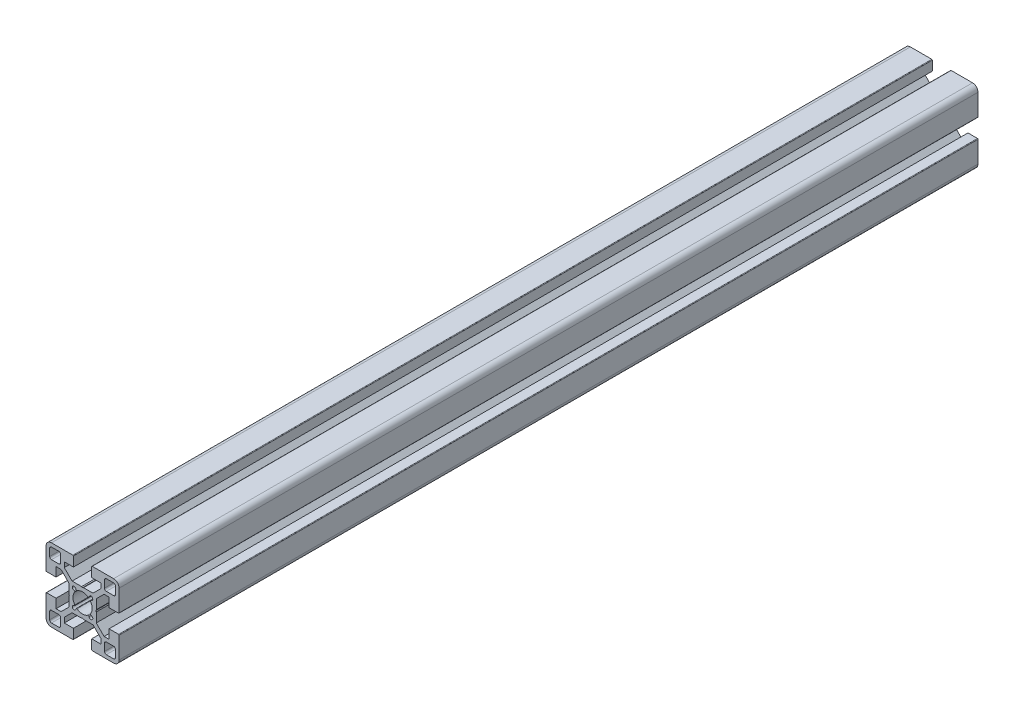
ISO-10303-21;
HEADER;
FILE_DESCRIPTION(('STEP AP214'),'2;1');
FILE_NAME('part.step','',(''),(''),'','','');
FILE_SCHEMA(('AUTOMOTIVE_DESIGN { 1 0 10303 214 1 1 1 1 }'));
ENDSEC;
DATA;
#1=APPLICATION_CONTEXT('core data for automotive mechanical design processes');
#2=APPLICATION_PROTOCOL_DEFINITION('international standard','automotive_design',2000,#1);
#3=PRODUCT_CONTEXT('',#1,'mechanical');
#4=PRODUCT('Part','Part','',(#3));
#5=PRODUCT_RELATED_PRODUCT_CATEGORY('part','',(#4));
#6=PRODUCT_DEFINITION_FORMATION('','',#4);
#7=PRODUCT_DEFINITION_CONTEXT('part definition',#1,'design');
#8=PRODUCT_DEFINITION('design','',#6,#7);
#9=PRODUCT_DEFINITION_SHAPE('','',#8);
#10=(LENGTH_UNIT() NAMED_UNIT(*) SI_UNIT(.MILLI.,.METRE.));
#11=(NAMED_UNIT(*) PLANE_ANGLE_UNIT() SI_UNIT($,.RADIAN.));
#12=(NAMED_UNIT(*) SI_UNIT($,.STERADIAN.) SOLID_ANGLE_UNIT());
#13=UNCERTAINTY_MEASURE_WITH_UNIT(LENGTH_MEASURE(1.E-05),#10,'distance_accuracy_value','');
#14=(GEOMETRIC_REPRESENTATION_CONTEXT(3) GLOBAL_UNCERTAINTY_ASSIGNED_CONTEXT((#13)) GLOBAL_UNIT_ASSIGNED_CONTEXT((#10,
#11,#12)) REPRESENTATION_CONTEXT('',''));
#15=CARTESIAN_POINT('',(0.,0.,0.));
#16=DIRECTION('',(0.,0.,1.));
#17=DIRECTION('',(1.,0.,0.));
#18=AXIS2_PLACEMENT_3D('',#15,#16,#17);
#19=CARTESIAN_POINT('',(-17.,17.,-470.));
#20=DIRECTION('',(0.,0.,1.));
#21=DIRECTION('',(1.,0.,0.));
#22=AXIS2_PLACEMENT_3D('',#19,#20,#21);
#23=CYLINDRICAL_SURFACE('',#22,3.);
#24=CARTESIAN_POINT('',(-17.,17.,0.));
#25=DIRECTION('',(0.,0.,1.));
#26=DIRECTION('',(1.,0.,0.));
#27=AXIS2_PLACEMENT_3D('',#24,#25,#26);
#28=CIRCLE('',#27,3.);
#29=CARTESIAN_POINT('',(-17.,20.,0.));
#30=VERTEX_POINT('',#29);
#31=CARTESIAN_POINT('',(-20.,17.,0.));
#32=VERTEX_POINT('',#31);
#33=EDGE_CURVE('E1103',#30,#32,#28,.T.);
#34=ORIENTED_EDGE('',*,*,#33,.F.);
#35=DIRECTION('',(0.,0.,1.));
#36=VECTOR('',#35,1.);
#37=CARTESIAN_POINT('',(-17.,20.,-470.));
#38=LINE('',#37,#36);
#39=CARTESIAN_POINT('',(-17.,20.,-470.));
#40=VERTEX_POINT('',#39);
#41=EDGE_CURVE('E11',#40,#30,#38,.T.);
#42=ORIENTED_EDGE('',*,*,#41,.F.);
#43=CARTESIAN_POINT('',(-17.,17.,-470.));
#44=DIRECTION('',(0.,0.,1.));
#45=DIRECTION('',(1.,0.,0.));
#46=AXIS2_PLACEMENT_3D('',#43,#44,#45);
#47=CIRCLE('',#46,3.);
#48=CARTESIAN_POINT('',(-20.,17.,-470.));
#49=VERTEX_POINT('',#48);
#50=EDGE_CURVE('E1118',#40,#49,#47,.T.);
#51=ORIENTED_EDGE('',*,*,#50,.T.);
#52=DIRECTION('',(0.,0.,1.));
#53=VECTOR('',#52,1.);
#54=CARTESIAN_POINT('',(-20.,17.,-470.));
#55=LINE('',#54,#53);
#56=EDGE_CURVE('E19',#49,#32,#55,.T.);
#57=ORIENTED_EDGE('',*,*,#56,.T.);
#58=EDGE_LOOP('',(#34,#42,#51,#57));
#59=FACE_BOUND('',#58,.T.);
#60=ADVANCED_FACE('F16',(#59),#23,.T.);
#61=CARTESIAN_POINT('',(-5.30000000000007,20.,-470.));
#62=DIRECTION('',(0.,1.,0.));
#63=DIRECTION('',(0.,0.,1.));
#64=AXIS2_PLACEMENT_3D('',#61,#62,#63);
#65=PLANE('',#64);
#66=DIRECTION('',(-1.,0.,0.));
#67=VECTOR('',#66,1.);
#68=CARTESIAN_POINT('',(-5.30000000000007,20.,0.));
#69=LINE('',#68,#67);
#70=CARTESIAN_POINT('',(-5.30000000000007,20.,0.));
#71=VERTEX_POINT('',#70);
#72=EDGE_CURVE('E1122',#71,#30,#69,.T.);
#73=ORIENTED_EDGE('',*,*,#72,.F.);
#74=DIRECTION('',(0.,0.,1.));
#75=VECTOR('',#74,1.);
#76=CARTESIAN_POINT('',(-5.30000000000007,20.,-470.));
#77=LINE('',#76,#75);
#78=CARTESIAN_POINT('',(-5.30000000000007,20.,-470.));
#79=VERTEX_POINT('',#78);
#80=EDGE_CURVE('E24',#79,#71,#77,.T.);
#81=ORIENTED_EDGE('',*,*,#80,.F.);
#82=DIRECTION('',(-1.,0.,0.));
#83=VECTOR('',#82,1.);
#84=CARTESIAN_POINT('',(-5.30000000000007,20.,-470.));
#85=LINE('',#84,#83);
#86=EDGE_CURVE('E1320',#79,#40,#85,.T.);
#87=ORIENTED_EDGE('',*,*,#86,.T.);
#88=ORIENTED_EDGE('',*,*,#41,.T.);
#89=EDGE_LOOP('',(#73,#81,#87,#88));
#90=FACE_BOUND('',#89,.T.);
#91=ADVANCED_FACE('F1667',(#90),#65,.T.);
#92=CARTESIAN_POINT('',(-5.30000000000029,19.6999999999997,-470.));
#93=DIRECTION('',(0.,0.,1.));
#94=DIRECTION('',(1.,0.,0.));
#95=AXIS2_PLACEMENT_3D('',#92,#93,#94);
#96=CYLINDRICAL_SURFACE('',#95,0.300000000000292);
#97=CARTESIAN_POINT('',(-5.30000000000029,19.6999999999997,0.));
#98=DIRECTION('',(0.,0.,1.));
#99=DIRECTION('',(1.,0.,0.));
#100=AXIS2_PLACEMENT_3D('',#97,#98,#99);
#101=CIRCLE('',#100,0.300000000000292);
#102=CARTESIAN_POINT('',(-5.,19.7,0.));
#103=VERTEX_POINT('',#102);
#104=EDGE_CURVE('E1520',#103,#71,#101,.T.);
#105=ORIENTED_EDGE('',*,*,#104,.F.);
#106=DIRECTION('',(0.,0.,1.));
#107=VECTOR('',#106,1.);
#108=CARTESIAN_POINT('',(-5.,19.7,-470.));
#109=LINE('',#108,#107);
#110=CARTESIAN_POINT('',(-5.,19.7,-470.));
#111=VERTEX_POINT('',#110);
#112=EDGE_CURVE('E1526',#111,#103,#109,.T.);
#113=ORIENTED_EDGE('',*,*,#112,.F.);
#114=CARTESIAN_POINT('',(-5.30000000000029,19.6999999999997,-470.));
#115=DIRECTION('',(0.,0.,1.));
#116=DIRECTION('',(1.,0.,0.));
#117=AXIS2_PLACEMENT_3D('',#114,#115,#116);
#118=CIRCLE('',#117,0.300000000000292);
#119=EDGE_CURVE('E1317',#111,#79,#118,.T.);
#120=ORIENTED_EDGE('',*,*,#119,.T.);
#121=ORIENTED_EDGE('',*,*,#80,.T.);
#122=EDGE_LOOP('',(#105,#113,#120,#121));
#123=FACE_BOUND('',#122,.T.);
#124=ADVANCED_FACE('F1927',(#123),#96,.T.);
#125=CARTESIAN_POINT('',(-5.,14.5,-470.));
#126=DIRECTION('',(1.,0.,0.));
#127=DIRECTION('',(0.,0.,-1.));
#128=AXIS2_PLACEMENT_3D('',#125,#126,#127);
#129=PLANE('',#128);
#130=DIRECTION('',(0.,1.,0.));
#131=VECTOR('',#130,1.);
#132=CARTESIAN_POINT('',(-5.,14.5,0.));
#133=LINE('',#132,#131);
#134=CARTESIAN_POINT('',(-5.,14.5,0.));
#135=VERTEX_POINT('',#134);
#136=EDGE_CURVE('E1517',#135,#103,#133,.T.);
#137=ORIENTED_EDGE('',*,*,#136,.F.);
#138=DIRECTION('',(0.,0.,1.));
#139=VECTOR('',#138,1.);
#140=CARTESIAN_POINT('',(-5.,14.5,-470.));
#141=LINE('',#140,#139);
#142=CARTESIAN_POINT('',(-5.,14.5,-470.));
#143=VERTEX_POINT('',#142);
#144=EDGE_CURVE('E1528',#143,#135,#141,.T.);
#145=ORIENTED_EDGE('',*,*,#144,.F.);
#146=DIRECTION('',(0.,1.,0.));
#147=VECTOR('',#146,1.);
#148=CARTESIAN_POINT('',(-5.,14.5,-470.));
#149=LINE('',#148,#147);
#150=EDGE_CURVE('E1314',#143,#111,#149,.T.);
#151=ORIENTED_EDGE('',*,*,#150,.T.);
#152=ORIENTED_EDGE('',*,*,#112,.T.);
#153=EDGE_LOOP('',(#137,#145,#151,#152));
#154=FACE_BOUND('',#153,.T.);
#155=ADVANCED_FACE('F1925',(#154),#129,.T.);
#156=CARTESIAN_POINT('',(-10.,14.5,-470.));
#157=DIRECTION('',(0.,-1.,0.));
#158=DIRECTION('',(0.,0.,-1.));
#159=AXIS2_PLACEMENT_3D('',#156,#157,#158);
#160=PLANE('',#159);
#161=DIRECTION('',(1.,0.,0.));
#162=VECTOR('',#161,1.);
#163=CARTESIAN_POINT('',(-10.,14.5,0.));
#164=LINE('',#163,#162);
#165=CARTESIAN_POINT('',(-10.,14.5,0.));
#166=VERTEX_POINT('',#165);
#167=EDGE_CURVE('E1514',#166,#135,#164,.T.);
#168=ORIENTED_EDGE('',*,*,#167,.F.);
#169=DIRECTION('',(0.,0.,1.));
#170=VECTOR('',#169,1.);
#171=CARTESIAN_POINT('',(-10.,14.5,-470.));
#172=LINE('',#171,#170);
#173=CARTESIAN_POINT('',(-10.,14.5,-470.));
#174=VERTEX_POINT('',#173);
#175=EDGE_CURVE('E1530',#174,#166,#172,.T.);
#176=ORIENTED_EDGE('',*,*,#175,.F.);
#177=DIRECTION('',(1.,0.,0.));
#178=VECTOR('',#177,1.);
#179=CARTESIAN_POINT('',(-10.,14.5,-470.));
#180=LINE('',#179,#178);
#181=EDGE_CURVE('E1311',#174,#143,#180,.T.);
#182=ORIENTED_EDGE('',*,*,#181,.T.);
#183=ORIENTED_EDGE('',*,*,#144,.T.);
#184=EDGE_LOOP('',(#168,#176,#182,#183));
#185=FACE_BOUND('',#184,.T.);
#186=ADVANCED_FACE('F1921',(#185),#160,.T.);
#187=CARTESIAN_POINT('',(-10.,11.7677860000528,-470.));
#188=DIRECTION('',(1.,0.,0.));
#189=DIRECTION('',(0.,0.,-1.));
#190=AXIS2_PLACEMENT_3D('',#187,#188,#189);
#191=PLANE('',#190);
#192=DIRECTION('',(0.,1.,0.));
#193=VECTOR('',#192,1.);
#194=CARTESIAN_POINT('',(-10.,11.7677860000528,0.));
#195=LINE('',#194,#193);
#196=CARTESIAN_POINT('',(-10.,11.7677860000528,0.));
#197=VERTEX_POINT('',#196);
#198=EDGE_CURVE('E1511',#197,#166,#195,.T.);
#199=ORIENTED_EDGE('',*,*,#198,.F.);
#200=DIRECTION('',(0.,0.,1.));
#201=VECTOR('',#200,1.);
#202=CARTESIAN_POINT('',(-10.,11.7677860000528,-470.));
#203=LINE('',#202,#201);
#204=CARTESIAN_POINT('',(-10.,11.7677860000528,-470.));
#205=VERTEX_POINT('',#204);
#206=EDGE_CURVE('E1532',#205,#197,#203,.T.);
#207=ORIENTED_EDGE('',*,*,#206,.F.);
#208=DIRECTION('',(0.,1.,0.));
#209=VECTOR('',#208,1.);
#210=CARTESIAN_POINT('',(-10.,11.7677860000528,-470.));
#211=LINE('',#210,#209);
#212=EDGE_CURVE('E1308',#205,#174,#211,.T.);
#213=ORIENTED_EDGE('',*,*,#212,.T.);
#214=ORIENTED_EDGE('',*,*,#175,.T.);
#215=EDGE_LOOP('',(#199,#207,#213,#214));
#216=FACE_BOUND('',#215,.T.);
#217=ADVANCED_FACE('F1917',(#216),#191,.T.);
#218=CARTESIAN_POINT('',(-5.73222900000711,7.5,-470.));
#219=DIRECTION('',(0.707108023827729,0.707105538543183,0.));
#220=DIRECTION('',(-0.707105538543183,0.707108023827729,0.));
#221=AXIS2_PLACEMENT_3D('',#218,#219,#220);
#222=PLANE('',#221);
#223=DIRECTION('',(-0.707105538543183,0.707108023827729,0.));
#224=VECTOR('',#223,1.);
#225=CARTESIAN_POINT('',(-5.73222900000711,7.5,0.));
#226=LINE('',#225,#224);
#227=CARTESIAN_POINT('',(-5.73222900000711,7.5,0.));
#228=VERTEX_POINT('',#227);
#229=EDGE_CURVE('E1508',#228,#197,#226,.T.);
#230=ORIENTED_EDGE('',*,*,#229,.F.);
#231=DIRECTION('',(0.,0.,1.));
#232=VECTOR('',#231,1.);
#233=CARTESIAN_POINT('',(-5.73222900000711,7.5,-470.));
#234=LINE('',#233,#232);
#235=CARTESIAN_POINT('',(-5.73222900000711,7.5,-470.));
#236=VERTEX_POINT('',#235);
#237=EDGE_CURVE('E1534',#236,#228,#234,.T.);
#238=ORIENTED_EDGE('',*,*,#237,.F.);
#239=DIRECTION('',(-0.707105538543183,0.707108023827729,0.));
#240=VECTOR('',#239,1.);
#241=CARTESIAN_POINT('',(-5.73222900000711,7.5,-470.));
#242=LINE('',#241,#240);
#243=EDGE_CURVE('E1305',#236,#205,#242,.T.);
#244=ORIENTED_EDGE('',*,*,#243,.T.);
#245=ORIENTED_EDGE('',*,*,#206,.T.);
#246=EDGE_LOOP('',(#230,#238,#244,#245));
#247=FACE_BOUND('',#246,.T.);
#248=ADVANCED_FACE('F1913',(#247),#222,.T.);
#249=CARTESIAN_POINT('',(-0.519615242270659,7.5,-470.));
#250=DIRECTION('',(0.,1.,0.));
#251=DIRECTION('',(-1.,0.,0.));
#252=AXIS2_PLACEMENT_3D('',#249,#250,#251);
#253=PLANE('',#252);
#254=DIRECTION('',(-1.,0.,0.));
#255=VECTOR('',#254,1.);
#256=CARTESIAN_POINT('',(-0.519615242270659,7.5,0.));
#257=LINE('',#256,#255);
#258=CARTESIAN_POINT('',(-0.519615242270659,7.5,0.));
#259=VERTEX_POINT('',#258);
#260=EDGE_CURVE('E1505',#259,#228,#257,.T.);
#261=ORIENTED_EDGE('',*,*,#260,.F.);
#262=DIRECTION('',(0.,0.,1.));
#263=VECTOR('',#262,1.);
#264=CARTESIAN_POINT('',(-0.519615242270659,7.5,-470.));
#265=LINE('',#264,#263);
#266=CARTESIAN_POINT('',(-0.519615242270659,7.5,-470.));
#267=VERTEX_POINT('',#266);
#268=EDGE_CURVE('E1536',#267,#259,#265,.T.);
#269=ORIENTED_EDGE('',*,*,#268,.F.);
#270=DIRECTION('',(-1.,0.,0.));
#271=VECTOR('',#270,1.);
#272=CARTESIAN_POINT('',(-0.519615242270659,7.5,-470.));
#273=LINE('',#272,#271);
#274=EDGE_CURVE('E1302',#267,#236,#273,.T.);
#275=ORIENTED_EDGE('',*,*,#274,.T.);
#276=ORIENTED_EDGE('',*,*,#237,.T.);
#277=EDGE_LOOP('',(#261,#269,#275,#276));
#278=FACE_BOUND('',#277,.T.);
#279=ADVANCED_FACE('F1909',(#278),#253,.T.);
#280=CARTESIAN_POINT('',(0.,7.2,-470.));
#281=DIRECTION('',(0.499999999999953,0.866025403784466,0.));
#282=DIRECTION('',(-0.866025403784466,0.499999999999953,0.));
#283=AXIS2_PLACEMENT_3D('',#280,#281,#282);
#284=PLANE('',#283);
#285=DIRECTION('',(-0.866025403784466,0.499999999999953,0.));
#286=VECTOR('',#285,1.);
#287=CARTESIAN_POINT('',(0.,7.2,0.));
#288=LINE('',#287,#286);
#289=CARTESIAN_POINT('',(0.,7.2,0.));
#290=VERTEX_POINT('',#289);
#291=EDGE_CURVE('E1502',#290,#259,#288,.T.);
#292=ORIENTED_EDGE('',*,*,#291,.F.);
#293=DIRECTION('',(0.,0.,1.));
#294=VECTOR('',#293,1.);
#295=CARTESIAN_POINT('',(0.,7.2,-470.));
#296=LINE('',#295,#294);
#297=CARTESIAN_POINT('',(0.,7.2,-470.));
#298=VERTEX_POINT('',#297);
#299=EDGE_CURVE('E1538',#298,#290,#296,.T.);
#300=ORIENTED_EDGE('',*,*,#299,.F.);
#301=DIRECTION('',(-0.866025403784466,0.499999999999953,0.));
#302=VECTOR('',#301,1.);
#303=CARTESIAN_POINT('',(0.,7.2,-470.));
#304=LINE('',#303,#302);
#305=EDGE_CURVE('E1299',#298,#267,#304,.T.);
#306=ORIENTED_EDGE('',*,*,#305,.T.);
#307=ORIENTED_EDGE('',*,*,#268,.T.);
#308=EDGE_LOOP('',(#292,#300,#306,#307));
#309=FACE_BOUND('',#308,.T.);
#310=ADVANCED_FACE('F1905',(#309),#284,.T.);
#311=CARTESIAN_POINT('',(0.51961524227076,7.5,-470.));
#312=DIRECTION('',(-0.499999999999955,0.866025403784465,0.));
#313=DIRECTION('',(-0.866025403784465,-0.499999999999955,0.));
#314=AXIS2_PLACEMENT_3D('',#311,#312,#313);
#315=PLANE('',#314);
#316=DIRECTION('',(-0.866025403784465,-0.499999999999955,0.));
#317=VECTOR('',#316,1.);
#318=CARTESIAN_POINT('',(0.51961524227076,7.5,0.));
#319=LINE('',#318,#317);
#320=CARTESIAN_POINT('',(0.51961524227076,7.5,0.));
#321=VERTEX_POINT('',#320);
#322=EDGE_CURVE('E1499',#321,#290,#319,.T.);
#323=ORIENTED_EDGE('',*,*,#322,.F.);
#324=DIRECTION('',(0.,0.,1.));
#325=VECTOR('',#324,1.);
#326=CARTESIAN_POINT('',(0.51961524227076,7.5,-470.));
#327=LINE('',#326,#325);
#328=CARTESIAN_POINT('',(0.51961524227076,7.5,-470.));
#329=VERTEX_POINT('',#328);
#330=EDGE_CURVE('E1540',#329,#321,#327,.T.);
#331=ORIENTED_EDGE('',*,*,#330,.F.);
#332=DIRECTION('',(-0.866025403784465,-0.499999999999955,0.));
#333=VECTOR('',#332,1.);
#334=CARTESIAN_POINT('',(0.51961524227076,7.5,-470.));
#335=LINE('',#334,#333);
#336=EDGE_CURVE('E1296',#329,#298,#335,.T.);
#337=ORIENTED_EDGE('',*,*,#336,.T.);
#338=ORIENTED_EDGE('',*,*,#299,.T.);
#339=EDGE_LOOP('',(#323,#331,#337,#338));
#340=FACE_BOUND('',#339,.T.);
#341=ADVANCED_FACE('F1901',(#340),#315,.T.);
#342=CARTESIAN_POINT('',(5.73223699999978,7.5,-470.));
#343=DIRECTION('',(0.,1.,0.));
#344=DIRECTION('',(-1.,0.,0.));
#345=AXIS2_PLACEMENT_3D('',#342,#343,#344);
#346=PLANE('',#345);
#347=DIRECTION('',(-1.,0.,0.));
#348=VECTOR('',#347,1.);
#349=CARTESIAN_POINT('',(5.73223699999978,7.5,0.));
#350=LINE('',#349,#348);
#351=CARTESIAN_POINT('',(5.73223699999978,7.5,0.));
#352=VERTEX_POINT('',#351);
#353=EDGE_CURVE('E1496',#352,#321,#350,.T.);
#354=ORIENTED_EDGE('',*,*,#353,.F.);
#355=DIRECTION('',(0.,0.,1.));
#356=VECTOR('',#355,1.);
#357=CARTESIAN_POINT('',(5.73223699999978,7.5,-470.));
#358=LINE('',#357,#356);
#359=CARTESIAN_POINT('',(5.73223699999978,7.5,-470.));
#360=VERTEX_POINT('',#359);
#361=EDGE_CURVE('E1542',#360,#352,#358,.T.);
#362=ORIENTED_EDGE('',*,*,#361,.F.);
#363=DIRECTION('',(-1.,0.,0.));
#364=VECTOR('',#363,1.);
#365=CARTESIAN_POINT('',(5.73223699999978,7.5,-470.));
#366=LINE('',#365,#364);
#367=EDGE_CURVE('E1293',#360,#329,#366,.T.);
#368=ORIENTED_EDGE('',*,*,#367,.T.);
#369=ORIENTED_EDGE('',*,*,#330,.T.);
#370=EDGE_LOOP('',(#354,#362,#368,#369));
#371=FACE_BOUND('',#370,.T.);
#372=ADVANCED_FACE('F1897',(#371),#346,.T.);
#373=CARTESIAN_POINT('',(9.99999999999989,11.7677629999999,-470.));
#374=DIRECTION('',(-0.707106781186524,0.707106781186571,0.));
#375=DIRECTION('',(-0.707106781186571,-0.707106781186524,0.));
#376=AXIS2_PLACEMENT_3D('',#373,#374,#375);
#377=PLANE('',#376);
#378=DIRECTION('',(-0.707106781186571,-0.707106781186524,0.));
#379=VECTOR('',#378,1.);
#380=CARTESIAN_POINT('',(9.99999999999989,11.7677629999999,0.));
#381=LINE('',#380,#379);
#382=CARTESIAN_POINT('',(9.99999999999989,11.7677629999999,0.));
#383=VERTEX_POINT('',#382);
#384=EDGE_CURVE('E1493',#383,#352,#381,.T.);
#385=ORIENTED_EDGE('',*,*,#384,.F.);
#386=DIRECTION('',(0.,0.,1.));
#387=VECTOR('',#386,1.);
#388=CARTESIAN_POINT('',(9.99999999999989,11.7677629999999,-470.));
#389=LINE('',#388,#387);
#390=CARTESIAN_POINT('',(9.99999999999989,11.7677629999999,-470.));
#391=VERTEX_POINT('',#390);
#392=EDGE_CURVE('E1544',#391,#383,#389,.T.);
#393=ORIENTED_EDGE('',*,*,#392,.F.);
#394=DIRECTION('',(-0.707106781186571,-0.707106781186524,0.));
#395=VECTOR('',#394,1.);
#396=CARTESIAN_POINT('',(9.99999999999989,11.7677629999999,-470.));
#397=LINE('',#396,#395);
#398=EDGE_CURVE('E1290',#391,#360,#397,.T.);
#399=ORIENTED_EDGE('',*,*,#398,.T.);
#400=ORIENTED_EDGE('',*,*,#361,.T.);
#401=EDGE_LOOP('',(#385,#393,#399,#400));
#402=FACE_BOUND('',#401,.T.);
#403=ADVANCED_FACE('F1893',(#402),#377,.T.);
#404=CARTESIAN_POINT('',(9.99999999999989,14.5,-470.));
#405=DIRECTION('',(-1.,0.,0.));
#406=DIRECTION('',(0.,0.,1.));
#407=AXIS2_PLACEMENT_3D('',#404,#405,#406);
#408=PLANE('',#407);
#409=DIRECTION('',(0.,-1.,0.));
#410=VECTOR('',#409,1.);
#411=CARTESIAN_POINT('',(9.99999999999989,14.5,0.));
#412=LINE('',#411,#410);
#413=CARTESIAN_POINT('',(9.99999999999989,14.5,0.));
#414=VERTEX_POINT('',#413);
#415=EDGE_CURVE('E1490',#414,#383,#412,.T.);
#416=ORIENTED_EDGE('',*,*,#415,.F.);
#417=DIRECTION('',(0.,0.,1.));
#418=VECTOR('',#417,1.);
#419=CARTESIAN_POINT('',(9.99999999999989,14.5,-470.));
#420=LINE('',#419,#418);
#421=CARTESIAN_POINT('',(9.99999999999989,14.5,-470.));
#422=VERTEX_POINT('',#421);
#423=EDGE_CURVE('E1546',#422,#414,#420,.T.);
#424=ORIENTED_EDGE('',*,*,#423,.F.);
#425=DIRECTION('',(0.,-1.,0.));
#426=VECTOR('',#425,1.);
#427=CARTESIAN_POINT('',(9.99999999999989,14.5,-470.));
#428=LINE('',#427,#426);
#429=EDGE_CURVE('E1287',#422,#391,#428,.T.);
#430=ORIENTED_EDGE('',*,*,#429,.T.);
#431=ORIENTED_EDGE('',*,*,#392,.T.);
#432=EDGE_LOOP('',(#416,#424,#430,#431));
#433=FACE_BOUND('',#432,.T.);
#434=ADVANCED_FACE('F1889',(#433),#408,.T.);
#435=CARTESIAN_POINT('',(5.,14.5,-470.));
#436=DIRECTION('',(0.,-1.,0.));
#437=DIRECTION('',(0.,0.,-1.));
#438=AXIS2_PLACEMENT_3D('',#435,#436,#437);
#439=PLANE('',#438);
#440=DIRECTION('',(1.,0.,0.));
#441=VECTOR('',#440,1.);
#442=CARTESIAN_POINT('',(5.,14.5,0.));
#443=LINE('',#442,#441);
#444=CARTESIAN_POINT('',(5.,14.5,0.));
#445=VERTEX_POINT('',#444);
#446=EDGE_CURVE('E1487',#445,#414,#443,.T.);
#447=ORIENTED_EDGE('',*,*,#446,.F.);
#448=DIRECTION('',(0.,0.,1.));
#449=VECTOR('',#448,1.);
#450=CARTESIAN_POINT('',(5.,14.5,-470.));
#451=LINE('',#450,#449);
#452=CARTESIAN_POINT('',(5.,14.5,-470.));
#453=VERTEX_POINT('',#452);
#454=EDGE_CURVE('E1548',#453,#445,#451,.T.);
#455=ORIENTED_EDGE('',*,*,#454,.F.);
#456=DIRECTION('',(1.,0.,0.));
#457=VECTOR('',#456,1.);
#458=CARTESIAN_POINT('',(5.,14.5,-470.));
#459=LINE('',#458,#457);
#460=EDGE_CURVE('E1284',#453,#422,#459,.T.);
#461=ORIENTED_EDGE('',*,*,#460,.T.);
#462=ORIENTED_EDGE('',*,*,#423,.T.);
#463=EDGE_LOOP('',(#447,#455,#461,#462));
#464=FACE_BOUND('',#463,.T.);
#465=ADVANCED_FACE('F1885',(#464),#439,.T.);
#466=CARTESIAN_POINT('',(5.,19.7,-470.));
#467=DIRECTION('',(-1.,0.,0.));
#468=DIRECTION('',(0.,0.,1.));
#469=AXIS2_PLACEMENT_3D('',#466,#467,#468);
#470=PLANE('',#469);
#471=DIRECTION('',(0.,-1.,0.));
#472=VECTOR('',#471,1.);
#473=CARTESIAN_POINT('',(5.,19.7,0.));
#474=LINE('',#473,#472);
#475=CARTESIAN_POINT('',(5.,19.7,0.));
#476=VERTEX_POINT('',#475);
#477=EDGE_CURVE('E1484',#476,#445,#474,.T.);
#478=ORIENTED_EDGE('',*,*,#477,.F.);
#479=DIRECTION('',(0.,0.,1.));
#480=VECTOR('',#479,1.);
#481=CARTESIAN_POINT('',(5.,19.7,-470.));
#482=LINE('',#481,#480);
#483=CARTESIAN_POINT('',(5.,19.7,-470.));
#484=VERTEX_POINT('',#483);
#485=EDGE_CURVE('E1550',#484,#476,#482,.T.);
#486=ORIENTED_EDGE('',*,*,#485,.F.);
#487=DIRECTION('',(0.,-1.,0.));
#488=VECTOR('',#487,1.);
#489=CARTESIAN_POINT('',(5.,19.7,-470.));
#490=LINE('',#489,#488);
#491=EDGE_CURVE('E1281',#484,#453,#490,.T.);
#492=ORIENTED_EDGE('',*,*,#491,.T.);
#493=ORIENTED_EDGE('',*,*,#454,.T.);
#494=EDGE_LOOP('',(#478,#486,#492,#493));
#495=FACE_BOUND('',#494,.T.);
#496=ADVANCED_FACE('F1881',(#495),#470,.T.);
#497=CARTESIAN_POINT('',(5.30000000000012,19.7,-470.));
#498=DIRECTION('',(0.,0.,1.));
#499=DIRECTION('',(1.,0.,0.));
#500=AXIS2_PLACEMENT_3D('',#497,#498,#499);
#501=CYLINDRICAL_SURFACE('',#500,0.300000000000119);
#502=CARTESIAN_POINT('',(5.30000000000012,19.7,0.));
#503=DIRECTION('',(0.,0.,1.));
#504=DIRECTION('',(1.,0.,0.));
#505=AXIS2_PLACEMENT_3D('',#502,#503,#504);
#506=CIRCLE('',#505,0.300000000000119);
#507=CARTESIAN_POINT('',(5.3,20.,0.));
#508=VERTEX_POINT('',#507);
#509=EDGE_CURVE('E1481',#508,#476,#506,.T.);
#510=ORIENTED_EDGE('',*,*,#509,.F.);
#511=DIRECTION('',(0.,0.,1.));
#512=VECTOR('',#511,1.);
#513=CARTESIAN_POINT('',(5.3,20.,-470.));
#514=LINE('',#513,#512);
#515=CARTESIAN_POINT('',(5.3,20.,-470.));
#516=VERTEX_POINT('',#515);
#517=EDGE_CURVE('E1552',#516,#508,#514,.T.);
#518=ORIENTED_EDGE('',*,*,#517,.F.);
#519=CARTESIAN_POINT('',(5.30000000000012,19.7,-470.));
#520=DIRECTION('',(0.,0.,1.));
#521=DIRECTION('',(1.,0.,0.));
#522=AXIS2_PLACEMENT_3D('',#519,#520,#521);
#523=CIRCLE('',#522,0.300000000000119);
#524=EDGE_CURVE('E1278',#516,#484,#523,.T.);
#525=ORIENTED_EDGE('',*,*,#524,.T.);
#526=ORIENTED_EDGE('',*,*,#485,.T.);
#527=EDGE_LOOP('',(#510,#518,#525,#526));
#528=FACE_BOUND('',#527,.T.);
#529=ADVANCED_FACE('F1877',(#528),#501,.T.);
#530=CARTESIAN_POINT('',(17.,20.,-470.));
#531=DIRECTION('',(0.,1.,0.));
#532=DIRECTION('',(0.,0.,1.));
#533=AXIS2_PLACEMENT_3D('',#530,#531,#532);
#534=PLANE('',#533);
#535=DIRECTION('',(-1.,0.,0.));
#536=VECTOR('',#535,1.);
#537=CARTESIAN_POINT('',(17.,20.,0.));
#538=LINE('',#537,#536);
#539=CARTESIAN_POINT('',(17.,20.,0.));
#540=VERTEX_POINT('',#539);
#541=EDGE_CURVE('E1478',#540,#508,#538,.T.);
#542=ORIENTED_EDGE('',*,*,#541,.F.);
#543=DIRECTION('',(0.,0.,1.));
#544=VECTOR('',#543,1.);
#545=CARTESIAN_POINT('',(17.,20.,-470.));
#546=LINE('',#545,#544);
#547=CARTESIAN_POINT('',(17.,20.,-470.));
#548=VERTEX_POINT('',#547);
#549=EDGE_CURVE('E1554',#548,#540,#546,.T.);
#550=ORIENTED_EDGE('',*,*,#549,.F.);
#551=DIRECTION('',(-1.,0.,0.));
#552=VECTOR('',#551,1.);
#553=CARTESIAN_POINT('',(17.,20.,-470.));
#554=LINE('',#553,#552);
#555=EDGE_CURVE('E1275',#548,#516,#554,.T.);
#556=ORIENTED_EDGE('',*,*,#555,.T.);
#557=ORIENTED_EDGE('',*,*,#517,.T.);
#558=EDGE_LOOP('',(#542,#550,#556,#557));
#559=FACE_BOUND('',#558,.T.);
#560=ADVANCED_FACE('F1873',(#559),#534,.T.);
#561=CARTESIAN_POINT('',(17.,17.,-470.));
#562=DIRECTION('',(0.,0.,1.));
#563=DIRECTION('',(1.,0.,0.));
#564=AXIS2_PLACEMENT_3D('',#561,#562,#563);
#565=CYLINDRICAL_SURFACE('',#564,2.99999999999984);
#566=CARTESIAN_POINT('',(17.,17.,0.));
#567=DIRECTION('',(0.,0.,1.));
#568=DIRECTION('',(1.,0.,0.));
#569=AXIS2_PLACEMENT_3D('',#566,#567,#568);
#570=CIRCLE('',#569,2.99999999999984);
#571=CARTESIAN_POINT('',(20.,17.,0.));
#572=VERTEX_POINT('',#571);
#573=EDGE_CURVE('E1475',#572,#540,#570,.T.);
#574=ORIENTED_EDGE('',*,*,#573,.F.);
#575=DIRECTION('',(0.,0.,1.));
#576=VECTOR('',#575,1.);
#577=CARTESIAN_POINT('',(20.,17.,-470.));
#578=LINE('',#577,#576);
#579=CARTESIAN_POINT('',(20.,17.,-470.));
#580=VERTEX_POINT('',#579);
#581=EDGE_CURVE('E1556',#580,#572,#578,.T.);
#582=ORIENTED_EDGE('',*,*,#581,.F.);
#583=CARTESIAN_POINT('',(17.,17.,-470.));
#584=DIRECTION('',(0.,0.,1.));
#585=DIRECTION('',(1.,0.,0.));
#586=AXIS2_PLACEMENT_3D('',#583,#584,#585);
#587=CIRCLE('',#586,2.99999999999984);
#588=EDGE_CURVE('E1272',#580,#548,#587,.T.);
#589=ORIENTED_EDGE('',*,*,#588,.T.);
#590=ORIENTED_EDGE('',*,*,#549,.T.);
#591=EDGE_LOOP('',(#574,#582,#589,#590));
#592=FACE_BOUND('',#591,.T.);
#593=ADVANCED_FACE('F1869',(#592),#565,.T.);
#594=CARTESIAN_POINT('',(20.,5.30000300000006,-470.));
#595=DIRECTION('',(1.,0.,0.));
#596=DIRECTION('',(0.,0.,-1.));
#597=AXIS2_PLACEMENT_3D('',#594,#595,#596);
#598=PLANE('',#597);
#599=DIRECTION('',(0.,1.,0.));
#600=VECTOR('',#599,1.);
#601=CARTESIAN_POINT('',(20.,5.30000300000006,0.));
#602=LINE('',#601,#600);
#603=CARTESIAN_POINT('',(20.,5.30000300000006,0.));
#604=VERTEX_POINT('',#603);
#605=EDGE_CURVE('E1472',#604,#572,#602,.T.);
#606=ORIENTED_EDGE('',*,*,#605,.F.);
#607=DIRECTION('',(0.,0.,1.));
#608=VECTOR('',#607,1.);
#609=CARTESIAN_POINT('',(20.,5.30000300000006,-470.));
#610=LINE('',#609,#608);
#611=CARTESIAN_POINT('',(20.,5.30000300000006,-470.));
#612=VERTEX_POINT('',#611);
#613=EDGE_CURVE('E1558',#612,#604,#610,.T.);
#614=ORIENTED_EDGE('',*,*,#613,.F.);
#615=DIRECTION('',(0.,1.,0.));
#616=VECTOR('',#615,1.);
#617=CARTESIAN_POINT('',(20.,5.30000300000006,-470.));
#618=LINE('',#617,#616);
#619=EDGE_CURVE('E1269',#612,#580,#618,.T.);
#620=ORIENTED_EDGE('',*,*,#619,.T.);
#621=ORIENTED_EDGE('',*,*,#581,.T.);
#622=EDGE_LOOP('',(#606,#614,#620,#621));
#623=FACE_BOUND('',#622,.T.);
#624=ADVANCED_FACE('F1865',(#623),#598,.T.);
#625=CARTESIAN_POINT('',(19.699989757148,5.30001024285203,-470.));
#626=DIRECTION('',(0.,0.,1.));
#627=DIRECTION('',(1.,0.,0.));
#628=AXIS2_PLACEMENT_3D('',#625,#626,#627);
#629=CYLINDRICAL_SURFACE('',#628,0.300010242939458);
#630=CARTESIAN_POINT('',(19.699989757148,5.30001024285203,0.));
#631=DIRECTION('',(0.,0.,1.));
#632=DIRECTION('',(1.,0.,0.));
#633=AXIS2_PLACEMENT_3D('',#630,#631,#632);
#634=CIRCLE('',#633,0.300010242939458);
#635=CARTESIAN_POINT('',(19.6999969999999,5.,0.));
#636=VERTEX_POINT('',#635);
#637=EDGE_CURVE('E1469',#636,#604,#634,.T.);
#638=ORIENTED_EDGE('',*,*,#637,.F.);
#639=DIRECTION('',(0.,0.,1.));
#640=VECTOR('',#639,1.);
#641=CARTESIAN_POINT('',(19.6999969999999,5.,-470.));
#642=LINE('',#641,#640);
#643=CARTESIAN_POINT('',(19.6999969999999,5.,-470.));
#644=VERTEX_POINT('',#643);
#645=EDGE_CURVE('E1560',#644,#636,#642,.T.);
#646=ORIENTED_EDGE('',*,*,#645,.F.);
#647=CARTESIAN_POINT('',(19.699989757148,5.30001024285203,-470.));
#648=DIRECTION('',(0.,0.,1.));
#649=DIRECTION('',(1.,0.,0.));
#650=AXIS2_PLACEMENT_3D('',#647,#648,#649);
#651=CIRCLE('',#650,0.300010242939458);
#652=EDGE_CURVE('E1266',#644,#612,#651,.T.);
#653=ORIENTED_EDGE('',*,*,#652,.T.);
#654=ORIENTED_EDGE('',*,*,#613,.T.);
#655=EDGE_LOOP('',(#638,#646,#653,#654));
#656=FACE_BOUND('',#655,.T.);
#657=ADVANCED_FACE('F1861',(#656),#629,.T.);
#658=CARTESIAN_POINT('',(14.5,5.,-470.));
#659=DIRECTION('',(0.,-1.,0.));
#660=DIRECTION('',(0.,0.,-1.));
#661=AXIS2_PLACEMENT_3D('',#658,#659,#660);
#662=PLANE('',#661);
#663=DIRECTION('',(1.,0.,0.));
#664=VECTOR('',#663,1.);
#665=CARTESIAN_POINT('',(14.5,5.,0.));
#666=LINE('',#665,#664);
#667=CARTESIAN_POINT('',(14.5,5.,0.));
#668=VERTEX_POINT('',#667);
#669=EDGE_CURVE('E1466',#668,#636,#666,.T.);
#670=ORIENTED_EDGE('',*,*,#669,.F.);
#671=DIRECTION('',(0.,0.,1.));
#672=VECTOR('',#671,1.);
#673=CARTESIAN_POINT('',(14.5,5.,-470.));
#674=LINE('',#673,#672);
#675=CARTESIAN_POINT('',(14.5,5.,-470.));
#676=VERTEX_POINT('',#675);
#677=EDGE_CURVE('E1562',#676,#668,#674,.T.);
#678=ORIENTED_EDGE('',*,*,#677,.F.);
#679=DIRECTION('',(1.,0.,0.));
#680=VECTOR('',#679,1.);
#681=CARTESIAN_POINT('',(14.5,5.,-470.));
#682=LINE('',#681,#680);
#683=EDGE_CURVE('E1263',#676,#644,#682,.T.);
#684=ORIENTED_EDGE('',*,*,#683,.T.);
#685=ORIENTED_EDGE('',*,*,#645,.T.);
#686=EDGE_LOOP('',(#670,#678,#684,#685));
#687=FACE_BOUND('',#686,.T.);
#688=ADVANCED_FACE('F1857',(#687),#662,.T.);
#689=CARTESIAN_POINT('',(14.5,10.,-470.));
#690=DIRECTION('',(-1.,0.,0.));
#691=DIRECTION('',(0.,0.,1.));
#692=AXIS2_PLACEMENT_3D('',#689,#690,#691);
#693=PLANE('',#692);
#694=DIRECTION('',(0.,-1.,0.));
#695=VECTOR('',#694,1.);
#696=CARTESIAN_POINT('',(14.5,10.,0.));
#697=LINE('',#696,#695);
#698=CARTESIAN_POINT('',(14.5,10.,0.));
#699=VERTEX_POINT('',#698);
#700=EDGE_CURVE('E1463',#699,#668,#697,.T.);
#701=ORIENTED_EDGE('',*,*,#700,.F.);
#702=DIRECTION('',(0.,0.,1.));
#703=VECTOR('',#702,1.);
#704=CARTESIAN_POINT('',(14.5,10.,-470.));
#705=LINE('',#704,#703);
#706=CARTESIAN_POINT('',(14.5,10.,-470.));
#707=VERTEX_POINT('',#706);
#708=EDGE_CURVE('E1564',#707,#699,#705,.T.);
#709=ORIENTED_EDGE('',*,*,#708,.F.);
#710=DIRECTION('',(0.,-1.,0.));
#711=VECTOR('',#710,1.);
#712=CARTESIAN_POINT('',(14.5,10.,-470.));
#713=LINE('',#712,#711);
#714=EDGE_CURVE('E1260',#707,#676,#713,.T.);
#715=ORIENTED_EDGE('',*,*,#714,.T.);
#716=ORIENTED_EDGE('',*,*,#677,.T.);
#717=EDGE_LOOP('',(#701,#709,#715,#716));
#718=FACE_BOUND('',#717,.T.);
#719=ADVANCED_FACE('F1853',(#718),#693,.T.);
#720=CARTESIAN_POINT('',(11.7677769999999,10.,-470.));
#721=DIRECTION('',(0.,-1.,0.));
#722=DIRECTION('',(0.,0.,-1.));
#723=AXIS2_PLACEMENT_3D('',#720,#721,#722);
#724=PLANE('',#723);
#725=DIRECTION('',(1.,0.,0.));
#726=VECTOR('',#725,1.);
#727=CARTESIAN_POINT('',(11.7677769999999,10.,0.));
#728=LINE('',#727,#726);
#729=CARTESIAN_POINT('',(11.7677769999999,10.,0.));
#730=VERTEX_POINT('',#729);
#731=EDGE_CURVE('E1460',#730,#699,#728,.T.);
#732=ORIENTED_EDGE('',*,*,#731,.F.);
#733=DIRECTION('',(0.,0.,1.));
#734=VECTOR('',#733,1.);
#735=CARTESIAN_POINT('',(11.7677769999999,10.,-470.));
#736=LINE('',#735,#734);
#737=CARTESIAN_POINT('',(11.7677769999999,10.,-470.));
#738=VERTEX_POINT('',#737);
#739=EDGE_CURVE('E1566',#738,#730,#736,.T.);
#740=ORIENTED_EDGE('',*,*,#739,.F.);
#741=DIRECTION('',(1.,0.,0.));
#742=VECTOR('',#741,1.);
#743=CARTESIAN_POINT('',(11.7677769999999,10.,-470.));
#744=LINE('',#743,#742);
#745=EDGE_CURVE('E1257',#738,#707,#744,.T.);
#746=ORIENTED_EDGE('',*,*,#745,.T.);
#747=ORIENTED_EDGE('',*,*,#708,.T.);
#748=EDGE_LOOP('',(#732,#740,#746,#747));
#749=FACE_BOUND('',#748,.T.);
#750=ADVANCED_FACE('F1849',(#749),#724,.T.);
#751=CARTESIAN_POINT('',(7.49999999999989,5.7322310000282,-470.));
#752=DIRECTION('',(0.707106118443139,-0.707107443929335,0.));
#753=DIRECTION('',(0.707107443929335,0.707106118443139,0.));
#754=AXIS2_PLACEMENT_3D('',#751,#752,#753);
#755=PLANE('',#754);
#756=DIRECTION('',(0.707107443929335,0.707106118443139,0.));
#757=VECTOR('',#756,1.);
#758=CARTESIAN_POINT('',(7.49999999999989,5.7322310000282,0.));
#759=LINE('',#758,#757);
#760=CARTESIAN_POINT('',(7.49999999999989,5.7322310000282,0.));
#761=VERTEX_POINT('',#760);
#762=EDGE_CURVE('E1457',#761,#730,#759,.T.);
#763=ORIENTED_EDGE('',*,*,#762,.F.);
#764=DIRECTION('',(0.,0.,1.));
#765=VECTOR('',#764,1.);
#766=CARTESIAN_POINT('',(7.49999999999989,5.7322310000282,-470.));
#767=LINE('',#766,#765);
#768=CARTESIAN_POINT('',(7.49999999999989,5.7322310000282,-470.));
#769=VERTEX_POINT('',#768);
#770=EDGE_CURVE('E1568',#769,#761,#767,.T.);
#771=ORIENTED_EDGE('',*,*,#770,.F.);
#772=DIRECTION('',(0.707107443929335,0.707106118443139,0.));
#773=VECTOR('',#772,1.);
#774=CARTESIAN_POINT('',(7.49999999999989,5.7322310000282,-470.));
#775=LINE('',#774,#773);
#776=EDGE_CURVE('E1254',#769,#738,#775,.T.);
#777=ORIENTED_EDGE('',*,*,#776,.T.);
#778=ORIENTED_EDGE('',*,*,#739,.T.);
#779=EDGE_LOOP('',(#763,#771,#777,#778));
#780=FACE_BOUND('',#779,.T.);
#781=ADVANCED_FACE('F1845',(#780),#755,.T.);
#782=CARTESIAN_POINT('',(7.49999999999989,0.519615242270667,-470.));
#783=DIRECTION('',(1.,0.,0.));
#784=DIRECTION('',(0.,0.,-1.));
#785=AXIS2_PLACEMENT_3D('',#782,#783,#784);
#786=PLANE('',#785);
#787=DIRECTION('',(0.,1.,0.));
#788=VECTOR('',#787,1.);
#789=CARTESIAN_POINT('',(7.49999999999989,0.519615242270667,0.));
#790=LINE('',#789,#788);
#791=CARTESIAN_POINT('',(7.49999999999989,0.519615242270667,0.));
#792=VERTEX_POINT('',#791);
#793=EDGE_CURVE('E1454',#792,#761,#790,.T.);
#794=ORIENTED_EDGE('',*,*,#793,.F.);
#795=DIRECTION('',(0.,0.,1.));
#796=VECTOR('',#795,1.);
#797=CARTESIAN_POINT('',(7.49999999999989,0.519615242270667,-470.));
#798=LINE('',#797,#796);
#799=CARTESIAN_POINT('',(7.49999999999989,0.519615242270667,-470.));
#800=VERTEX_POINT('',#799);
#801=EDGE_CURVE('E1570',#800,#792,#798,.T.);
#802=ORIENTED_EDGE('',*,*,#801,.F.);
#803=DIRECTION('',(0.,1.,0.));
#804=VECTOR('',#803,1.);
#805=CARTESIAN_POINT('',(7.49999999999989,0.519615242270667,-470.));
#806=LINE('',#805,#804);
#807=EDGE_CURVE('E1251',#800,#769,#806,.T.);
#808=ORIENTED_EDGE('',*,*,#807,.T.);
#809=ORIENTED_EDGE('',*,*,#770,.T.);
#810=EDGE_LOOP('',(#794,#802,#808,#809));
#811=FACE_BOUND('',#810,.T.);
#812=ADVANCED_FACE('F1841',(#811),#786,.T.);
#813=CARTESIAN_POINT('',(7.19999999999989,0.,-470.));
#814=DIRECTION('',(0.86602540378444,-0.5,0.));
#815=DIRECTION('',(0.5,0.86602540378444,0.));
#816=AXIS2_PLACEMENT_3D('',#813,#814,#815);
#817=PLANE('',#816);
#818=DIRECTION('',(0.5,0.86602540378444,0.));
#819=VECTOR('',#818,1.);
#820=CARTESIAN_POINT('',(7.19999999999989,0.,0.));
#821=LINE('',#820,#819);
#822=CARTESIAN_POINT('',(7.19999999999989,0.,0.));
#823=VERTEX_POINT('',#822);
#824=EDGE_CURVE('E1451',#823,#792,#821,.T.);
#825=ORIENTED_EDGE('',*,*,#824,.F.);
#826=DIRECTION('',(0.,0.,1.));
#827=VECTOR('',#826,1.);
#828=CARTESIAN_POINT('',(7.19999999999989,0.,-470.));
#829=LINE('',#828,#827);
#830=CARTESIAN_POINT('',(7.19999999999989,0.,-470.));
#831=VERTEX_POINT('',#830);
#832=EDGE_CURVE('E1572',#831,#823,#829,.T.);
#833=ORIENTED_EDGE('',*,*,#832,.F.);
#834=DIRECTION('',(0.5,0.86602540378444,0.));
#835=VECTOR('',#834,1.);
#836=CARTESIAN_POINT('',(7.19999999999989,0.,-470.));
#837=LINE('',#836,#835);
#838=EDGE_CURVE('E1248',#831,#800,#837,.T.);
#839=ORIENTED_EDGE('',*,*,#838,.T.);
#840=ORIENTED_EDGE('',*,*,#801,.T.);
#841=EDGE_LOOP('',(#825,#833,#839,#840));
#842=FACE_BOUND('',#841,.T.);
#843=ADVANCED_FACE('F1837',(#842),#817,.T.);
#844=CARTESIAN_POINT('',(7.49999999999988,-0.519615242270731,-470.));
#845=DIRECTION('',(0.866025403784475,0.499999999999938,0.));
#846=DIRECTION('',(-0.499999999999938,0.866025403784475,0.));
#847=AXIS2_PLACEMENT_3D('',#844,#845,#846);
#848=PLANE('',#847);
#849=DIRECTION('',(-0.499999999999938,0.866025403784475,0.));
#850=VECTOR('',#849,1.);
#851=CARTESIAN_POINT('',(7.49999999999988,-0.519615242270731,0.));
#852=LINE('',#851,#850);
#853=CARTESIAN_POINT('',(7.49999999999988,-0.519615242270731,0.));
#854=VERTEX_POINT('',#853);
#855=EDGE_CURVE('E1448',#854,#823,#852,.T.);
#856=ORIENTED_EDGE('',*,*,#855,.F.);
#857=DIRECTION('',(0.,0.,1.));
#858=VECTOR('',#857,1.);
#859=CARTESIAN_POINT('',(7.49999999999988,-0.519615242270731,-470.));
#860=LINE('',#859,#858);
#861=CARTESIAN_POINT('',(7.49999999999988,-0.519615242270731,-470.));
#862=VERTEX_POINT('',#861);
#863=EDGE_CURVE('E1574',#862,#854,#860,.T.);
#864=ORIENTED_EDGE('',*,*,#863,.F.);
#865=DIRECTION('',(-0.499999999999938,0.866025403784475,0.));
#866=VECTOR('',#865,1.);
#867=CARTESIAN_POINT('',(7.49999999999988,-0.519615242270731,-470.));
#868=LINE('',#867,#866);
#869=EDGE_CURVE('E1245',#862,#831,#868,.T.);
#870=ORIENTED_EDGE('',*,*,#869,.T.);
#871=ORIENTED_EDGE('',*,*,#832,.T.);
#872=EDGE_LOOP('',(#856,#864,#870,#871));
#873=FACE_BOUND('',#872,.T.);
#874=ADVANCED_FACE('F1833',(#873),#848,.T.);
#875=CARTESIAN_POINT('',(7.49999999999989,-5.73223000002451,-470.));
#876=DIRECTION('',(1.,0.,0.));
#877=DIRECTION('',(0.,1.,0.));
#878=AXIS2_PLACEMENT_3D('',#875,#876,#877);
#879=PLANE('',#878);
#880=DIRECTION('',(0.,1.,0.));
#881=VECTOR('',#880,1.);
#882=CARTESIAN_POINT('',(7.49999999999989,-5.73223000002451,0.));
#883=LINE('',#882,#881);
#884=CARTESIAN_POINT('',(7.49999999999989,-5.73223000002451,0.));
#885=VERTEX_POINT('',#884);
#886=EDGE_CURVE('E1445',#885,#854,#883,.T.);
#887=ORIENTED_EDGE('',*,*,#886,.F.);
#888=DIRECTION('',(0.,0.,1.));
#889=VECTOR('',#888,1.);
#890=CARTESIAN_POINT('',(7.49999999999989,-5.73223000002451,-470.));
#891=LINE('',#890,#889);
#892=CARTESIAN_POINT('',(7.49999999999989,-5.73223000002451,-470.));
#893=VERTEX_POINT('',#892);
#894=EDGE_CURVE('E1576',#893,#885,#891,.T.);
#895=ORIENTED_EDGE('',*,*,#894,.F.);
#896=DIRECTION('',(0.,1.,0.));
#897=VECTOR('',#896,1.);
#898=CARTESIAN_POINT('',(7.49999999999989,-5.73223000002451,-470.));
#899=LINE('',#898,#897);
#900=EDGE_CURVE('E1242',#893,#862,#899,.T.);
#901=ORIENTED_EDGE('',*,*,#900,.T.);
#902=ORIENTED_EDGE('',*,*,#863,.T.);
#903=EDGE_LOOP('',(#887,#895,#901,#902));
#904=FACE_BOUND('',#903,.T.);
#905=ADVANCED_FACE('F1829',(#904),#879,.T.);
#906=CARTESIAN_POINT('',(11.7677780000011,-10.0000009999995,-470.));
#907=DIRECTION('',(0.707106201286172,0.707107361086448,0.));
#908=DIRECTION('',(-0.707107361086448,0.707106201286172,0.));
#909=AXIS2_PLACEMENT_3D('',#906,#907,#908);
#910=PLANE('',#909);
#911=DIRECTION('',(-0.707107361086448,0.707106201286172,0.));
#912=VECTOR('',#911,1.);
#913=CARTESIAN_POINT('',(11.7677780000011,-10.0000009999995,0.));
#914=LINE('',#913,#912);
#915=CARTESIAN_POINT('',(11.7677780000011,-10.0000009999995,0.));
#916=VERTEX_POINT('',#915);
#917=EDGE_CURVE('E1442',#916,#885,#914,.T.);
#918=ORIENTED_EDGE('',*,*,#917,.F.);
#919=DIRECTION('',(0.,0.,1.));
#920=VECTOR('',#919,1.);
#921=CARTESIAN_POINT('',(11.7677780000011,-10.0000009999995,-470.));
#922=LINE('',#921,#920);
#923=CARTESIAN_POINT('',(11.7677780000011,-10.0000009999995,-470.));
#924=VERTEX_POINT('',#923);
#925=EDGE_CURVE('E1578',#924,#916,#922,.T.);
#926=ORIENTED_EDGE('',*,*,#925,.F.);
#927=DIRECTION('',(-0.707107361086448,0.707106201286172,0.));
#928=VECTOR('',#927,1.);
#929=CARTESIAN_POINT('',(11.7677780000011,-10.0000009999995,-470.));
#930=LINE('',#929,#928);
#931=EDGE_CURVE('E1239',#924,#893,#930,.T.);
#932=ORIENTED_EDGE('',*,*,#931,.T.);
#933=ORIENTED_EDGE('',*,*,#894,.T.);
#934=EDGE_LOOP('',(#918,#926,#932,#933));
#935=FACE_BOUND('',#934,.T.);
#936=ADVANCED_FACE('F1825',(#935),#910,.T.);
#937=CARTESIAN_POINT('',(14.5,-9.99999999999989,-470.));
#938=DIRECTION('',(-3.66002326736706E-07,0.999999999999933,0.));
#939=DIRECTION('',(-0.999999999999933,-3.66002326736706E-07,0.));
#940=AXIS2_PLACEMENT_3D('',#937,#938,#939);
#941=PLANE('',#940);
#942=DIRECTION('',(-0.999999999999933,-3.66002326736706E-07,0.));
#943=VECTOR('',#942,1.);
#944=CARTESIAN_POINT('',(14.5,-9.99999999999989,0.));
#945=LINE('',#944,#943);
#946=CARTESIAN_POINT('',(14.5,-9.99999999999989,0.));
#947=VERTEX_POINT('',#946);
#948=EDGE_CURVE('E1439',#947,#916,#945,.T.);
#949=ORIENTED_EDGE('',*,*,#948,.F.);
#950=DIRECTION('',(0.,0.,1.));
#951=VECTOR('',#950,1.);
#952=CARTESIAN_POINT('',(14.5,-9.99999999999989,-470.));
#953=LINE('',#952,#951);
#954=CARTESIAN_POINT('',(14.5,-9.99999999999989,-470.));
#955=VERTEX_POINT('',#954);
#956=EDGE_CURVE('E1580',#955,#947,#953,.T.);
#957=ORIENTED_EDGE('',*,*,#956,.F.);
#958=DIRECTION('',(-0.999999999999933,-3.66002326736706E-07,0.));
#959=VECTOR('',#958,1.);
#960=CARTESIAN_POINT('',(14.5,-9.99999999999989,-470.));
#961=LINE('',#960,#959);
#962=EDGE_CURVE('E1236',#955,#924,#961,.T.);
#963=ORIENTED_EDGE('',*,*,#962,.T.);
#964=ORIENTED_EDGE('',*,*,#925,.T.);
#965=EDGE_LOOP('',(#949,#957,#963,#964));
#966=FACE_BOUND('',#965,.T.);
#967=ADVANCED_FACE('F1821',(#966),#941,.T.);
#968=CARTESIAN_POINT('',(14.5,-5.,-470.));
#969=DIRECTION('',(-1.,0.,0.));
#970=DIRECTION('',(0.,0.,1.));
#971=AXIS2_PLACEMENT_3D('',#968,#969,#970);
#972=PLANE('',#971);
#973=DIRECTION('',(0.,-1.,0.));
#974=VECTOR('',#973,1.);
#975=CARTESIAN_POINT('',(14.5,-5.,0.));
#976=LINE('',#975,#974);
#977=CARTESIAN_POINT('',(14.5,-5.,0.));
#978=VERTEX_POINT('',#977);
#979=EDGE_CURVE('E1436',#978,#947,#976,.T.);
#980=ORIENTED_EDGE('',*,*,#979,.F.);
#981=DIRECTION('',(0.,0.,1.));
#982=VECTOR('',#981,1.);
#983=CARTESIAN_POINT('',(14.5,-5.,-470.));
#984=LINE('',#983,#982);
#985=CARTESIAN_POINT('',(14.5,-5.,-470.));
#986=VERTEX_POINT('',#985);
#987=EDGE_CURVE('E1582',#986,#978,#984,.T.);
#988=ORIENTED_EDGE('',*,*,#987,.F.);
#989=DIRECTION('',(0.,-1.,0.));
#990=VECTOR('',#989,1.);
#991=CARTESIAN_POINT('',(14.5,-5.,-470.));
#992=LINE('',#991,#990);
#993=EDGE_CURVE('E1233',#986,#955,#992,.T.);
#994=ORIENTED_EDGE('',*,*,#993,.T.);
#995=ORIENTED_EDGE('',*,*,#956,.T.);
#996=EDGE_LOOP('',(#980,#988,#994,#995));
#997=FACE_BOUND('',#996,.T.);
#998=ADVANCED_FACE('F1817',(#997),#972,.T.);
#999=CARTESIAN_POINT('',(19.6999969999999,-5.,-470.));
#1000=DIRECTION('',(0.,1.,0.));
#1001=DIRECTION('',(0.,0.,1.));
#1002=AXIS2_PLACEMENT_3D('',#999,#1000,#1001);
#1003=PLANE('',#1002);
#1004=DIRECTION('',(-1.,0.,0.));
#1005=VECTOR('',#1004,1.);
#1006=CARTESIAN_POINT('',(19.6999969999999,-5.,0.));
#1007=LINE('',#1006,#1005);
#1008=CARTESIAN_POINT('',(19.6999969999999,-5.,0.));
#1009=VERTEX_POINT('',#1008);
#1010=EDGE_CURVE('E1433',#1009,#978,#1007,.T.);
#1011=ORIENTED_EDGE('',*,*,#1010,.F.);
#1012=DIRECTION('',(0.,0.,1.));
#1013=VECTOR('',#1012,1.);
#1014=CARTESIAN_POINT('',(19.6999969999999,-5.,-470.));
#1015=LINE('',#1014,#1013);
#1016=CARTESIAN_POINT('',(19.6999969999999,-5.,-470.));
#1017=VERTEX_POINT('',#1016);
#1018=EDGE_CURVE('E1584',#1017,#1009,#1015,.T.);
#1019=ORIENTED_EDGE('',*,*,#1018,.F.);
#1020=DIRECTION('',(-1.,0.,0.));
#1021=VECTOR('',#1020,1.);
#1022=CARTESIAN_POINT('',(19.6999969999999,-5.,-470.));
#1023=LINE('',#1022,#1021);
#1024=EDGE_CURVE('E1230',#1017,#986,#1023,.T.);
#1025=ORIENTED_EDGE('',*,*,#1024,.T.);
#1026=ORIENTED_EDGE('',*,*,#987,.T.);
#1027=EDGE_LOOP('',(#1011,#1019,#1025,#1026));
#1028=FACE_BOUND('',#1027,.T.);
#1029=ADVANCED_FACE('F1813',(#1028),#1003,.T.);
#1030=CARTESIAN_POINT('',(19.6999897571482,-5.30001024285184,-470.));
#1031=DIRECTION('',(0.,0.,1.));
#1032=DIRECTION('',(1.,0.,0.));
#1033=AXIS2_PLACEMENT_3D('',#1030,#1031,#1032);
#1034=CYLINDRICAL_SURFACE('',#1033,0.300010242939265);
#1035=CARTESIAN_POINT('',(19.6999897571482,-5.30001024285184,0.));
#1036=DIRECTION('',(0.,0.,1.));
#1037=DIRECTION('',(1.,0.,0.));
#1038=AXIS2_PLACEMENT_3D('',#1035,#1036,#1037);
#1039=CIRCLE('',#1038,0.300010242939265);
#1040=CARTESIAN_POINT('',(20.,-5.300003,0.));
#1041=VERTEX_POINT('',#1040);
#1042=EDGE_CURVE('E1430',#1041,#1009,#1039,.T.);
#1043=ORIENTED_EDGE('',*,*,#1042,.F.);
#1044=DIRECTION('',(0.,0.,1.));
#1045=VECTOR('',#1044,1.);
#1046=CARTESIAN_POINT('',(20.,-5.300003,-470.));
#1047=LINE('',#1046,#1045);
#1048=CARTESIAN_POINT('',(20.,-5.300003,-470.));
#1049=VERTEX_POINT('',#1048);
#1050=EDGE_CURVE('E1586',#1049,#1041,#1047,.T.);
#1051=ORIENTED_EDGE('',*,*,#1050,.F.);
#1052=CARTESIAN_POINT('',(19.6999897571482,-5.30001024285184,-470.));
#1053=DIRECTION('',(0.,0.,1.));
#1054=DIRECTION('',(1.,0.,0.));
#1055=AXIS2_PLACEMENT_3D('',#1052,#1053,#1054);
#1056=CIRCLE('',#1055,0.300010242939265);
#1057=EDGE_CURVE('E1227',#1049,#1017,#1056,.T.);
#1058=ORIENTED_EDGE('',*,*,#1057,.T.);
#1059=ORIENTED_EDGE('',*,*,#1018,.T.);
#1060=EDGE_LOOP('',(#1043,#1051,#1058,#1059));
#1061=FACE_BOUND('',#1060,.T.);
#1062=ADVANCED_FACE('F1809',(#1061),#1034,.T.);
#1063=CARTESIAN_POINT('',(20.,-17.,-470.));
#1064=DIRECTION('',(1.,0.,0.));
#1065=DIRECTION('',(0.,0.,-1.));
#1066=AXIS2_PLACEMENT_3D('',#1063,#1064,#1065);
#1067=PLANE('',#1066);
#1068=DIRECTION('',(0.,1.,0.));
#1069=VECTOR('',#1068,1.);
#1070=CARTESIAN_POINT('',(20.,-17.,0.));
#1071=LINE('',#1070,#1069);
#1072=CARTESIAN_POINT('',(20.,-17.,0.));
#1073=VERTEX_POINT('',#1072);
#1074=EDGE_CURVE('E1427',#1073,#1041,#1071,.T.);
#1075=ORIENTED_EDGE('',*,*,#1074,.F.);
#1076=DIRECTION('',(0.,0.,1.));
#1077=VECTOR('',#1076,1.);
#1078=CARTESIAN_POINT('',(20.,-17.,-470.));
#1079=LINE('',#1078,#1077);
#1080=CARTESIAN_POINT('',(20.,-17.,-470.));
#1081=VERTEX_POINT('',#1080);
#1082=EDGE_CURVE('E1588',#1081,#1073,#1079,.T.);
#1083=ORIENTED_EDGE('',*,*,#1082,.F.);
#1084=DIRECTION('',(0.,1.,0.));
#1085=VECTOR('',#1084,1.);
#1086=CARTESIAN_POINT('',(20.,-17.,-470.));
#1087=LINE('',#1086,#1085);
#1088=EDGE_CURVE('E1224',#1081,#1049,#1087,.T.);
#1089=ORIENTED_EDGE('',*,*,#1088,.T.);
#1090=ORIENTED_EDGE('',*,*,#1050,.T.);
#1091=EDGE_LOOP('',(#1075,#1083,#1089,#1090));
#1092=FACE_BOUND('',#1091,.T.);
#1093=ADVANCED_FACE('F1805',(#1092),#1067,.T.);
#1094=CARTESIAN_POINT('',(17.,-17.,-470.));
#1095=DIRECTION('',(0.,0.,1.));
#1096=DIRECTION('',(1.,0.,0.));
#1097=AXIS2_PLACEMENT_3D('',#1094,#1095,#1096);
#1098=CYLINDRICAL_SURFACE('',#1097,3.);
#1099=CARTESIAN_POINT('',(17.,-17.,0.));
#1100=DIRECTION('',(0.,0.,1.));
#1101=DIRECTION('',(1.,0.,0.));
#1102=AXIS2_PLACEMENT_3D('',#1099,#1100,#1101);
#1103=CIRCLE('',#1102,3.);
#1104=CARTESIAN_POINT('',(17.,-20.,0.));
#1105=VERTEX_POINT('',#1104);
#1106=EDGE_CURVE('E1424',#1105,#1073,#1103,.T.);
#1107=ORIENTED_EDGE('',*,*,#1106,.F.);
#1108=DIRECTION('',(0.,0.,1.));
#1109=VECTOR('',#1108,1.);
#1110=CARTESIAN_POINT('',(17.,-20.,-470.));
#1111=LINE('',#1110,#1109);
#1112=CARTESIAN_POINT('',(17.,-20.,-470.));
#1113=VERTEX_POINT('',#1112);
#1114=EDGE_CURVE('E1590',#1113,#1105,#1111,.T.);
#1115=ORIENTED_EDGE('',*,*,#1114,.F.);
#1116=CARTESIAN_POINT('',(17.,-17.,-470.));
#1117=DIRECTION('',(0.,0.,1.));
#1118=DIRECTION('',(1.,0.,0.));
#1119=AXIS2_PLACEMENT_3D('',#1116,#1117,#1118);
#1120=CIRCLE('',#1119,3.);
#1121=EDGE_CURVE('E1221',#1113,#1081,#1120,.T.);
#1122=ORIENTED_EDGE('',*,*,#1121,.T.);
#1123=ORIENTED_EDGE('',*,*,#1082,.T.);
#1124=EDGE_LOOP('',(#1107,#1115,#1122,#1123));
#1125=FACE_BOUND('',#1124,.T.);
#1126=ADVANCED_FACE('F1801',(#1125),#1098,.T.);
#1127=CARTESIAN_POINT('',(5.3,-20.,-470.));
#1128=DIRECTION('',(0.,-1.,0.));
#1129=DIRECTION('',(0.,0.,-1.));
#1130=AXIS2_PLACEMENT_3D('',#1127,#1128,#1129);
#1131=PLANE('',#1130);
#1132=DIRECTION('',(1.,0.,0.));
#1133=VECTOR('',#1132,1.);
#1134=CARTESIAN_POINT('',(5.3,-20.,0.));
#1135=LINE('',#1134,#1133);
#1136=CARTESIAN_POINT('',(5.3,-20.,0.));
#1137=VERTEX_POINT('',#1136);
#1138=EDGE_CURVE('E1421',#1137,#1105,#1135,.T.);
#1139=ORIENTED_EDGE('',*,*,#1138,.F.);
#1140=DIRECTION('',(0.,0.,1.));
#1141=VECTOR('',#1140,1.);
#1142=CARTESIAN_POINT('',(5.3,-20.,-470.));
#1143=LINE('',#1142,#1141);
#1144=CARTESIAN_POINT('',(5.3,-20.,-470.));
#1145=VERTEX_POINT('',#1144);
#1146=EDGE_CURVE('E1592',#1145,#1137,#1143,.T.);
#1147=ORIENTED_EDGE('',*,*,#1146,.F.);
#1148=DIRECTION('',(1.,0.,0.));
#1149=VECTOR('',#1148,1.);
#1150=CARTESIAN_POINT('',(5.3,-20.,-470.));
#1151=LINE('',#1150,#1149);
#1152=EDGE_CURVE('E1218',#1145,#1113,#1151,.T.);
#1153=ORIENTED_EDGE('',*,*,#1152,.T.);
#1154=ORIENTED_EDGE('',*,*,#1114,.T.);
#1155=EDGE_LOOP('',(#1139,#1147,#1153,#1154));
#1156=FACE_BOUND('',#1155,.T.);
#1157=ADVANCED_FACE('F1797',(#1156),#1131,.T.);
#1158=CARTESIAN_POINT('',(5.3,-19.7,-470.));
#1159=DIRECTION('',(0.,0.,1.));
#1160=DIRECTION('',(1.,0.,0.));
#1161=AXIS2_PLACEMENT_3D('',#1158,#1159,#1160);
#1162=CYLINDRICAL_SURFACE('',#1161,0.299999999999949);
#1163=CARTESIAN_POINT('',(5.3,-19.7,0.));
#1164=DIRECTION('',(0.,0.,1.));
#1165=DIRECTION('',(1.,0.,0.));
#1166=AXIS2_PLACEMENT_3D('',#1163,#1164,#1165);
#1167=CIRCLE('',#1166,0.299999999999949);
#1168=CARTESIAN_POINT('',(5.,-19.7,0.));
#1169=VERTEX_POINT('',#1168);
#1170=EDGE_CURVE('E1418',#1169,#1137,#1167,.T.);
#1171=ORIENTED_EDGE('',*,*,#1170,.F.);
#1172=DIRECTION('',(0.,0.,1.));
#1173=VECTOR('',#1172,1.);
#1174=CARTESIAN_POINT('',(5.,-19.7,-470.));
#1175=LINE('',#1174,#1173);
#1176=CARTESIAN_POINT('',(5.,-19.7,-470.));
#1177=VERTEX_POINT('',#1176);
#1178=EDGE_CURVE('E1594',#1177,#1169,#1175,.T.);
#1179=ORIENTED_EDGE('',*,*,#1178,.F.);
#1180=CARTESIAN_POINT('',(5.3,-19.7,-470.));
#1181=DIRECTION('',(0.,0.,1.));
#1182=DIRECTION('',(1.,0.,0.));
#1183=AXIS2_PLACEMENT_3D('',#1180,#1181,#1182);
#1184=CIRCLE('',#1183,0.299999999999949);
#1185=EDGE_CURVE('E1215',#1177,#1145,#1184,.T.);
#1186=ORIENTED_EDGE('',*,*,#1185,.T.);
#1187=ORIENTED_EDGE('',*,*,#1146,.T.);
#1188=EDGE_LOOP('',(#1171,#1179,#1186,#1187));
#1189=FACE_BOUND('',#1188,.T.);
#1190=ADVANCED_FACE('F1793',(#1189),#1162,.T.);
#1191=CARTESIAN_POINT('',(5.,-14.5,-470.));
#1192=DIRECTION('',(-1.,0.,0.));
#1193=DIRECTION('',(0.,0.,1.));
#1194=AXIS2_PLACEMENT_3D('',#1191,#1192,#1193);
#1195=PLANE('',#1194);
#1196=DIRECTION('',(0.,-1.,0.));
#1197=VECTOR('',#1196,1.);
#1198=CARTESIAN_POINT('',(5.,-14.5,0.));
#1199=LINE('',#1198,#1197);
#1200=CARTESIAN_POINT('',(5.,-14.5,0.));
#1201=VERTEX_POINT('',#1200);
#1202=EDGE_CURVE('E1415',#1201,#1169,#1199,.T.);
#1203=ORIENTED_EDGE('',*,*,#1202,.F.);
#1204=DIRECTION('',(0.,0.,1.));
#1205=VECTOR('',#1204,1.);
#1206=CARTESIAN_POINT('',(5.,-14.5,-470.));
#1207=LINE('',#1206,#1205);
#1208=CARTESIAN_POINT('',(5.,-14.5,-470.));
#1209=VERTEX_POINT('',#1208);
#1210=EDGE_CURVE('E1596',#1209,#1201,#1207,.T.);
#1211=ORIENTED_EDGE('',*,*,#1210,.F.);
#1212=DIRECTION('',(0.,-1.,0.));
#1213=VECTOR('',#1212,1.);
#1214=CARTESIAN_POINT('',(5.,-14.5,-470.));
#1215=LINE('',#1214,#1213);
#1216=EDGE_CURVE('E1212',#1209,#1177,#1215,.T.);
#1217=ORIENTED_EDGE('',*,*,#1216,.T.);
#1218=ORIENTED_EDGE('',*,*,#1178,.T.);
#1219=EDGE_LOOP('',(#1203,#1211,#1217,#1218));
#1220=FACE_BOUND('',#1219,.T.);
#1221=ADVANCED_FACE('F1789',(#1220),#1195,.T.);
#1222=CARTESIAN_POINT('',(9.99999999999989,-14.5,-470.));
#1223=DIRECTION('',(0.,1.,0.));
#1224=DIRECTION('',(0.,0.,1.));
#1225=AXIS2_PLACEMENT_3D('',#1222,#1223,#1224);
#1226=PLANE('',#1225);
#1227=DIRECTION('',(-1.,0.,0.));
#1228=VECTOR('',#1227,1.);
#1229=CARTESIAN_POINT('',(9.99999999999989,-14.5,0.));
#1230=LINE('',#1229,#1228);
#1231=CARTESIAN_POINT('',(9.99999999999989,-14.5,0.));
#1232=VERTEX_POINT('',#1231);
#1233=EDGE_CURVE('E1412',#1232,#1201,#1230,.T.);
#1234=ORIENTED_EDGE('',*,*,#1233,.F.);
#1235=DIRECTION('',(0.,0.,1.));
#1236=VECTOR('',#1235,1.);
#1237=CARTESIAN_POINT('',(9.99999999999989,-14.5,-470.));
#1238=LINE('',#1237,#1236);
#1239=CARTESIAN_POINT('',(9.99999999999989,-14.5,-470.));
#1240=VERTEX_POINT('',#1239);
#1241=EDGE_CURVE('E1598',#1240,#1232,#1238,.T.);
#1242=ORIENTED_EDGE('',*,*,#1241,.F.);
#1243=DIRECTION('',(-1.,0.,0.));
#1244=VECTOR('',#1243,1.);
#1245=CARTESIAN_POINT('',(9.99999999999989,-14.5,-470.));
#1246=LINE('',#1245,#1244);
#1247=EDGE_CURVE('E1209',#1240,#1209,#1246,.T.);
#1248=ORIENTED_EDGE('',*,*,#1247,.T.);
#1249=ORIENTED_EDGE('',*,*,#1210,.T.);
#1250=EDGE_LOOP('',(#1234,#1242,#1248,#1249));
#1251=FACE_BOUND('',#1250,.T.);
#1252=ADVANCED_FACE('F1785',(#1251),#1226,.T.);
#1253=CARTESIAN_POINT('',(9.99999999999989,-11.7677669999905,-470.));
#1254=DIRECTION('',(-1.,0.,0.));
#1255=DIRECTION('',(0.,0.,1.));
#1256=AXIS2_PLACEMENT_3D('',#1253,#1254,#1255);
#1257=PLANE('',#1256);
#1258=DIRECTION('',(0.,-1.,0.));
#1259=VECTOR('',#1258,1.);
#1260=CARTESIAN_POINT('',(9.99999999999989,-11.7677669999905,0.));
#1261=LINE('',#1260,#1259);
#1262=CARTESIAN_POINT('',(9.99999999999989,-11.7677669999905,0.));
#1263=VERTEX_POINT('',#1262);
#1264=EDGE_CURVE('E1409',#1263,#1232,#1261,.T.);
#1265=ORIENTED_EDGE('',*,*,#1264,.F.);
#1266=DIRECTION('',(0.,0.,1.));
#1267=VECTOR('',#1266,1.);
#1268=CARTESIAN_POINT('',(9.99999999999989,-11.7677669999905,-470.));
#1269=LINE('',#1268,#1267);
#1270=CARTESIAN_POINT('',(9.99999999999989,-11.7677669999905,-470.));
#1271=VERTEX_POINT('',#1270);
#1272=EDGE_CURVE('E1600',#1271,#1263,#1269,.T.);
#1273=ORIENTED_EDGE('',*,*,#1272,.F.);
#1274=DIRECTION('',(0.,-1.,0.));
#1275=VECTOR('',#1274,1.);
#1276=CARTESIAN_POINT('',(9.99999999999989,-11.7677669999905,-470.));
#1277=LINE('',#1276,#1275);
#1278=EDGE_CURVE('E1206',#1271,#1240,#1277,.T.);
#1279=ORIENTED_EDGE('',*,*,#1278,.T.);
#1280=ORIENTED_EDGE('',*,*,#1241,.T.);
#1281=EDGE_LOOP('',(#1265,#1273,#1279,#1280));
#1282=FACE_BOUND('',#1281,.T.);
#1283=ADVANCED_FACE('F1781',(#1282),#1257,.T.);
#1284=CARTESIAN_POINT('',(5.73223800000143,-7.50000000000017,-470.));
#1285=DIRECTION('',(-0.707107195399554,-0.707106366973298,0.));
#1286=DIRECTION('',(0.707106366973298,-0.707107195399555,0.));
#1287=AXIS2_PLACEMENT_3D('',#1284,#1285,#1286);
#1288=PLANE('',#1287);
#1289=DIRECTION('',(0.707106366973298,-0.707107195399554,0.));
#1290=VECTOR('',#1289,1.);
#1291=CARTESIAN_POINT('',(5.73223800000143,-7.50000000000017,0.));
#1292=LINE('',#1291,#1290);
#1293=CARTESIAN_POINT('',(5.73223800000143,-7.50000000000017,0.));
#1294=VERTEX_POINT('',#1293);
#1295=EDGE_CURVE('E1406',#1294,#1263,#1292,.T.);
#1296=ORIENTED_EDGE('',*,*,#1295,.F.);
#1297=DIRECTION('',(0.,0.,1.));
#1298=VECTOR('',#1297,1.);
#1299=CARTESIAN_POINT('',(5.73223800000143,-7.50000000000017,-470.));
#1300=LINE('',#1299,#1298);
#1301=CARTESIAN_POINT('',(5.73223800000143,-7.50000000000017,-470.));
#1302=VERTEX_POINT('',#1301);
#1303=EDGE_CURVE('E1602',#1302,#1294,#1300,.T.);
#1304=ORIENTED_EDGE('',*,*,#1303,.F.);
#1305=DIRECTION('',(0.707106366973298,-0.707107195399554,0.));
#1306=VECTOR('',#1305,1.);
#1307=CARTESIAN_POINT('',(5.73223800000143,-7.50000000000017,-470.));
#1308=LINE('',#1307,#1306);
#1309=EDGE_CURVE('E1203',#1302,#1271,#1308,.T.);
#1310=ORIENTED_EDGE('',*,*,#1309,.T.);
#1311=ORIENTED_EDGE('',*,*,#1272,.T.);
#1312=EDGE_LOOP('',(#1296,#1304,#1310,#1311));
#1313=FACE_BOUND('',#1312,.T.);
#1314=ADVANCED_FACE('F1777',(#1313),#1288,.T.);
#1315=CARTESIAN_POINT('',(0.519615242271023,-7.5,-470.));
#1316=DIRECTION('',(0.,-1.,0.));
#1317=DIRECTION('',(1.,0.,0.));
#1318=AXIS2_PLACEMENT_3D('',#1315,#1316,#1317);
#1319=PLANE('',#1318);
#1320=DIRECTION('',(1.,0.,0.));
#1321=VECTOR('',#1320,1.);
#1322=CARTESIAN_POINT('',(0.519615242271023,-7.5,0.));
#1323=LINE('',#1322,#1321);
#1324=CARTESIAN_POINT('',(0.519615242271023,-7.5,0.));
#1325=VERTEX_POINT('',#1324);
#1326=EDGE_CURVE('E1403',#1325,#1294,#1323,.T.);
#1327=ORIENTED_EDGE('',*,*,#1326,.F.);
#1328=DIRECTION('',(0.,0.,1.));
#1329=VECTOR('',#1328,1.);
#1330=CARTESIAN_POINT('',(0.519615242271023,-7.5,-470.));
#1331=LINE('',#1330,#1329);
#1332=CARTESIAN_POINT('',(0.519615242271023,-7.5,-470.));
#1333=VERTEX_POINT('',#1332);
#1334=EDGE_CURVE('E1604',#1333,#1325,#1331,.T.);
#1335=ORIENTED_EDGE('',*,*,#1334,.F.);
#1336=DIRECTION('',(1.,0.,0.));
#1337=VECTOR('',#1336,1.);
#1338=CARTESIAN_POINT('',(0.519615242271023,-7.5,-470.));
#1339=LINE('',#1338,#1337);
#1340=EDGE_CURVE('E1200',#1333,#1302,#1339,.T.);
#1341=ORIENTED_EDGE('',*,*,#1340,.T.);
#1342=ORIENTED_EDGE('',*,*,#1303,.T.);
#1343=EDGE_LOOP('',(#1327,#1335,#1341,#1342));
#1344=FACE_BOUND('',#1343,.T.);
#1345=ADVANCED_FACE('F1773',(#1344),#1319,.T.);
#1346=CARTESIAN_POINT('',(0.,-7.19999999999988,-470.));
#1347=DIRECTION('',(-0.499999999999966,-0.866025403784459,0.));
#1348=DIRECTION('',(0.866025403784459,-0.499999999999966,0.));
#1349=AXIS2_PLACEMENT_3D('',#1346,#1347,#1348);
#1350=PLANE('',#1349);
#1351=DIRECTION('',(0.866025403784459,-0.499999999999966,0.));
#1352=VECTOR('',#1351,1.);
#1353=CARTESIAN_POINT('',(0.,-7.19999999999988,0.));
#1354=LINE('',#1353,#1352);
#1355=CARTESIAN_POINT('',(0.,-7.19999999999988,0.));
#1356=VERTEX_POINT('',#1355);
#1357=EDGE_CURVE('E1400',#1356,#1325,#1354,.T.);
#1358=ORIENTED_EDGE('',*,*,#1357,.F.);
#1359=DIRECTION('',(0.,0.,1.));
#1360=VECTOR('',#1359,1.);
#1361=CARTESIAN_POINT('',(0.,-7.19999999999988,-470.));
#1362=LINE('',#1361,#1360);
#1363=CARTESIAN_POINT('',(0.,-7.19999999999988,-470.));
#1364=VERTEX_POINT('',#1363);
#1365=EDGE_CURVE('E1606',#1364,#1356,#1362,.T.);
#1366=ORIENTED_EDGE('',*,*,#1365,.F.);
#1367=DIRECTION('',(0.866025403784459,-0.499999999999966,0.));
#1368=VECTOR('',#1367,1.);
#1369=CARTESIAN_POINT('',(0.,-7.19999999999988,-470.));
#1370=LINE('',#1369,#1368);
#1371=EDGE_CURVE('E1197',#1364,#1333,#1370,.T.);
#1372=ORIENTED_EDGE('',*,*,#1371,.T.);
#1373=ORIENTED_EDGE('',*,*,#1334,.T.);
#1374=EDGE_LOOP('',(#1358,#1366,#1372,#1373));
#1375=FACE_BOUND('',#1374,.T.);
#1376=ADVANCED_FACE('F1769',(#1375),#1350,.T.);
#1377=CARTESIAN_POINT('',(-0.519615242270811,-7.49999999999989,-470.));
#1378=DIRECTION('',(0.499999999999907,-0.866025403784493,0.));
#1379=DIRECTION('',(0.866025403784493,0.499999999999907,0.));
#1380=AXIS2_PLACEMENT_3D('',#1377,#1378,#1379);
#1381=PLANE('',#1380);
#1382=DIRECTION('',(0.866025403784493,0.499999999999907,0.));
#1383=VECTOR('',#1382,1.);
#1384=CARTESIAN_POINT('',(-0.519615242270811,-7.49999999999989,0.));
#1385=LINE('',#1384,#1383);
#1386=CARTESIAN_POINT('',(-0.519615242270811,-7.49999999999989,0.));
#1387=VERTEX_POINT('',#1386);
#1388=EDGE_CURVE('E1397',#1387,#1356,#1385,.T.);
#1389=ORIENTED_EDGE('',*,*,#1388,.F.);
#1390=DIRECTION('',(0.,0.,1.));
#1391=VECTOR('',#1390,1.);
#1392=CARTESIAN_POINT('',(-0.519615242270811,-7.49999999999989,-470.));
#1393=LINE('',#1392,#1391);
#1394=CARTESIAN_POINT('',(-0.519615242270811,-7.49999999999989,-470.));
#1395=VERTEX_POINT('',#1394);
#1396=EDGE_CURVE('E1608',#1395,#1387,#1393,.T.);
#1397=ORIENTED_EDGE('',*,*,#1396,.F.);
#1398=DIRECTION('',(0.866025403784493,0.499999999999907,0.));
#1399=VECTOR('',#1398,1.);
#1400=CARTESIAN_POINT('',(-0.519615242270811,-7.49999999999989,-470.));
#1401=LINE('',#1400,#1399);
#1402=EDGE_CURVE('E1194',#1395,#1364,#1401,.T.);
#1403=ORIENTED_EDGE('',*,*,#1402,.T.);
#1404=ORIENTED_EDGE('',*,*,#1365,.T.);
#1405=EDGE_LOOP('',(#1389,#1397,#1403,#1404));
#1406=FACE_BOUND('',#1405,.T.);
#1407=ADVANCED_FACE('F1765',(#1406),#1381,.T.);
#1408=CARTESIAN_POINT('',(-5.73223000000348,-7.49999999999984,-470.));
#1409=DIRECTION('',(0.,-1.,0.));
#1410=DIRECTION('',(1.,0.,0.));
#1411=AXIS2_PLACEMENT_3D('',#1408,#1409,#1410);
#1412=PLANE('',#1411);
#1413=DIRECTION('',(1.,0.,0.));
#1414=VECTOR('',#1413,1.);
#1415=CARTESIAN_POINT('',(-5.73223000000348,-7.49999999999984,0.));
#1416=LINE('',#1415,#1414);
#1417=CARTESIAN_POINT('',(-5.73223000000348,-7.49999999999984,0.));
#1418=VERTEX_POINT('',#1417);
#1419=EDGE_CURVE('E1394',#1418,#1387,#1416,.T.);
#1420=ORIENTED_EDGE('',*,*,#1419,.F.);
#1421=DIRECTION('',(0.,0.,1.));
#1422=VECTOR('',#1421,1.);
#1423=CARTESIAN_POINT('',(-5.73223000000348,-7.49999999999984,-470.));
#1424=LINE('',#1423,#1422);
#1425=CARTESIAN_POINT('',(-5.73223000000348,-7.49999999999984,-470.));
#1426=VERTEX_POINT('',#1425);
#1427=EDGE_CURVE('E1610',#1426,#1418,#1424,.T.);
#1428=ORIENTED_EDGE('',*,*,#1427,.F.);
#1429=DIRECTION('',(1.,0.,0.));
#1430=VECTOR('',#1429,1.);
#1431=CARTESIAN_POINT('',(-5.73223000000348,-7.49999999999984,-470.));
#1432=LINE('',#1431,#1430);
#1433=EDGE_CURVE('E1191',#1426,#1395,#1432,.T.);
#1434=ORIENTED_EDGE('',*,*,#1433,.T.);
#1435=ORIENTED_EDGE('',*,*,#1396,.T.);
#1436=EDGE_LOOP('',(#1420,#1428,#1434,#1435));
#1437=FACE_BOUND('',#1436,.T.);
#1438=ADVANCED_FACE('F1761',(#1437),#1412,.T.);
#1439=CARTESIAN_POINT('',(-10.,-11.7677850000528,-470.));
#1440=DIRECTION('',(0.707108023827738,-0.707105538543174,0.));
#1441=DIRECTION('',(0.707105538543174,0.707108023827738,0.));
#1442=AXIS2_PLACEMENT_3D('',#1439,#1440,#1441);
#1443=PLANE('',#1442);
#1444=DIRECTION('',(0.707105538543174,0.707108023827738,0.));
#1445=VECTOR('',#1444,1.);
#1446=CARTESIAN_POINT('',(-10.,-11.7677850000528,0.));
#1447=LINE('',#1446,#1445);
#1448=CARTESIAN_POINT('',(-10.,-11.7677850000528,0.));
#1449=VERTEX_POINT('',#1448);
#1450=EDGE_CURVE('E1391',#1449,#1418,#1447,.T.);
#1451=ORIENTED_EDGE('',*,*,#1450,.F.);
#1452=DIRECTION('',(0.,0.,1.));
#1453=VECTOR('',#1452,1.);
#1454=CARTESIAN_POINT('',(-10.,-11.7677850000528,-470.));
#1455=LINE('',#1454,#1453);
#1456=CARTESIAN_POINT('',(-10.,-11.7677850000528,-470.));
#1457=VERTEX_POINT('',#1456);
#1458=EDGE_CURVE('E1612',#1457,#1449,#1455,.T.);
#1459=ORIENTED_EDGE('',*,*,#1458,.F.);
#1460=DIRECTION('',(0.707105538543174,0.707108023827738,0.));
#1461=VECTOR('',#1460,1.);
#1462=CARTESIAN_POINT('',(-10.,-11.7677850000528,-470.));
#1463=LINE('',#1462,#1461);
#1464=EDGE_CURVE('E1188',#1457,#1426,#1463,.T.);
#1465=ORIENTED_EDGE('',*,*,#1464,.T.);
#1466=ORIENTED_EDGE('',*,*,#1427,.T.);
#1467=EDGE_LOOP('',(#1451,#1459,#1465,#1466));
#1468=FACE_BOUND('',#1467,.T.);
#1469=ADVANCED_FACE('F1757',(#1468),#1443,.T.);
#1470=CARTESIAN_POINT('',(-10.,-14.5,-470.));
#1471=DIRECTION('',(1.,0.,0.));
#1472=DIRECTION('',(0.,0.,-1.));
#1473=AXIS2_PLACEMENT_3D('',#1470,#1471,#1472);
#1474=PLANE('',#1473);
#1475=DIRECTION('',(0.,1.,0.));
#1476=VECTOR('',#1475,1.);
#1477=CARTESIAN_POINT('',(-10.,-14.5,0.));
#1478=LINE('',#1477,#1476);
#1479=CARTESIAN_POINT('',(-10.,-14.5,0.));
#1480=VERTEX_POINT('',#1479);
#1481=EDGE_CURVE('E1388',#1480,#1449,#1478,.T.);
#1482=ORIENTED_EDGE('',*,*,#1481,.F.);
#1483=DIRECTION('',(0.,0.,1.));
#1484=VECTOR('',#1483,1.);
#1485=CARTESIAN_POINT('',(-10.,-14.5,-470.));
#1486=LINE('',#1485,#1484);
#1487=CARTESIAN_POINT('',(-10.,-14.5,-470.));
#1488=VERTEX_POINT('',#1487);
#1489=EDGE_CURVE('E1614',#1488,#1480,#1486,.T.);
#1490=ORIENTED_EDGE('',*,*,#1489,.F.);
#1491=DIRECTION('',(0.,1.,0.));
#1492=VECTOR('',#1491,1.);
#1493=CARTESIAN_POINT('',(-10.,-14.5,-470.));
#1494=LINE('',#1493,#1492);
#1495=EDGE_CURVE('E1185',#1488,#1457,#1494,.T.);
#1496=ORIENTED_EDGE('',*,*,#1495,.T.);
#1497=ORIENTED_EDGE('',*,*,#1458,.T.);
#1498=EDGE_LOOP('',(#1482,#1490,#1496,#1497));
#1499=FACE_BOUND('',#1498,.T.);
#1500=ADVANCED_FACE('F1753',(#1499),#1474,.T.);
#1501=CARTESIAN_POINT('',(-5.,-14.5,-470.));
#1502=DIRECTION('',(0.,1.,0.));
#1503=DIRECTION('',(0.,0.,1.));
#1504=AXIS2_PLACEMENT_3D('',#1501,#1502,#1503);
#1505=PLANE('',#1504);
#1506=DIRECTION('',(-1.,0.,0.));
#1507=VECTOR('',#1506,1.);
#1508=CARTESIAN_POINT('',(-5.,-14.5,0.));
#1509=LINE('',#1508,#1507);
#1510=CARTESIAN_POINT('',(-5.,-14.5,0.));
#1511=VERTEX_POINT('',#1510);
#1512=EDGE_CURVE('E1385',#1511,#1480,#1509,.T.);
#1513=ORIENTED_EDGE('',*,*,#1512,.F.);
#1514=DIRECTION('',(0.,0.,1.));
#1515=VECTOR('',#1514,1.);
#1516=CARTESIAN_POINT('',(-5.,-14.5,-470.));
#1517=LINE('',#1516,#1515);
#1518=CARTESIAN_POINT('',(-5.,-14.5,-470.));
#1519=VERTEX_POINT('',#1518);
#1520=EDGE_CURVE('E1616',#1519,#1511,#1517,.T.);
#1521=ORIENTED_EDGE('',*,*,#1520,.F.);
#1522=DIRECTION('',(-1.,0.,0.));
#1523=VECTOR('',#1522,1.);
#1524=CARTESIAN_POINT('',(-5.,-14.5,-470.));
#1525=LINE('',#1524,#1523);
#1526=EDGE_CURVE('E1182',#1519,#1488,#1525,.T.);
#1527=ORIENTED_EDGE('',*,*,#1526,.T.);
#1528=ORIENTED_EDGE('',*,*,#1489,.T.);
#1529=EDGE_LOOP('',(#1513,#1521,#1527,#1528));
#1530=FACE_BOUND('',#1529,.T.);
#1531=ADVANCED_FACE('F1749',(#1530),#1505,.T.);
#1532=CARTESIAN_POINT('',(-5.,-19.7,-470.));
#1533=DIRECTION('',(1.,0.,0.));
#1534=DIRECTION('',(0.,0.,-1.));
#1535=AXIS2_PLACEMENT_3D('',#1532,#1533,#1534);
#1536=PLANE('',#1535);
#1537=DIRECTION('',(0.,1.,0.));
#1538=VECTOR('',#1537,1.);
#1539=CARTESIAN_POINT('',(-5.,-19.7,0.));
#1540=LINE('',#1539,#1538);
#1541=CARTESIAN_POINT('',(-5.,-19.7,0.));
#1542=VERTEX_POINT('',#1541);
#1543=EDGE_CURVE('E1382',#1542,#1511,#1540,.T.);
#1544=ORIENTED_EDGE('',*,*,#1543,.F.);
#1545=DIRECTION('',(0.,0.,1.));
#1546=VECTOR('',#1545,1.);
#1547=CARTESIAN_POINT('',(-5.,-19.7,-470.));
#1548=LINE('',#1547,#1546);
#1549=CARTESIAN_POINT('',(-5.,-19.7,-470.));
#1550=VERTEX_POINT('',#1549);
#1551=EDGE_CURVE('E1618',#1550,#1542,#1548,.T.);
#1552=ORIENTED_EDGE('',*,*,#1551,.F.);
#1553=DIRECTION('',(0.,1.,0.));
#1554=VECTOR('',#1553,1.);
#1555=CARTESIAN_POINT('',(-5.,-19.7,-470.));
#1556=LINE('',#1555,#1554);
#1557=EDGE_CURVE('E1179',#1550,#1519,#1556,.T.);
#1558=ORIENTED_EDGE('',*,*,#1557,.T.);
#1559=ORIENTED_EDGE('',*,*,#1520,.T.);
#1560=EDGE_LOOP('',(#1544,#1552,#1558,#1559));
#1561=FACE_BOUND('',#1560,.T.);
#1562=ADVANCED_FACE('F1745',(#1561),#1536,.T.);
#1563=CARTESIAN_POINT('',(-5.30000000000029,-19.6999999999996,-470.));
#1564=DIRECTION('',(0.,0.,1.));
#1565=DIRECTION('',(1.,0.,0.));
#1566=AXIS2_PLACEMENT_3D('',#1563,#1564,#1565);
#1567=CYLINDRICAL_SURFACE('',#1566,0.300000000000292);
#1568=CARTESIAN_POINT('',(-5.30000000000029,-19.6999999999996,0.));
#1569=DIRECTION('',(0.,0.,1.));
#1570=DIRECTION('',(1.,0.,0.));
#1571=AXIS2_PLACEMENT_3D('',#1568,#1569,#1570);
#1572=CIRCLE('',#1571,0.300000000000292);
#1573=CARTESIAN_POINT('',(-5.30000000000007,-20.,0.));
#1574=VERTEX_POINT('',#1573);
#1575=EDGE_CURVE('E1379',#1574,#1542,#1572,.T.);
#1576=ORIENTED_EDGE('',*,*,#1575,.F.);
#1577=DIRECTION('',(0.,0.,1.));
#1578=VECTOR('',#1577,1.);
#1579=CARTESIAN_POINT('',(-5.30000000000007,-20.,-470.));
#1580=LINE('',#1579,#1578);
#1581=CARTESIAN_POINT('',(-5.30000000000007,-20.,-470.));
#1582=VERTEX_POINT('',#1581);
#1583=EDGE_CURVE('E1620',#1582,#1574,#1580,.T.);
#1584=ORIENTED_EDGE('',*,*,#1583,.F.);
#1585=CARTESIAN_POINT('',(-5.30000000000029,-19.6999999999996,-470.));
#1586=DIRECTION('',(0.,0.,1.));
#1587=DIRECTION('',(1.,0.,0.));
#1588=AXIS2_PLACEMENT_3D('',#1585,#1586,#1587);
#1589=CIRCLE('',#1588,0.300000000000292);
#1590=EDGE_CURVE('E1176',#1582,#1550,#1589,.T.);
#1591=ORIENTED_EDGE('',*,*,#1590,.T.);
#1592=ORIENTED_EDGE('',*,*,#1551,.T.);
#1593=EDGE_LOOP('',(#1576,#1584,#1591,#1592));
#1594=FACE_BOUND('',#1593,.T.);
#1595=ADVANCED_FACE('F1741',(#1594),#1567,.T.);
#1596=CARTESIAN_POINT('',(-17.,-20.,-470.));
#1597=DIRECTION('',(0.,-1.,0.));
#1598=DIRECTION('',(0.,0.,-1.));
#1599=AXIS2_PLACEMENT_3D('',#1596,#1597,#1598);
#1600=PLANE('',#1599);
#1601=DIRECTION('',(1.,0.,0.));
#1602=VECTOR('',#1601,1.);
#1603=CARTESIAN_POINT('',(-17.,-20.,0.));
#1604=LINE('',#1603,#1602);
#1605=CARTESIAN_POINT('',(-17.,-20.,0.));
#1606=VERTEX_POINT('',#1605);
#1607=EDGE_CURVE('E1376',#1606,#1574,#1604,.T.);
#1608=ORIENTED_EDGE('',*,*,#1607,.F.);
#1609=DIRECTION('',(0.,0.,1.));
#1610=VECTOR('',#1609,1.);
#1611=CARTESIAN_POINT('',(-17.,-20.,-470.));
#1612=LINE('',#1611,#1610);
#1613=CARTESIAN_POINT('',(-17.,-20.,-470.));
#1614=VERTEX_POINT('',#1613);
#1615=EDGE_CURVE('E1622',#1614,#1606,#1612,.T.);
#1616=ORIENTED_EDGE('',*,*,#1615,.F.);
#1617=DIRECTION('',(1.,0.,0.));
#1618=VECTOR('',#1617,1.);
#1619=CARTESIAN_POINT('',(-17.,-20.,-470.));
#1620=LINE('',#1619,#1618);
#1621=EDGE_CURVE('E1173',#1614,#1582,#1620,.T.);
#1622=ORIENTED_EDGE('',*,*,#1621,.T.);
#1623=ORIENTED_EDGE('',*,*,#1583,.T.);
#1624=EDGE_LOOP('',(#1608,#1616,#1622,#1623));
#1625=FACE_BOUND('',#1624,.T.);
#1626=ADVANCED_FACE('F1737',(#1625),#1600,.T.);
#1627=CARTESIAN_POINT('',(-17.0000000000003,-17.,-470.));
#1628=DIRECTION('',(0.,0.,1.));
#1629=DIRECTION('',(1.,0.,0.));
#1630=AXIS2_PLACEMENT_3D('',#1627,#1628,#1629);
#1631=CYLINDRICAL_SURFACE('',#1630,2.99999999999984);
#1632=CARTESIAN_POINT('',(-17.0000000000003,-17.,0.));
#1633=DIRECTION('',(0.,0.,1.));
#1634=DIRECTION('',(1.,0.,0.));
#1635=AXIS2_PLACEMENT_3D('',#1632,#1633,#1634);
#1636=CIRCLE('',#1635,2.99999999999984);
#1637=CARTESIAN_POINT('',(-20.,-17.,0.));
#1638=VERTEX_POINT('',#1637);
#1639=EDGE_CURVE('E1373',#1638,#1606,#1636,.T.);
#1640=ORIENTED_EDGE('',*,*,#1639,.F.);
#1641=DIRECTION('',(0.,0.,1.));
#1642=VECTOR('',#1641,1.);
#1643=CARTESIAN_POINT('',(-20.,-17.,-470.));
#1644=LINE('',#1643,#1642);
#1645=CARTESIAN_POINT('',(-20.,-17.,-470.));
#1646=VERTEX_POINT('',#1645);
#1647=EDGE_CURVE('E1624',#1646,#1638,#1644,.T.);
#1648=ORIENTED_EDGE('',*,*,#1647,.F.);
#1649=CARTESIAN_POINT('',(-17.0000000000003,-17.,-470.));
#1650=DIRECTION('',(0.,0.,1.));
#1651=DIRECTION('',(1.,0.,0.));
#1652=AXIS2_PLACEMENT_3D('',#1649,#1650,#1651);
#1653=CIRCLE('',#1652,2.99999999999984);
#1654=EDGE_CURVE('E1170',#1646,#1614,#1653,.T.);
#1655=ORIENTED_EDGE('',*,*,#1654,.T.);
#1656=ORIENTED_EDGE('',*,*,#1615,.T.);
#1657=EDGE_LOOP('',(#1640,#1648,#1655,#1656));
#1658=FACE_BOUND('',#1657,.T.);
#1659=ADVANCED_FACE('F1733',(#1658),#1631,.T.);
#1660=CARTESIAN_POINT('',(-20.,-5.300003,-470.));
#1661=DIRECTION('',(-1.,0.,0.));
#1662=DIRECTION('',(0.,0.,1.));
#1663=AXIS2_PLACEMENT_3D('',#1660,#1661,#1662);
#1664=PLANE('',#1663);
#1665=DIRECTION('',(0.,-1.,0.));
#1666=VECTOR('',#1665,1.);
#1667=CARTESIAN_POINT('',(-20.,-5.300003,0.));
#1668=LINE('',#1667,#1666);
#1669=CARTESIAN_POINT('',(-20.,-5.300003,0.));
#1670=VERTEX_POINT('',#1669);
#1671=EDGE_CURVE('E1370',#1670,#1638,#1668,.T.);
#1672=ORIENTED_EDGE('',*,*,#1671,.F.);
#1673=DIRECTION('',(0.,0.,1.));
#1674=VECTOR('',#1673,1.);
#1675=CARTESIAN_POINT('',(-20.,-5.300003,-470.));
#1676=LINE('',#1675,#1674);
#1677=CARTESIAN_POINT('',(-20.,-5.300003,-470.));
#1678=VERTEX_POINT('',#1677);
#1679=EDGE_CURVE('E1626',#1678,#1670,#1676,.T.);
#1680=ORIENTED_EDGE('',*,*,#1679,.F.);
#1681=DIRECTION('',(0.,-1.,0.));
#1682=VECTOR('',#1681,1.);
#1683=CARTESIAN_POINT('',(-20.,-5.300003,-470.));
#1684=LINE('',#1683,#1682);
#1685=EDGE_CURVE('E1167',#1678,#1646,#1684,.T.);
#1686=ORIENTED_EDGE('',*,*,#1685,.T.);
#1687=ORIENTED_EDGE('',*,*,#1647,.T.);
#1688=EDGE_LOOP('',(#1672,#1680,#1686,#1687));
#1689=FACE_BOUND('',#1688,.T.);
#1690=ADVANCED_FACE('F1729',(#1689),#1664,.T.);
#1691=CARTESIAN_POINT('',(-19.6999897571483,-5.30001024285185,-470.));
#1692=DIRECTION('',(0.,0.,1.));
#1693=DIRECTION('',(1.,0.,0.));
#1694=AXIS2_PLACEMENT_3D('',#1691,#1692,#1693);
#1695=CYLINDRICAL_SURFACE('',#1694,0.300010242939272);
#1696=CARTESIAN_POINT('',(-19.6999897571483,-5.30001024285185,0.));
#1697=DIRECTION('',(0.,0.,1.));
#1698=DIRECTION('',(1.,0.,0.));
#1699=AXIS2_PLACEMENT_3D('',#1696,#1697,#1698);
#1700=CIRCLE('',#1699,0.300010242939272);
#1701=CARTESIAN_POINT('',(-19.699997,-5.,0.));
#1702=VERTEX_POINT('',#1701);
#1703=EDGE_CURVE('E1367',#1702,#1670,#1700,.T.);
#1704=ORIENTED_EDGE('',*,*,#1703,.F.);
#1705=DIRECTION('',(0.,0.,1.));
#1706=VECTOR('',#1705,1.);
#1707=CARTESIAN_POINT('',(-19.699997,-5.,-470.));
#1708=LINE('',#1707,#1706);
#1709=CARTESIAN_POINT('',(-19.699997,-5.,-470.));
#1710=VERTEX_POINT('',#1709);
#1711=EDGE_CURVE('E1628',#1710,#1702,#1708,.T.);
#1712=ORIENTED_EDGE('',*,*,#1711,.F.);
#1713=CARTESIAN_POINT('',(-19.6999897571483,-5.30001024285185,-470.));
#1714=DIRECTION('',(0.,0.,1.));
#1715=DIRECTION('',(1.,0.,0.));
#1716=AXIS2_PLACEMENT_3D('',#1713,#1714,#1715);
#1717=CIRCLE('',#1716,0.300010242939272);
#1718=EDGE_CURVE('E1164',#1710,#1678,#1717,.T.);
#1719=ORIENTED_EDGE('',*,*,#1718,.T.);
#1720=ORIENTED_EDGE('',*,*,#1679,.T.);
#1721=EDGE_LOOP('',(#1704,#1712,#1719,#1720));
#1722=FACE_BOUND('',#1721,.T.);
#1723=ADVANCED_FACE('F1725',(#1722),#1695,.T.);
#1724=CARTESIAN_POINT('',(-14.5,-5.,-470.));
#1725=DIRECTION('',(0.,1.,0.));
#1726=DIRECTION('',(0.,0.,1.));
#1727=AXIS2_PLACEMENT_3D('',#1724,#1725,#1726);
#1728=PLANE('',#1727);
#1729=DIRECTION('',(-1.,0.,0.));
#1730=VECTOR('',#1729,1.);
#1731=CARTESIAN_POINT('',(-14.5,-5.,0.));
#1732=LINE('',#1731,#1730);
#1733=CARTESIAN_POINT('',(-14.5,-5.,0.));
#1734=VERTEX_POINT('',#1733);
#1735=EDGE_CURVE('E1364',#1734,#1702,#1732,.T.);
#1736=ORIENTED_EDGE('',*,*,#1735,.F.);
#1737=DIRECTION('',(0.,0.,1.));
#1738=VECTOR('',#1737,1.);
#1739=CARTESIAN_POINT('',(-14.5,-5.,-470.));
#1740=LINE('',#1739,#1738);
#1741=CARTESIAN_POINT('',(-14.5,-5.,-470.));
#1742=VERTEX_POINT('',#1741);
#1743=EDGE_CURVE('E1630',#1742,#1734,#1740,.T.);
#1744=ORIENTED_EDGE('',*,*,#1743,.F.);
#1745=DIRECTION('',(-1.,0.,0.));
#1746=VECTOR('',#1745,1.);
#1747=CARTESIAN_POINT('',(-14.5,-5.,-470.));
#1748=LINE('',#1747,#1746);
#1749=EDGE_CURVE('E1161',#1742,#1710,#1748,.T.);
#1750=ORIENTED_EDGE('',*,*,#1749,.T.);
#1751=ORIENTED_EDGE('',*,*,#1711,.T.);
#1752=EDGE_LOOP('',(#1736,#1744,#1750,#1751));
#1753=FACE_BOUND('',#1752,.T.);
#1754=ADVANCED_FACE('F1721',(#1753),#1728,.T.);
#1755=CARTESIAN_POINT('',(-14.5,-9.99999400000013,-470.));
#1756=DIRECTION('',(1.,0.,0.));
#1757=DIRECTION('',(0.,0.,-1.));
#1758=AXIS2_PLACEMENT_3D('',#1755,#1756,#1757);
#1759=PLANE('',#1758);
#1760=DIRECTION('',(0.,1.,0.));
#1761=VECTOR('',#1760,1.);
#1762=CARTESIAN_POINT('',(-14.5,-9.99999400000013,0.));
#1763=LINE('',#1762,#1761);
#1764=CARTESIAN_POINT('',(-14.5,-9.99999400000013,0.));
#1765=VERTEX_POINT('',#1764);
#1766=EDGE_CURVE('E1361',#1765,#1734,#1763,.T.);
#1767=ORIENTED_EDGE('',*,*,#1766,.F.);
#1768=DIRECTION('',(0.,0.,1.));
#1769=VECTOR('',#1768,1.);
#1770=CARTESIAN_POINT('',(-14.5,-9.99999400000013,-470.));
#1771=LINE('',#1770,#1769);
#1772=CARTESIAN_POINT('',(-14.5,-9.99999400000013,-470.));
#1773=VERTEX_POINT('',#1772);
#1774=EDGE_CURVE('E1632',#1773,#1765,#1771,.T.);
#1775=ORIENTED_EDGE('',*,*,#1774,.F.);
#1776=DIRECTION('',(0.,1.,0.));
#1777=VECTOR('',#1776,1.);
#1778=CARTESIAN_POINT('',(-14.5,-9.99999400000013,-470.));
#1779=LINE('',#1778,#1777);
#1780=EDGE_CURVE('E1158',#1773,#1742,#1779,.T.);
#1781=ORIENTED_EDGE('',*,*,#1780,.T.);
#1782=ORIENTED_EDGE('',*,*,#1743,.T.);
#1783=EDGE_LOOP('',(#1767,#1775,#1781,#1782));
#1784=FACE_BOUND('',#1783,.T.);
#1785=ADVANCED_FACE('F1717',(#1784),#1759,.T.);
#1786=CARTESIAN_POINT('',(-11.767756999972,-9.99999400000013,-470.));
#1787=DIRECTION('',(0.,1.,0.));
#1788=DIRECTION('',(0.,0.,1.));
#1789=AXIS2_PLACEMENT_3D('',#1786,#1787,#1788);
#1790=PLANE('',#1789);
#1791=DIRECTION('',(-1.,0.,0.));
#1792=VECTOR('',#1791,1.);
#1793=CARTESIAN_POINT('',(-11.767756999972,-9.99999400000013,0.));
#1794=LINE('',#1793,#1792);
#1795=CARTESIAN_POINT('',(-11.767756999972,-9.99999400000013,0.));
#1796=VERTEX_POINT('',#1795);
#1797=EDGE_CURVE('E1358',#1796,#1765,#1794,.T.);
#1798=ORIENTED_EDGE('',*,*,#1797,.F.);
#1799=DIRECTION('',(0.,0.,1.));
#1800=VECTOR('',#1799,1.);
#1801=CARTESIAN_POINT('',(-11.767756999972,-9.99999400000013,-470.));
#1802=LINE('',#1801,#1800);
#1803=CARTESIAN_POINT('',(-11.767756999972,-9.99999400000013,-470.));
#1804=VERTEX_POINT('',#1803);
#1805=EDGE_CURVE('E1634',#1804,#1796,#1802,.T.);
#1806=ORIENTED_EDGE('',*,*,#1805,.F.);
#1807=DIRECTION('',(-1.,0.,0.));
#1808=VECTOR('',#1807,1.);
#1809=CARTESIAN_POINT('',(-11.767756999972,-9.99999400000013,-470.));
#1810=LINE('',#1809,#1808);
#1811=EDGE_CURVE('E1155',#1804,#1773,#1810,.T.);
#1812=ORIENTED_EDGE('',*,*,#1811,.T.);
#1813=ORIENTED_EDGE('',*,*,#1774,.T.);
#1814=EDGE_LOOP('',(#1798,#1806,#1812,#1813));
#1815=FACE_BOUND('',#1814,.T.);
#1816=ADVANCED_FACE('F1713',(#1815),#1790,.T.);
#1817=CARTESIAN_POINT('',(-7.50000000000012,-5.732247,-470.));
#1818=DIRECTION('',(-0.707105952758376,0.707107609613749,0.));
#1819=DIRECTION('',(-0.707107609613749,-0.707105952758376,0.));
#1820=AXIS2_PLACEMENT_3D('',#1817,#1818,#1819);
#1821=PLANE('',#1820);
#1822=DIRECTION('',(-0.707107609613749,-0.707105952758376,0.));
#1823=VECTOR('',#1822,1.);
#1824=CARTESIAN_POINT('',(-7.50000000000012,-5.732247,0.));
#1825=LINE('',#1824,#1823);
#1826=CARTESIAN_POINT('',(-7.50000000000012,-5.732247,0.));
#1827=VERTEX_POINT('',#1826);
#1828=EDGE_CURVE('E1355',#1827,#1796,#1825,.T.);
#1829=ORIENTED_EDGE('',*,*,#1828,.F.);
#1830=DIRECTION('',(0.,0.,1.));
#1831=VECTOR('',#1830,1.);
#1832=CARTESIAN_POINT('',(-7.50000000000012,-5.732247,-470.));
#1833=LINE('',#1832,#1831);
#1834=CARTESIAN_POINT('',(-7.50000000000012,-5.732247,-470.));
#1835=VERTEX_POINT('',#1834);
#1836=EDGE_CURVE('E1636',#1835,#1827,#1833,.T.);
#1837=ORIENTED_EDGE('',*,*,#1836,.F.);
#1838=DIRECTION('',(-0.707107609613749,-0.707105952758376,0.));
#1839=VECTOR('',#1838,1.);
#1840=CARTESIAN_POINT('',(-7.50000000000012,-5.732247,-470.));
#1841=LINE('',#1840,#1839);
#1842=EDGE_CURVE('E1152',#1835,#1804,#1841,.T.);
#1843=ORIENTED_EDGE('',*,*,#1842,.T.);
#1844=ORIENTED_EDGE('',*,*,#1805,.T.);
#1845=EDGE_LOOP('',(#1829,#1837,#1843,#1844));
#1846=FACE_BOUND('',#1845,.T.);
#1847=ADVANCED_FACE('F1709',(#1846),#1821,.T.);
#1848=CARTESIAN_POINT('',(-7.50000000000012,-0.519615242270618,-470.));
#1849=DIRECTION('',(-1.,0.,0.));
#1850=DIRECTION('',(0.,0.,1.));
#1851=AXIS2_PLACEMENT_3D('',#1848,#1849,#1850);
#1852=PLANE('',#1851);
#1853=DIRECTION('',(0.,-1.,0.));
#1854=VECTOR('',#1853,1.);
#1855=CARTESIAN_POINT('',(-7.50000000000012,-0.519615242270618,0.));
#1856=LINE('',#1855,#1854);
#1857=CARTESIAN_POINT('',(-7.50000000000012,-0.519615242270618,0.));
#1858=VERTEX_POINT('',#1857);
#1859=EDGE_CURVE('E1352',#1858,#1827,#1856,.T.);
#1860=ORIENTED_EDGE('',*,*,#1859,.F.);
#1861=DIRECTION('',(0.,0.,1.));
#1862=VECTOR('',#1861,1.);
#1863=CARTESIAN_POINT('',(-7.50000000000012,-0.519615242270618,-470.));
#1864=LINE('',#1863,#1862);
#1865=CARTESIAN_POINT('',(-7.50000000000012,-0.519615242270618,-470.));
#1866=VERTEX_POINT('',#1865);
#1867=EDGE_CURVE('E1638',#1866,#1858,#1864,.T.);
#1868=ORIENTED_EDGE('',*,*,#1867,.F.);
#1869=DIRECTION('',(0.,-1.,0.));
#1870=VECTOR('',#1869,1.);
#1871=CARTESIAN_POINT('',(-7.50000000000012,-0.519615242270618,-470.));
#1872=LINE('',#1871,#1870);
#1873=EDGE_CURVE('E1149',#1866,#1835,#1872,.T.);
#1874=ORIENTED_EDGE('',*,*,#1873,.T.);
#1875=ORIENTED_EDGE('',*,*,#1836,.T.);
#1876=EDGE_LOOP('',(#1860,#1868,#1874,#1875));
#1877=FACE_BOUND('',#1876,.T.);
#1878=ADVANCED_FACE('F1705',(#1877),#1852,.T.);
#1879=CARTESIAN_POINT('',(-7.20000000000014,0.,-470.));
#1880=DIRECTION('',(-0.866025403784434,0.500000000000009,0.));
#1881=DIRECTION('',(-0.500000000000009,-0.866025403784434,0.));
#1882=AXIS2_PLACEMENT_3D('',#1879,#1880,#1881);
#1883=PLANE('',#1882);
#1884=DIRECTION('',(-0.500000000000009,-0.866025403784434,0.));
#1885=VECTOR('',#1884,1.);
#1886=CARTESIAN_POINT('',(-7.20000000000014,0.,0.));
#1887=LINE('',#1886,#1885);
#1888=CARTESIAN_POINT('',(-7.20000000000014,0.,0.));
#1889=VERTEX_POINT('',#1888);
#1890=EDGE_CURVE('E1349',#1889,#1858,#1887,.T.);
#1891=ORIENTED_EDGE('',*,*,#1890,.F.);
#1892=DIRECTION('',(0.,0.,1.));
#1893=VECTOR('',#1892,1.);
#1894=CARTESIAN_POINT('',(-7.20000000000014,0.,-470.));
#1895=LINE('',#1894,#1893);
#1896=CARTESIAN_POINT('',(-7.20000000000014,0.,-470.));
#1897=VERTEX_POINT('',#1896);
#1898=EDGE_CURVE('E1640',#1897,#1889,#1895,.T.);
#1899=ORIENTED_EDGE('',*,*,#1898,.F.);
#1900=DIRECTION('',(-0.500000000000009,-0.866025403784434,0.));
#1901=VECTOR('',#1900,1.);
#1902=CARTESIAN_POINT('',(-7.20000000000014,0.,-470.));
#1903=LINE('',#1902,#1901);
#1904=EDGE_CURVE('E1146',#1897,#1866,#1903,.T.);
#1905=ORIENTED_EDGE('',*,*,#1904,.T.);
#1906=ORIENTED_EDGE('',*,*,#1867,.T.);
#1907=EDGE_LOOP('',(#1891,#1899,#1905,#1906));
#1908=FACE_BOUND('',#1907,.T.);
#1909=ADVANCED_FACE('F1701',(#1908),#1883,.T.);
#1910=CARTESIAN_POINT('',(-7.50000000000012,0.519615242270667,-470.));
#1911=DIRECTION('',(-0.866025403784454,-0.499999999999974,0.));
#1912=DIRECTION('',(0.499999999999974,-0.866025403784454,0.));
#1913=AXIS2_PLACEMENT_3D('',#1910,#1911,#1912);
#1914=PLANE('',#1913);
#1915=DIRECTION('',(0.499999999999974,-0.866025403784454,0.));
#1916=VECTOR('',#1915,1.);
#1917=CARTESIAN_POINT('',(-7.50000000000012,0.519615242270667,0.));
#1918=LINE('',#1917,#1916);
#1919=CARTESIAN_POINT('',(-7.50000000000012,0.519615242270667,0.));
#1920=VERTEX_POINT('',#1919);
#1921=EDGE_CURVE('E1346',#1920,#1889,#1918,.T.);
#1922=ORIENTED_EDGE('',*,*,#1921,.F.);
#1923=DIRECTION('',(0.,0.,1.));
#1924=VECTOR('',#1923,1.);
#1925=CARTESIAN_POINT('',(-7.50000000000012,0.519615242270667,-470.));
#1926=LINE('',#1925,#1924);
#1927=CARTESIAN_POINT('',(-7.50000000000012,0.519615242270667,-470.));
#1928=VERTEX_POINT('',#1927);
#1929=EDGE_CURVE('E1642',#1928,#1920,#1926,.T.);
#1930=ORIENTED_EDGE('',*,*,#1929,.F.);
#1931=DIRECTION('',(0.499999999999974,-0.866025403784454,0.));
#1932=VECTOR('',#1931,1.);
#1933=CARTESIAN_POINT('',(-7.50000000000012,0.519615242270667,-470.));
#1934=LINE('',#1933,#1932);
#1935=EDGE_CURVE('E1143',#1928,#1897,#1934,.T.);
#1936=ORIENTED_EDGE('',*,*,#1935,.T.);
#1937=ORIENTED_EDGE('',*,*,#1898,.T.);
#1938=EDGE_LOOP('',(#1922,#1930,#1936,#1937));
#1939=FACE_BOUND('',#1938,.T.);
#1940=ADVANCED_FACE('F1697',(#1939),#1914,.T.);
#1941=CARTESIAN_POINT('',(-7.5,5.7322479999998,-470.));
#1942=DIRECTION('',(-1.,0.,0.));
#1943=DIRECTION('',(0.,-1.,0.));
#1944=AXIS2_PLACEMENT_3D('',#1941,#1942,#1943);
#1945=PLANE('',#1944);
#1946=DIRECTION('',(0.,-1.,0.));
#1947=VECTOR('',#1946,1.);
#1948=CARTESIAN_POINT('',(-7.5,5.7322479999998,0.));
#1949=LINE('',#1948,#1947);
#1950=CARTESIAN_POINT('',(-7.5,5.7322479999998,0.));
#1951=VERTEX_POINT('',#1950);
#1952=EDGE_CURVE('E1343',#1951,#1920,#1949,.T.);
#1953=ORIENTED_EDGE('',*,*,#1952,.F.);
#1954=DIRECTION('',(0.,0.,1.));
#1955=VECTOR('',#1954,1.);
#1956=CARTESIAN_POINT('',(-7.5,5.7322479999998,-470.));
#1957=LINE('',#1956,#1955);
#1958=CARTESIAN_POINT('',(-7.5,5.7322479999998,-470.));
#1959=VERTEX_POINT('',#1958);
#1960=EDGE_CURVE('E1644',#1959,#1951,#1957,.T.);
#1961=ORIENTED_EDGE('',*,*,#1960,.F.);
#1962=DIRECTION('',(0.,-1.,0.));
#1963=VECTOR('',#1962,1.);
#1964=CARTESIAN_POINT('',(-7.5,5.7322479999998,-470.));
#1965=LINE('',#1964,#1963);
#1966=EDGE_CURVE('E1140',#1959,#1928,#1965,.T.);
#1967=ORIENTED_EDGE('',*,*,#1966,.T.);
#1968=ORIENTED_EDGE('',*,*,#1929,.T.);
#1969=EDGE_LOOP('',(#1953,#1961,#1967,#1968));
#1970=FACE_BOUND('',#1969,.T.);
#1971=ADVANCED_FACE('F1693',(#1970),#1945,.T.);
#1972=CARTESIAN_POINT('',(-11.7677569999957,10.0000010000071,-470.));
#1973=DIRECTION('',(-0.707106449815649,-0.707107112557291,0.));
#1974=DIRECTION('',(0.707107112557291,-0.707106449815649,0.));
#1975=AXIS2_PLACEMENT_3D('',#1972,#1973,#1974);
#1976=PLANE('',#1975);
#1977=DIRECTION('',(0.707107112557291,-0.707106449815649,0.));
#1978=VECTOR('',#1977,1.);
#1979=CARTESIAN_POINT('',(-11.7677569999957,10.0000010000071,0.));
#1980=LINE('',#1979,#1978);
#1981=CARTESIAN_POINT('',(-11.7677569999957,10.0000010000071,0.));
#1982=VERTEX_POINT('',#1981);
#1983=EDGE_CURVE('E1340',#1982,#1951,#1980,.T.);
#1984=ORIENTED_EDGE('',*,*,#1983,.F.);
#1985=DIRECTION('',(0.,0.,1.));
#1986=VECTOR('',#1985,1.);
#1987=CARTESIAN_POINT('',(-11.7677569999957,10.0000010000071,-470.));
#1988=LINE('',#1987,#1986);
#1989=CARTESIAN_POINT('',(-11.7677569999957,10.0000010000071,-470.));
#1990=VERTEX_POINT('',#1989);
#1991=EDGE_CURVE('E1646',#1990,#1982,#1988,.T.);
#1992=ORIENTED_EDGE('',*,*,#1991,.F.);
#1993=DIRECTION('',(0.707107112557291,-0.707106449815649,0.));
#1994=VECTOR('',#1993,1.);
#1995=CARTESIAN_POINT('',(-11.7677569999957,10.0000010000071,-470.));
#1996=LINE('',#1995,#1994);
#1997=EDGE_CURVE('E1137',#1990,#1959,#1996,.T.);
#1998=ORIENTED_EDGE('',*,*,#1997,.T.);
#1999=ORIENTED_EDGE('',*,*,#1960,.T.);
#2000=EDGE_LOOP('',(#1984,#1992,#1998,#1999));
#2001=FACE_BOUND('',#2000,.T.);
#2002=ADVANCED_FACE('F1689',(#2001),#1976,.T.);
#2003=CARTESIAN_POINT('',(-14.5,9.99999999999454,-470.));
#2004=DIRECTION('',(3.66004237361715E-07,-0.999999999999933,0.));
#2005=DIRECTION('',(0.999999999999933,3.66004237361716E-07,0.));
#2006=AXIS2_PLACEMENT_3D('',#2003,#2004,#2005);
#2007=PLANE('',#2006);
#2008=DIRECTION('',(0.999999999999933,3.66004237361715E-07,0.));
#2009=VECTOR('',#2008,1.);
#2010=CARTESIAN_POINT('',(-14.5,9.99999999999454,0.));
#2011=LINE('',#2010,#2009);
#2012=CARTESIAN_POINT('',(-14.5,9.99999999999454,0.));
#2013=VERTEX_POINT('',#2012);
#2014=EDGE_CURVE('E1337',#2013,#1982,#2011,.T.);
#2015=ORIENTED_EDGE('',*,*,#2014,.F.);
#2016=DIRECTION('',(0.,0.,1.));
#2017=VECTOR('',#2016,1.);
#2018=CARTESIAN_POINT('',(-14.5,9.99999999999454,-470.));
#2019=LINE('',#2018,#2017);
#2020=CARTESIAN_POINT('',(-14.5,9.99999999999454,-470.));
#2021=VERTEX_POINT('',#2020);
#2022=EDGE_CURVE('E1648',#2021,#2013,#2019,.T.);
#2023=ORIENTED_EDGE('',*,*,#2022,.F.);
#2024=DIRECTION('',(0.999999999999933,3.66004237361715E-07,0.));
#2025=VECTOR('',#2024,1.);
#2026=CARTESIAN_POINT('',(-14.5,9.99999999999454,-470.));
#2027=LINE('',#2026,#2025);
#2028=EDGE_CURVE('E1134',#2021,#1990,#2027,.T.);
#2029=ORIENTED_EDGE('',*,*,#2028,.T.);
#2030=ORIENTED_EDGE('',*,*,#1991,.T.);
#2031=EDGE_LOOP('',(#2015,#2023,#2029,#2030));
#2032=FACE_BOUND('',#2031,.T.);
#2033=ADVANCED_FACE('F1685',(#2032),#2007,.T.);
#2034=CARTESIAN_POINT('',(-14.5,5.,-470.));
#2035=DIRECTION('',(1.,0.,0.));
#2036=DIRECTION('',(0.,0.,-1.));
#2037=AXIS2_PLACEMENT_3D('',#2034,#2035,#2036);
#2038=PLANE('',#2037);
#2039=DIRECTION('',(0.,1.,0.));
#2040=VECTOR('',#2039,1.);
#2041=CARTESIAN_POINT('',(-14.5,5.,0.));
#2042=LINE('',#2041,#2040);
#2043=CARTESIAN_POINT('',(-14.5,5.,0.));
#2044=VERTEX_POINT('',#2043);
#2045=EDGE_CURVE('E1334',#2044,#2013,#2042,.T.);
#2046=ORIENTED_EDGE('',*,*,#2045,.F.);
#2047=DIRECTION('',(0.,0.,1.));
#2048=VECTOR('',#2047,1.);
#2049=CARTESIAN_POINT('',(-14.5,5.,-470.));
#2050=LINE('',#2049,#2048);
#2051=CARTESIAN_POINT('',(-14.5,5.,-470.));
#2052=VERTEX_POINT('',#2051);
#2053=EDGE_CURVE('E1650',#2052,#2044,#2050,.T.);
#2054=ORIENTED_EDGE('',*,*,#2053,.F.);
#2055=DIRECTION('',(0.,1.,0.));
#2056=VECTOR('',#2055,1.);
#2057=CARTESIAN_POINT('',(-14.5,5.,-470.));
#2058=LINE('',#2057,#2056);
#2059=EDGE_CURVE('E1131',#2052,#2021,#2058,.T.);
#2060=ORIENTED_EDGE('',*,*,#2059,.T.);
#2061=ORIENTED_EDGE('',*,*,#2022,.T.);
#2062=EDGE_LOOP('',(#2046,#2054,#2060,#2061));
#2063=FACE_BOUND('',#2062,.T.);
#2064=ADVANCED_FACE('F1681',(#2063),#2038,.T.);
#2065=CARTESIAN_POINT('',(-19.699997,5.,-470.));
#2066=DIRECTION('',(0.,-1.,0.));
#2067=DIRECTION('',(0.,0.,-1.));
#2068=AXIS2_PLACEMENT_3D('',#2065,#2066,#2067);
#2069=PLANE('',#2068);
#2070=DIRECTION('',(1.,0.,0.));
#2071=VECTOR('',#2070,1.);
#2072=CARTESIAN_POINT('',(-19.699997,5.,0.));
#2073=LINE('',#2072,#2071);
#2074=CARTESIAN_POINT('',(-19.699997,5.,0.));
#2075=VERTEX_POINT('',#2074);
#2076=EDGE_CURVE('E1331',#2075,#2044,#2073,.T.);
#2077=ORIENTED_EDGE('',*,*,#2076,.F.);
#2078=DIRECTION('',(0.,0.,1.));
#2079=VECTOR('',#2078,1.);
#2080=CARTESIAN_POINT('',(-19.699997,5.,-470.));
#2081=LINE('',#2080,#2079);
#2082=CARTESIAN_POINT('',(-19.699997,5.,-470.));
#2083=VERTEX_POINT('',#2082);
#2084=EDGE_CURVE('E1652',#2083,#2075,#2081,.T.);
#2085=ORIENTED_EDGE('',*,*,#2084,.F.);
#2086=DIRECTION('',(1.,0.,0.));
#2087=VECTOR('',#2086,1.);
#2088=CARTESIAN_POINT('',(-19.699997,5.,-470.));
#2089=LINE('',#2088,#2087);
#2090=EDGE_CURVE('E1128',#2083,#2052,#2089,.T.);
#2091=ORIENTED_EDGE('',*,*,#2090,.T.);
#2092=ORIENTED_EDGE('',*,*,#2053,.T.);
#2093=EDGE_LOOP('',(#2077,#2085,#2091,#2092));
#2094=FACE_BOUND('',#2093,.T.);
#2095=ADVANCED_FACE('F1679',(#2094),#2069,.T.);
#2096=CARTESIAN_POINT('',(-19.699989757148,5.30001024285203,-470.));
#2097=DIRECTION('',(0.,0.,1.));
#2098=DIRECTION('',(1.,0.,0.));
#2099=AXIS2_PLACEMENT_3D('',#2096,#2097,#2098);
#2100=CYLINDRICAL_SURFACE('',#2099,0.300010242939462);
#2101=CARTESIAN_POINT('',(-19.699989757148,5.30001024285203,0.));
#2102=DIRECTION('',(0.,0.,1.));
#2103=DIRECTION('',(1.,0.,0.));
#2104=AXIS2_PLACEMENT_3D('',#2101,#2102,#2103);
#2105=CIRCLE('',#2104,0.300010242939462);
#2106=CARTESIAN_POINT('',(-20.,5.30000300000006,0.));
#2107=VERTEX_POINT('',#2106);
#2108=EDGE_CURVE('E1328',#2107,#2075,#2105,.T.);
#2109=ORIENTED_EDGE('',*,*,#2108,.F.);
#2110=DIRECTION('',(0.,0.,1.));
#2111=VECTOR('',#2110,1.);
#2112=CARTESIAN_POINT('',(-20.,5.30000300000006,-470.));
#2113=LINE('',#2112,#2111);
#2114=CARTESIAN_POINT('',(-20.,5.30000300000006,-470.));
#2115=VERTEX_POINT('',#2114);
#2116=EDGE_CURVE('E1653',#2115,#2107,#2113,.T.);
#2117=ORIENTED_EDGE('',*,*,#2116,.F.);
#2118=CARTESIAN_POINT('',(-19.699989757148,5.30001024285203,-470.));
#2119=DIRECTION('',(0.,0.,1.));
#2120=DIRECTION('',(1.,0.,0.));
#2121=AXIS2_PLACEMENT_3D('',#2118,#2119,#2120);
#2122=CIRCLE('',#2121,0.300010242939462);
#2123=EDGE_CURVE('E1125',#2115,#2083,#2122,.T.);
#2124=ORIENTED_EDGE('',*,*,#2123,.T.);
#2125=ORIENTED_EDGE('',*,*,#2084,.T.);
#2126=EDGE_LOOP('',(#2109,#2117,#2124,#2125));
#2127=FACE_BOUND('',#2126,.T.);
#2128=ADVANCED_FACE('F1675',(#2127),#2100,.T.);
#2129=CARTESIAN_POINT('',(-20.,17.,-470.));
#2130=DIRECTION('',(-1.,0.,0.));
#2131=DIRECTION('',(0.,0.,1.));
#2132=AXIS2_PLACEMENT_3D('',#2129,#2130,#2131);
#2133=PLANE('',#2132);
#2134=DIRECTION('',(0.,-1.,0.));
#2135=VECTOR('',#2134,1.);
#2136=CARTESIAN_POINT('',(-20.,17.,0.));
#2137=LINE('',#2136,#2135);
#2138=EDGE_CURVE('E1325',#32,#2107,#2137,.T.);
#2139=ORIENTED_EDGE('',*,*,#2138,.F.);
#2140=ORIENTED_EDGE('',*,*,#56,.F.);
#2141=DIRECTION('',(0.,-1.,0.));
#2142=VECTOR('',#2141,1.);
#2143=CARTESIAN_POINT('',(-20.,17.,-470.));
#2144=LINE('',#2143,#2142);
#2145=EDGE_CURVE('E1121',#49,#2115,#2144,.T.);
#2146=ORIENTED_EDGE('',*,*,#2145,.T.);
#2147=ORIENTED_EDGE('',*,*,#2116,.T.);
#2148=EDGE_LOOP('',(#2139,#2140,#2146,#2147));
#2149=FACE_BOUND('',#2148,.T.);
#2150=ADVANCED_FACE('F1661',(#2149),#2133,.T.);
#2151=CARTESIAN_POINT('',(-17.,17.,-470.));
#2152=DIRECTION('',(0.,0.,1.));
#2153=DIRECTION('',(1.,0.,0.));
#2154=AXIS2_PLACEMENT_3D('',#2151,#2152,#2153);
#2155=PLANE('',#2154);
#2156=DIRECTION('',(-1.,0.,0.));
#2157=VECTOR('',#2156,1.);
#2158=CARTESIAN_POINT('',(-13.,18.,-470.));
#2159=LINE('',#2158,#2157);
#2160=CARTESIAN_POINT('',(-13.,18.,-470.));
#2161=VERTEX_POINT('',#2160);
#2162=CARTESIAN_POINT('',(-17.,18.,-470.));
#2163=VERTEX_POINT('',#2162);
#2164=EDGE_CURVE('E737',#2161,#2163,#2159,.T.);
#2165=ORIENTED_EDGE('',*,*,#2164,.T.);
#2166=CARTESIAN_POINT('',(-17.,17.,-470.));
#2167=DIRECTION('',(0.,0.,1.));
#2168=DIRECTION('',(1.,0.,0.));
#2169=AXIS2_PLACEMENT_3D('',#2166,#2167,#2168);
#2170=CIRCLE('',#2169,1.);
#2171=CARTESIAN_POINT('',(-18.,17.,-470.));
#2172=VERTEX_POINT('',#2171);
#2173=EDGE_CURVE('E731',#2163,#2172,#2170,.T.);
#2174=ORIENTED_EDGE('',*,*,#2173,.T.);
#2175=DIRECTION('',(0.,-1.,0.));
#2176=VECTOR('',#2175,1.);
#2177=CARTESIAN_POINT('',(-18.,17.,-470.));
#2178=LINE('',#2177,#2176);
#2179=CARTESIAN_POINT('',(-18.,13.,-470.));
#2180=VERTEX_POINT('',#2179);
#2181=EDGE_CURVE('E740',#2172,#2180,#2178,.T.);
#2182=ORIENTED_EDGE('',*,*,#2181,.T.);
#2183=CARTESIAN_POINT('',(-17.,13.,-470.));
#2184=DIRECTION('',(0.,0.,1.));
#2185=DIRECTION('',(1.,0.,0.));
#2186=AXIS2_PLACEMENT_3D('',#2183,#2184,#2185);
#2187=CIRCLE('',#2186,1.);
#2188=CARTESIAN_POINT('',(-17.,12.,-470.));
#2189=VERTEX_POINT('',#2188);
#2190=EDGE_CURVE('E32',#2180,#2189,#2187,.T.);
#2191=ORIENTED_EDGE('',*,*,#2190,.T.);
#2192=DIRECTION('',(1.,0.,0.));
#2193=VECTOR('',#2192,1.);
#2194=CARTESIAN_POINT('',(-17.,12.,-470.));
#2195=LINE('',#2194,#2193);
#2196=CARTESIAN_POINT('',(-13.,12.,-470.));
#2197=VERTEX_POINT('',#2196);
#2198=EDGE_CURVE('E755',#2189,#2197,#2195,.T.);
#2199=ORIENTED_EDGE('',*,*,#2198,.T.);
#2200=CARTESIAN_POINT('',(-13.,13.,-470.));
#2201=DIRECTION('',(0.,0.,1.));
#2202=DIRECTION('',(1.,0.,0.));
#2203=AXIS2_PLACEMENT_3D('',#2200,#2201,#2202);
#2204=CIRCLE('',#2203,1.);
#2205=CARTESIAN_POINT('',(-12.,13.,-470.));
#2206=VERTEX_POINT('',#2205);
#2207=EDGE_CURVE('E758',#2197,#2206,#2204,.T.);
#2208=ORIENTED_EDGE('',*,*,#2207,.T.);
#2209=DIRECTION('',(0.,1.,0.));
#2210=VECTOR('',#2209,1.);
#2211=CARTESIAN_POINT('',(-12.,13.,-470.));
#2212=LINE('',#2211,#2210);
#2213=CARTESIAN_POINT('',(-12.,17.,-470.));
#2214=VERTEX_POINT('',#2213);
#2215=EDGE_CURVE('E761',#2206,#2214,#2212,.T.);
#2216=ORIENTED_EDGE('',*,*,#2215,.T.);
#2217=CARTESIAN_POINT('',(-13.,17.,-470.));
#2218=DIRECTION('',(0.,0.,1.));
#2219=DIRECTION('',(1.,0.,0.));
#2220=AXIS2_PLACEMENT_3D('',#2217,#2218,#2219);
#2221=CIRCLE('',#2220,1.);
#2222=EDGE_CURVE('E764',#2214,#2161,#2221,.T.);
#2223=ORIENTED_EDGE('',*,*,#2222,.T.);
#2224=EDGE_LOOP('',(#2165,#2174,#2182,#2191,#2199,#2208,#2216,#2223));
#2225=FACE_BOUND('',#2224,.T.);
#2226=DIRECTION('',(0.,-1.,0.));
#2227=VECTOR('',#2226,1.);
#2228=CARTESIAN_POINT('',(-18.,-13.0000000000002,-470.));
#2229=LINE('',#2228,#2227);
#2230=CARTESIAN_POINT('',(-18.,-13.0000000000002,-470.));
#2231=VERTEX_POINT('',#2230);
#2232=CARTESIAN_POINT('',(-18.,-17.,-470.));
#2233=VERTEX_POINT('',#2232);
#2234=EDGE_CURVE('E820',#2231,#2233,#2229,.T.);
#2235=ORIENTED_EDGE('',*,*,#2234,.T.);
#2236=CARTESIAN_POINT('',(-17.0000000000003,-17.,-470.));
#2237=DIRECTION('',(0.,0.,1.));
#2238=DIRECTION('',(1.,0.,0.));
#2239=AXIS2_PLACEMENT_3D('',#2236,#2237,#2238);
#2240=CIRCLE('',#2239,0.999999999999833);
#2241=CARTESIAN_POINT('',(-17.,-18.,-470.));
#2242=VERTEX_POINT('',#2241);
#2243=EDGE_CURVE('E798',#2233,#2242,#2240,.T.);
#2244=ORIENTED_EDGE('',*,*,#2243,.T.);
#2245=DIRECTION('',(1.,0.,0.));
#2246=VECTOR('',#2245,1.);
#2247=CARTESIAN_POINT('',(-17.,-18.,-470.));
#2248=LINE('',#2247,#2246);
#2249=CARTESIAN_POINT('',(-13.,-18.,-470.));
#2250=VERTEX_POINT('',#2249);
#2251=EDGE_CURVE('E801',#2242,#2250,#2248,.T.);
#2252=ORIENTED_EDGE('',*,*,#2251,.T.);
#2253=CARTESIAN_POINT('',(-13.0000000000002,-16.9999999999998,-470.));
#2254=DIRECTION('',(0.,0.,1.));
#2255=DIRECTION('',(1.,0.,0.));
#2256=AXIS2_PLACEMENT_3D('',#2253,#2254,#2255);
#2257=CIRCLE('',#2256,1.00000000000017);
#2258=CARTESIAN_POINT('',(-12.,-17.,-470.));
#2259=VERTEX_POINT('',#2258);
#2260=EDGE_CURVE('E805',#2250,#2259,#2257,.T.);
#2261=ORIENTED_EDGE('',*,*,#2260,.T.);
#2262=DIRECTION('',(0.,1.,0.));
#2263=VECTOR('',#2262,1.);
#2264=CARTESIAN_POINT('',(-12.,-17.,-470.));
#2265=LINE('',#2264,#2263);
#2266=CARTESIAN_POINT('',(-12.,-13.000006,-470.));
#2267=VERTEX_POINT('',#2266);
#2268=EDGE_CURVE('E808',#2259,#2267,#2265,.T.);
#2269=ORIENTED_EDGE('',*,*,#2268,.T.);
#2270=CARTESIAN_POINT('',(-13.0000102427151,-13.0000102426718,-470.));
#2271=DIRECTION('',(0.,0.,1.));
#2272=DIRECTION('',(1.,0.,0.));
#2273=AXIS2_PLACEMENT_3D('',#2270,#2271,#2272);
#2274=CIRCLE('',#2273,1.00001024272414);
#2275=CARTESIAN_POINT('',(-13.0000000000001,-12.,-470.));
#2276=VERTEX_POINT('',#2275);
#2277=EDGE_CURVE('E811',#2267,#2276,#2274,.T.);
#2278=ORIENTED_EDGE('',*,*,#2277,.T.);
#2279=DIRECTION('',(-1.,0.,0.));
#2280=VECTOR('',#2279,1.);
#2281=CARTESIAN_POINT('',(-13.0000000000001,-12.,-470.));
#2282=LINE('',#2281,#2280);
#2283=CARTESIAN_POINT('',(-17.,-12.0000000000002,-470.));
#2284=VERTEX_POINT('',#2283);
#2285=EDGE_CURVE('E814',#2276,#2284,#2282,.T.);
#2286=ORIENTED_EDGE('',*,*,#2285,.T.);
#2287=CARTESIAN_POINT('',(-17.,-13.0000000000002,-470.));
#2288=DIRECTION('',(0.,0.,1.));
#2289=DIRECTION('',(1.,0.,0.));
#2290=AXIS2_PLACEMENT_3D('',#2287,#2288,#2289);
#2291=CIRCLE('',#2290,1.);
#2292=EDGE_CURVE('E817',#2284,#2231,#2291,.T.);
#2293=ORIENTED_EDGE('',*,*,#2292,.T.);
#2294=EDGE_LOOP('',(#2235,#2244,#2252,#2261,#2269,#2278,#2286,#2293));
#2295=FACE_BOUND('',#2294,.T.);
#2296=CARTESIAN_POINT('',(0.,0.,-470.));
#2297=DIRECTION('',(0.,0.,1.));
#2298=DIRECTION('',(1.,0.,0.));
#2299=AXIS2_PLACEMENT_3D('',#2296,#2297,#2298);
#2300=CIRCLE('',#2299,5.25);
#2301=CARTESIAN_POINT('',(-4.3060163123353,3.00345193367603,-470.));
#2302=VERTEX_POINT('',#2301);
#2303=CARTESIAN_POINT('',(-4.30602365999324,-3.00344139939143,-470.));
#2304=VERTEX_POINT('',#2303);
#2305=EDGE_CURVE('E908',#2302,#2304,#2300,.T.);
#2306=ORIENTED_EDGE('',*,*,#2305,.T.);
#2307=CARTESIAN_POINT('',(-4.62215698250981,-3.21576432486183,-470.));
#2308=DIRECTION('',(0.,0.,-1.));
#2309=DIRECTION('',(-1.,0.,0.));
#2310=AXIS2_PLACEMENT_3D('',#2307,#2308,#2309);
#2311=CIRCLE('',#2310,0.38081662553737);
#2312=CARTESIAN_POINT('',(-4.60606212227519,-3.59624068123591,-470.));
#2313=VERTEX_POINT('',#2312);
#2314=EDGE_CURVE('E862',#2304,#2313,#2311,.T.);
#2315=ORIENTED_EDGE('',*,*,#2314,.T.);
#2316=CARTESIAN_POINT('',(-4.596195,-4.596192,-470.));
#2317=DIRECTION('',(0.,0.,1.));
#2318=DIRECTION('',(1.,0.,0.));
#2319=AXIS2_PLACEMENT_3D('',#2316,#2317,#2318);
#2320=CIRCLE('',#2319,1.);
#2321=CARTESIAN_POINT('',(-3.59624093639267,-4.60577691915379,-470.));
#2322=VERTEX_POINT('',#2321);
#2323=EDGE_CURVE('E865',#2313,#2322,#2320,.T.);
#2324=ORIENTED_EDGE('',*,*,#2323,.T.);
#2325=CARTESIAN_POINT('',(-3.21580556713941,-4.62212566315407,-470.));
#2326=DIRECTION('',(0.,0.,-1.));
#2327=DIRECTION('',(-1.,0.,0.));
#2328=AXIS2_PLACEMENT_3D('',#2325,#2326,#2327);
#2329=CIRCLE('',#2328,0.380786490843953);
#2330=CARTESIAN_POINT('',(-3.0019496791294,-4.30706374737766,-470.));
#2331=VERTEX_POINT('',#2330);
#2332=EDGE_CURVE('E869',#2322,#2331,#2329,.T.);
#2333=ORIENTED_EDGE('',*,*,#2332,.T.);
#2334=CARTESIAN_POINT('',(0.,0.,-470.));
#2335=DIRECTION('',(0.,0.,1.));
#2336=DIRECTION('',(1.,0.,0.));
#2337=AXIS2_PLACEMENT_3D('',#2334,#2335,#2336);
#2338=CIRCLE('',#2337,5.25);
#2339=CARTESIAN_POINT('',(3.00387464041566,-4.30572144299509,-470.));
#2340=VERTEX_POINT('',#2339);
#2341=EDGE_CURVE('E872',#2331,#2340,#2338,.T.);
#2342=ORIENTED_EDGE('',*,*,#2341,.T.);
#2343=CARTESIAN_POINT('',(3.21576625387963,-4.62215009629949,-470.));
#2344=DIRECTION('',(0.,0.,-1.));
#2345=DIRECTION('',(-1.,0.,0.));
#2346=AXIS2_PLACEMENT_3D('',#2343,#2344,#2345);
#2347=CIRCLE('',#2346,0.380821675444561);
#2348=CARTESIAN_POINT('',(3.59623726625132,-4.60581127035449,-470.));
#2349=VERTEX_POINT('',#2348);
#2350=EDGE_CURVE('E875',#2340,#2349,#2347,.T.);
#2351=ORIENTED_EDGE('',*,*,#2350,.T.);
#2352=CARTESIAN_POINT('',(4.596191,-4.596192,-470.));
#2353=DIRECTION('',(0.,0.,1.));
#2354=DIRECTION('',(1.,0.,0.));
#2355=AXIS2_PLACEMENT_3D('',#2352,#2353,#2354);
#2356=CIRCLE('',#2355,1.);
#2357=CARTESIAN_POINT('',(4.60606185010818,-3.59624071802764,-470.));
#2358=VERTEX_POINT('',#2357);
#2359=EDGE_CURVE('E878',#2349,#2358,#2356,.T.);
#2360=ORIENTED_EDGE('',*,*,#2359,.T.);
#2361=CARTESIAN_POINT('',(4.62215549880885,-3.21576712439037,-470.));
#2362=DIRECTION('',(0.,0.,-1.));
#2363=DIRECTION('',(-1.,0.,0.));
#2364=AXIS2_PLACEMENT_3D('',#2361,#2362,#2363);
#2365=CIRCLE('',#2364,0.380813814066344);
#2366=CARTESIAN_POINT('',(4.30612719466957,-3.0032929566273,-470.));
#2367=VERTEX_POINT('',#2366);
#2368=EDGE_CURVE('E881',#2358,#2367,#2365,.T.);
#2369=ORIENTED_EDGE('',*,*,#2368,.T.);
#2370=CARTESIAN_POINT('',(0.,0.,-470.));
#2371=DIRECTION('',(0.,0.,1.));
#2372=DIRECTION('',(1.,0.,0.));
#2373=AXIS2_PLACEMENT_3D('',#2370,#2371,#2372);
#2374=CIRCLE('',#2373,5.25);
#2375=CARTESIAN_POINT('',(4.30608412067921,3.00335471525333,-470.));
#2376=VERTEX_POINT('',#2375);
#2377=EDGE_CURVE('E884',#2367,#2376,#2374,.T.);
#2378=ORIENTED_EDGE('',*,*,#2377,.T.);
#2379=CARTESIAN_POINT('',(4.6220927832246,3.21576282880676,-470.));
#2380=DIRECTION('',(0.,0.,-1.));
#2381=DIRECTION('',(-1.,0.,0.));
#2382=AXIS2_PLACEMENT_3D('',#2379,#2380,#2381);
#2383=CIRCLE('',#2382,0.380760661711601);
#2384=CARTESIAN_POINT('',(4.60795377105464,3.59626088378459,-470.));
#2385=VERTEX_POINT('',#2384);
#2386=EDGE_CURVE('E887',#2376,#2385,#2383,.T.);
#2387=ORIENTED_EDGE('',*,*,#2386,.T.);
#2388=CARTESIAN_POINT('',(4.596191,4.59619169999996,-470.));
#2389=DIRECTION('',(0.,0.,1.));
#2390=DIRECTION('',(1.,0.,0.));
#2391=AXIS2_PLACEMENT_3D('',#2388,#2389,#2390);
#2392=CIRCLE('',#2391,1.);
#2393=CARTESIAN_POINT('',(3.59624422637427,4.60650915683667,-470.));
#2394=VERTEX_POINT('',#2393);
#2395=EDGE_CURVE('E890',#2385,#2394,#2392,.T.);
#2396=ORIENTED_EDGE('',*,*,#2395,.T.);
#2397=CARTESIAN_POINT('',(3.215763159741,4.62214345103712,-470.));
#2398=DIRECTION('',(0.,0.,-1.));
#2399=DIRECTION('',(-1.,0.,0.));
#2400=AXIS2_PLACEMENT_3D('',#2397,#2398,#2399);
#2401=CIRCLE('',#2400,0.380802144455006);
#2402=CARTESIAN_POINT('',(3.00331883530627,4.30610914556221,-470.));
#2403=VERTEX_POINT('',#2402);
#2404=EDGE_CURVE('E893',#2394,#2403,#2401,.T.);
#2405=ORIENTED_EDGE('',*,*,#2404,.T.);
#2406=CARTESIAN_POINT('',(0.,0.,-470.));
#2407=DIRECTION('',(0.,0.,1.));
#2408=DIRECTION('',(1.,0.,0.));
#2409=AXIS2_PLACEMENT_3D('',#2406,#2407,#2408);
#2410=CIRCLE('',#2409,5.25);
#2411=CARTESIAN_POINT('',(-3.00319504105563,4.30619548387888,-470.));
#2412=VERTEX_POINT('',#2411);
#2413=EDGE_CURVE('E896',#2403,#2412,#2410,.T.);
#2414=ORIENTED_EDGE('',*,*,#2413,.T.);
#2415=CARTESIAN_POINT('',(-3.21577014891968,4.62216550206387,-470.));
#2416=DIRECTION('',(0.,0.,-1.));
#2417=DIRECTION('',(-1.,0.,0.));
#2418=AXIS2_PLACEMENT_3D('',#2415,#2416,#2417);
#2419=CIRCLE('',#2418,0.380821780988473);
#2420=CARTESIAN_POINT('',(-3.59624146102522,4.60583119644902,-470.));
#2421=VERTEX_POINT('',#2420);
#2422=EDGE_CURVE('E899',#2412,#2421,#2419,.T.);
#2423=ORIENTED_EDGE('',*,*,#2422,.T.);
#2424=CARTESIAN_POINT('',(-4.596195,4.59619169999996,-470.));
#2425=DIRECTION('',(0.,0.,1.));
#2426=DIRECTION('',(1.,0.,0.));
#2427=AXIS2_PLACEMENT_3D('',#2424,#2425,#2426);
#2428=CIRCLE('',#2427,0.999999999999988);
#2429=CARTESIAN_POINT('',(-4.60561041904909,3.5962360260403,-470.));
#2430=VERTEX_POINT('',#2429);
#2431=EDGE_CURVE('E902',#2421,#2430,#2428,.T.);
#2432=ORIENTED_EDGE('',*,*,#2431,.T.);
#2433=CARTESIAN_POINT('',(-4.62216495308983,3.21576959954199,-470.));
#2434=DIRECTION('',(0.,0.,-1.));
#2435=DIRECTION('',(-1.,0.,0.));
#2436=AXIS2_PLACEMENT_3D('',#2433,#2434,#2435);
#2437=CIRCLE('',#2436,0.38082640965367);
#2438=EDGE_CURVE('E905',#2430,#2302,#2437,.T.);
#2439=ORIENTED_EDGE('',*,*,#2438,.T.);
#2440=EDGE_LOOP('',(#2306,#2315,#2324,#2333,#2342,#2351,#2360,#2369,#2378,#2387,#2396,#2405,
#2414,#2423,#2432,#2439));
#2441=FACE_BOUND('',#2440,.T.);
#2442=DIRECTION('',(-1.,0.,0.));
#2443=VECTOR('',#2442,1.);
#2444=CARTESIAN_POINT('',(17.,18.,-470.));
#2445=LINE('',#2444,#2443);
#2446=CARTESIAN_POINT('',(17.,18.,-470.));
#2447=VERTEX_POINT('',#2446);
#2448=CARTESIAN_POINT('',(13.,18.,-470.));
#2449=VERTEX_POINT('',#2448);
#2450=EDGE_CURVE('E1012',#2447,#2449,#2445,.T.);
#2451=ORIENTED_EDGE('',*,*,#2450,.T.);
#2452=CARTESIAN_POINT('',(13.,17.,-470.));
#2453=DIRECTION('',(0.,0.,1.));
#2454=DIRECTION('',(1.,0.,0.));
#2455=AXIS2_PLACEMENT_3D('',#2452,#2453,#2454);
#2456=CIRCLE('',#2455,1.);
#2457=CARTESIAN_POINT('',(12.,17.,-470.));
#2458=VERTEX_POINT('',#2457);
#2459=EDGE_CURVE('E990',#2449,#2458,#2456,.T.);
#2460=ORIENTED_EDGE('',*,*,#2459,.T.);
#2461=DIRECTION('',(0.,-1.,0.));
#2462=VECTOR('',#2461,1.);
#2463=CARTESIAN_POINT('',(12.,17.,-470.));
#2464=LINE('',#2463,#2462);
#2465=CARTESIAN_POINT('',(12.,12.999996,-470.));
#2466=VERTEX_POINT('',#2465);
#2467=EDGE_CURVE('E993',#2458,#2466,#2464,.T.);
#2468=ORIENTED_EDGE('',*,*,#2467,.T.);
#2469=CARTESIAN_POINT('',(12.9999931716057,12.9999931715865,-470.));
#2470=DIRECTION('',(0.,0.,1.));
#2471=DIRECTION('',(1.,0.,0.));
#2472=AXIS2_PLACEMENT_3D('',#2469,#2470,#2471);
#2473=CIRCLE('',#2472,0.999993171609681);
#2474=CARTESIAN_POINT('',(13.,12.,-470.));
#2475=VERTEX_POINT('',#2474);
#2476=EDGE_CURVE('E997',#2466,#2475,#2473,.T.);
#2477=ORIENTED_EDGE('',*,*,#2476,.T.);
#2478=DIRECTION('',(1.,0.,0.));
#2479=VECTOR('',#2478,1.);
#2480=CARTESIAN_POINT('',(13.,12.,-470.));
#2481=LINE('',#2480,#2479);
#2482=CARTESIAN_POINT('',(17.,12.0000000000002,-470.));
#2483=VERTEX_POINT('',#2482);
#2484=EDGE_CURVE('E1000',#2475,#2483,#2481,.T.);
#2485=ORIENTED_EDGE('',*,*,#2484,.T.);
#2486=CARTESIAN_POINT('',(17.,13.0000000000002,-470.));
#2487=DIRECTION('',(0.,0.,1.));
#2488=DIRECTION('',(1.,0.,0.));
#2489=AXIS2_PLACEMENT_3D('',#2486,#2487,#2488);
#2490=CIRCLE('',#2489,1.);
#2491=CARTESIAN_POINT('',(18.,13.0000000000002,-470.));
#2492=VERTEX_POINT('',#2491);
#2493=EDGE_CURVE('E1003',#2483,#2492,#2490,.T.);
#2494=ORIENTED_EDGE('',*,*,#2493,.T.);
#2495=DIRECTION('',(0.,1.,0.));
#2496=VECTOR('',#2495,1.);
#2497=CARTESIAN_POINT('',(18.,13.0000000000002,-470.));
#2498=LINE('',#2497,#2496);
#2499=CARTESIAN_POINT('',(18.,17.,-470.));
#2500=VERTEX_POINT('',#2499);
#2501=EDGE_CURVE('E1006',#2492,#2500,#2498,.T.);
#2502=ORIENTED_EDGE('',*,*,#2501,.T.);
#2503=CARTESIAN_POINT('',(17.,17.,-470.));
#2504=DIRECTION('',(0.,0.,1.));
#2505=DIRECTION('',(1.,0.,0.));
#2506=AXIS2_PLACEMENT_3D('',#2503,#2504,#2505);
#2507=CIRCLE('',#2506,0.999999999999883);
#2508=EDGE_CURVE('E1009',#2500,#2447,#2507,.T.);
#2509=ORIENTED_EDGE('',*,*,#2508,.T.);
#2510=EDGE_LOOP('',(#2451,#2460,#2468,#2477,#2485,#2494,#2502,#2509));
#2511=FACE_BOUND('',#2510,.T.);
#2512=DIRECTION('',(0.,-1.,0.));
#2513=VECTOR('',#2512,1.);
#2514=CARTESIAN_POINT('',(12.,-12.9999989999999,-470.));
#2515=LINE('',#2514,#2513);
#2516=CARTESIAN_POINT('',(12.,-12.9999989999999,-470.));
#2517=VERTEX_POINT('',#2516);
#2518=CARTESIAN_POINT('',(12.,-17.,-470.));
#2519=VERTEX_POINT('',#2518);
#2520=EDGE_CURVE('E1076',#2517,#2519,#2515,.T.);
#2521=ORIENTED_EDGE('',*,*,#2520,.T.);
#2522=CARTESIAN_POINT('',(13.,-17.,-470.));
#2523=DIRECTION('',(0.,0.,1.));
#2524=DIRECTION('',(1.,0.,0.));
#2525=AXIS2_PLACEMENT_3D('',#2522,#2523,#2524);
#2526=CIRCLE('',#2525,1.);
#2527=CARTESIAN_POINT('',(13.,-18.,-470.));
#2528=VERTEX_POINT('',#2527);
#2529=EDGE_CURVE('E1054',#2519,#2528,#2526,.T.);
#2530=ORIENTED_EDGE('',*,*,#2529,.T.);
#2531=DIRECTION('',(1.,0.,0.));
#2532=VECTOR('',#2531,1.);
#2533=CARTESIAN_POINT('',(13.,-18.,-470.));
#2534=LINE('',#2533,#2532);
#2535=CARTESIAN_POINT('',(17.,-18.,-470.));
#2536=VERTEX_POINT('',#2535);
#2537=EDGE_CURVE('E1057',#2528,#2536,#2534,.T.);
#2538=ORIENTED_EDGE('',*,*,#2537,.T.);
#2539=CARTESIAN_POINT('',(17.,-17.,-470.));
#2540=DIRECTION('',(0.,0.,1.));
#2541=DIRECTION('',(1.,0.,0.));
#2542=AXIS2_PLACEMENT_3D('',#2539,#2540,#2541);
#2543=CIRCLE('',#2542,0.999999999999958);
#2544=CARTESIAN_POINT('',(18.,-17.,-470.));
#2545=VERTEX_POINT('',#2544);
#2546=EDGE_CURVE('E1061',#2536,#2545,#2543,.T.);
#2547=ORIENTED_EDGE('',*,*,#2546,.T.);
#2548=DIRECTION('',(0.,1.,0.));
#2549=VECTOR('',#2548,1.);
#2550=CARTESIAN_POINT('',(18.,-17.,-470.));
#2551=LINE('',#2550,#2549);
#2552=CARTESIAN_POINT('',(18.,-12.9999989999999,-470.));
#2553=VERTEX_POINT('',#2552);
#2554=EDGE_CURVE('E1064',#2545,#2553,#2551,.T.);
#2555=ORIENTED_EDGE('',*,*,#2554,.T.);
#2556=CARTESIAN_POINT('',(17.,-12.9999989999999,-470.));
#2557=DIRECTION('',(0.,0.,1.));
#2558=DIRECTION('',(1.,0.,0.));
#2559=AXIS2_PLACEMENT_3D('',#2556,#2557,#2558);
#2560=CIRCLE('',#2559,1.);
#2561=CARTESIAN_POINT('',(17.,-11.9999989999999,-470.));
#2562=VERTEX_POINT('',#2561);
#2563=EDGE_CURVE('E1067',#2553,#2562,#2560,.T.);
#2564=ORIENTED_EDGE('',*,*,#2563,.T.);
#2565=DIRECTION('',(-1.,0.,0.));
#2566=VECTOR('',#2565,1.);
#2567=CARTESIAN_POINT('',(17.,-11.9999989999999,-470.));
#2568=LINE('',#2567,#2566);
#2569=CARTESIAN_POINT('',(13.,-11.9999989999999,-470.));
#2570=VERTEX_POINT('',#2569);
#2571=EDGE_CURVE('E1070',#2562,#2570,#2568,.T.);
#2572=ORIENTED_EDGE('',*,*,#2571,.T.);
#2573=CARTESIAN_POINT('',(13.,-12.9999989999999,-470.));
#2574=DIRECTION('',(0.,0.,1.));
#2575=DIRECTION('',(1.,0.,0.));
#2576=AXIS2_PLACEMENT_3D('',#2573,#2574,#2575);
#2577=CIRCLE('',#2576,1.);
#2578=EDGE_CURVE('E1073',#2570,#2517,#2577,.T.);
#2579=ORIENTED_EDGE('',*,*,#2578,.T.);
#2580=EDGE_LOOP('',(#2521,#2530,#2538,#2547,#2555,#2564,#2572,#2579));
#2581=FACE_BOUND('',#2580,.T.);
#2582=ORIENTED_EDGE('',*,*,#50,.F.);
#2583=ORIENTED_EDGE('',*,*,#86,.F.);
#2584=ORIENTED_EDGE('',*,*,#119,.F.);
#2585=ORIENTED_EDGE('',*,*,#150,.F.);
#2586=ORIENTED_EDGE('',*,*,#181,.F.);
#2587=ORIENTED_EDGE('',*,*,#212,.F.);
#2588=ORIENTED_EDGE('',*,*,#243,.F.);
#2589=ORIENTED_EDGE('',*,*,#274,.F.);
#2590=ORIENTED_EDGE('',*,*,#305,.F.);
#2591=ORIENTED_EDGE('',*,*,#336,.F.);
#2592=ORIENTED_EDGE('',*,*,#367,.F.);
#2593=ORIENTED_EDGE('',*,*,#398,.F.);
#2594=ORIENTED_EDGE('',*,*,#429,.F.);
#2595=ORIENTED_EDGE('',*,*,#460,.F.);
#2596=ORIENTED_EDGE('',*,*,#491,.F.);
#2597=ORIENTED_EDGE('',*,*,#524,.F.);
#2598=ORIENTED_EDGE('',*,*,#555,.F.);
#2599=ORIENTED_EDGE('',*,*,#588,.F.);
#2600=ORIENTED_EDGE('',*,*,#619,.F.);
#2601=ORIENTED_EDGE('',*,*,#652,.F.);
#2602=ORIENTED_EDGE('',*,*,#683,.F.);
#2603=ORIENTED_EDGE('',*,*,#714,.F.);
#2604=ORIENTED_EDGE('',*,*,#745,.F.);
#2605=ORIENTED_EDGE('',*,*,#776,.F.);
#2606=ORIENTED_EDGE('',*,*,#807,.F.);
#2607=ORIENTED_EDGE('',*,*,#838,.F.);
#2608=ORIENTED_EDGE('',*,*,#869,.F.);
#2609=ORIENTED_EDGE('',*,*,#900,.F.);
#2610=ORIENTED_EDGE('',*,*,#931,.F.);
#2611=ORIENTED_EDGE('',*,*,#962,.F.);
#2612=ORIENTED_EDGE('',*,*,#993,.F.);
#2613=ORIENTED_EDGE('',*,*,#1024,.F.);
#2614=ORIENTED_EDGE('',*,*,#1057,.F.);
#2615=ORIENTED_EDGE('',*,*,#1088,.F.);
#2616=ORIENTED_EDGE('',*,*,#1121,.F.);
#2617=ORIENTED_EDGE('',*,*,#1152,.F.);
#2618=ORIENTED_EDGE('',*,*,#1185,.F.);
#2619=ORIENTED_EDGE('',*,*,#1216,.F.);
#2620=ORIENTED_EDGE('',*,*,#1247,.F.);
#2621=ORIENTED_EDGE('',*,*,#1278,.F.);
#2622=ORIENTED_EDGE('',*,*,#1309,.F.);
#2623=ORIENTED_EDGE('',*,*,#1340,.F.);
#2624=ORIENTED_EDGE('',*,*,#1371,.F.);
#2625=ORIENTED_EDGE('',*,*,#1402,.F.);
#2626=ORIENTED_EDGE('',*,*,#1433,.F.);
#2627=ORIENTED_EDGE('',*,*,#1464,.F.);
#2628=ORIENTED_EDGE('',*,*,#1495,.F.);
#2629=ORIENTED_EDGE('',*,*,#1526,.F.);
#2630=ORIENTED_EDGE('',*,*,#1557,.F.);
#2631=ORIENTED_EDGE('',*,*,#1590,.F.);
#2632=ORIENTED_EDGE('',*,*,#1621,.F.);
#2633=ORIENTED_EDGE('',*,*,#1654,.F.);
#2634=ORIENTED_EDGE('',*,*,#1685,.F.);
#2635=ORIENTED_EDGE('',*,*,#1718,.F.);
#2636=ORIENTED_EDGE('',*,*,#1749,.F.);
#2637=ORIENTED_EDGE('',*,*,#1780,.F.);
#2638=ORIENTED_EDGE('',*,*,#1811,.F.);
#2639=ORIENTED_EDGE('',*,*,#1842,.F.);
#2640=ORIENTED_EDGE('',*,*,#1873,.F.);
#2641=ORIENTED_EDGE('',*,*,#1904,.F.);
#2642=ORIENTED_EDGE('',*,*,#1935,.F.);
#2643=ORIENTED_EDGE('',*,*,#1966,.F.);
#2644=ORIENTED_EDGE('',*,*,#1997,.F.);
#2645=ORIENTED_EDGE('',*,*,#2028,.F.);
#2646=ORIENTED_EDGE('',*,*,#2059,.F.);
#2647=ORIENTED_EDGE('',*,*,#2090,.F.);
#2648=ORIENTED_EDGE('',*,*,#2123,.F.);
#2649=ORIENTED_EDGE('',*,*,#2145,.F.);
#2650=EDGE_LOOP('',(#2582,#2583,#2584,#2585,#2586,#2587,#2588,#2589,#2590,#2591,#2592,#2593,
#2594,#2595,#2596,#2597,#2598,#2599,#2600,#2601,#2602,#2603,#2604,#2605,#2606,#2607,#2608,#2609,
#2610,#2611,#2612,#2613,#2614,#2615,#2616,#2617,#2618,#2619,#2620,#2621,#2622,#2623,#2624,#2625,
#2626,#2627,#2628,#2629,#2630,#2631,#2632,#2633,#2634,#2635,#2636,#2637,#2638,#2639,#2640,#2641,
#2642,#2643,#2644,#2645,#2646,#2647,#2648,#2649));
#2651=FACE_BOUND('',#2650,.T.);
#2652=ADVANCED_FACE('F744',(#2225,#2295,#2441,#2511,#2581,#2651),#2155,.F.);
#2653=CARTESIAN_POINT('',(-17.,17.,0.));
#2654=DIRECTION('',(0.,0.,1.));
#2655=DIRECTION('',(1.,0.,0.));
#2656=AXIS2_PLACEMENT_3D('',#2653,#2654,#2655);
#2657=PLANE('',#2656);
#2658=CARTESIAN_POINT('',(-17.,17.,0.));
#2659=DIRECTION('',(0.,0.,1.));
#2660=DIRECTION('',(1.,0.,0.));
#2661=AXIS2_PLACEMENT_3D('',#2658,#2659,#2660);
#2662=CIRCLE('',#2661,1.);
#2663=CARTESIAN_POINT('',(-17.,18.,0.));
#2664=VERTEX_POINT('',#2663);
#2665=CARTESIAN_POINT('',(-18.,17.,0.));
#2666=VERTEX_POINT('',#2665);
#2667=EDGE_CURVE('E40',#2664,#2666,#2662,.T.);
#2668=ORIENTED_EDGE('',*,*,#2667,.F.);
#2669=DIRECTION('',(-1.,0.,0.));
#2670=VECTOR('',#2669,1.);
#2671=CARTESIAN_POINT('',(-13.,18.,0.));
#2672=LINE('',#2671,#2670);
#2673=CARTESIAN_POINT('',(-13.,18.,0.));
#2674=VERTEX_POINT('',#2673);
#2675=EDGE_CURVE('E748',#2674,#2664,#2672,.T.);
#2676=ORIENTED_EDGE('',*,*,#2675,.F.);
#2677=CARTESIAN_POINT('',(-13.,17.,0.));
#2678=DIRECTION('',(0.,0.,1.));
#2679=DIRECTION('',(1.,0.,0.));
#2680=AXIS2_PLACEMENT_3D('',#2677,#2678,#2679);
#2681=CIRCLE('',#2680,1.);
#2682=CARTESIAN_POINT('',(-12.,17.,0.));
#2683=VERTEX_POINT('',#2682);
#2684=EDGE_CURVE('E751',#2683,#2674,#2681,.T.);
#2685=ORIENTED_EDGE('',*,*,#2684,.F.);
#2686=DIRECTION('',(0.,1.,0.));
#2687=VECTOR('',#2686,1.);
#2688=CARTESIAN_POINT('',(-12.,13.,0.));
#2689=LINE('',#2688,#2687);
#2690=CARTESIAN_POINT('',(-12.,13.,0.));
#2691=VERTEX_POINT('',#2690);
#2692=EDGE_CURVE('E779',#2691,#2683,#2689,.T.);
#2693=ORIENTED_EDGE('',*,*,#2692,.F.);
#2694=CARTESIAN_POINT('',(-13.,13.,0.));
#2695=DIRECTION('',(0.,0.,1.));
#2696=DIRECTION('',(1.,0.,0.));
#2697=AXIS2_PLACEMENT_3D('',#2694,#2695,#2696);
#2698=CIRCLE('',#2697,1.);
#2699=CARTESIAN_POINT('',(-13.,12.,0.));
#2700=VERTEX_POINT('',#2699);
#2701=EDGE_CURVE('E776',#2700,#2691,#2698,.T.);
#2702=ORIENTED_EDGE('',*,*,#2701,.F.);
#2703=DIRECTION('',(1.,0.,0.));
#2704=VECTOR('',#2703,1.);
#2705=CARTESIAN_POINT('',(-17.,12.,0.));
#2706=LINE('',#2705,#2704);
#2707=CARTESIAN_POINT('',(-17.,12.,0.));
#2708=VERTEX_POINT('',#2707);
#2709=EDGE_CURVE('E773',#2708,#2700,#2706,.T.);
#2710=ORIENTED_EDGE('',*,*,#2709,.F.);
#2711=CARTESIAN_POINT('',(-17.,13.,0.));
#2712=DIRECTION('',(0.,0.,1.));
#2713=DIRECTION('',(1.,0.,0.));
#2714=AXIS2_PLACEMENT_3D('',#2711,#2712,#2713);
#2715=CIRCLE('',#2714,1.);
#2716=CARTESIAN_POINT('',(-18.,13.,0.));
#2717=VERTEX_POINT('',#2716);
#2718=EDGE_CURVE('E770',#2717,#2708,#2715,.T.);
#2719=ORIENTED_EDGE('',*,*,#2718,.F.);
#2720=DIRECTION('',(0.,-1.,0.));
#2721=VECTOR('',#2720,1.);
#2722=CARTESIAN_POINT('',(-18.,17.,0.));
#2723=LINE('',#2722,#2721);
#2724=EDGE_CURVE('E768',#2666,#2717,#2723,.T.);
#2725=ORIENTED_EDGE('',*,*,#2724,.F.);
#2726=EDGE_LOOP('',(#2668,#2676,#2685,#2693,#2702,#2710,#2719,#2725));
#2727=FACE_BOUND('',#2726,.T.);
#2728=CARTESIAN_POINT('',(-17.0000000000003,-17.,0.));
#2729=DIRECTION('',(0.,0.,1.));
#2730=DIRECTION('',(1.,0.,0.));
#2731=AXIS2_PLACEMENT_3D('',#2728,#2729,#2730);
#2732=CIRCLE('',#2731,0.999999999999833);
#2733=CARTESIAN_POINT('',(-18.,-17.,0.));
#2734=VERTEX_POINT('',#2733);
#2735=CARTESIAN_POINT('',(-17.,-18.,0.));
#2736=VERTEX_POINT('',#2735);
#2737=EDGE_CURVE('E786',#2734,#2736,#2732,.T.);
#2738=ORIENTED_EDGE('',*,*,#2737,.F.);
#2739=DIRECTION('',(0.,-1.,0.));
#2740=VECTOR('',#2739,1.);
#2741=CARTESIAN_POINT('',(-18.,-13.0000000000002,0.));
#2742=LINE('',#2741,#2740);
#2743=CARTESIAN_POINT('',(-18.,-13.0000000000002,0.));
#2744=VERTEX_POINT('',#2743);
#2745=EDGE_CURVE('E802',#2744,#2734,#2742,.T.);
#2746=ORIENTED_EDGE('',*,*,#2745,.F.);
#2747=CARTESIAN_POINT('',(-17.,-13.0000000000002,0.));
#2748=DIRECTION('',(0.,0.,1.));
#2749=DIRECTION('',(1.,0.,0.));
#2750=AXIS2_PLACEMENT_3D('',#2747,#2748,#2749);
#2751=CIRCLE('',#2750,1.);
#2752=CARTESIAN_POINT('',(-17.,-12.0000000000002,0.));
#2753=VERTEX_POINT('',#2752);
#2754=EDGE_CURVE('E840',#2753,#2744,#2751,.T.);
#2755=ORIENTED_EDGE('',*,*,#2754,.F.);
#2756=DIRECTION('',(-1.,0.,0.));
#2757=VECTOR('',#2756,1.);
#2758=CARTESIAN_POINT('',(-13.0000000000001,-12.,0.));
#2759=LINE('',#2758,#2757);
#2760=CARTESIAN_POINT('',(-13.0000000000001,-12.,0.));
#2761=VERTEX_POINT('',#2760);
#2762=EDGE_CURVE('E837',#2761,#2753,#2759,.T.);
#2763=ORIENTED_EDGE('',*,*,#2762,.F.);
#2764=CARTESIAN_POINT('',(-13.0000102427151,-13.0000102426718,0.));
#2765=DIRECTION('',(0.,0.,1.));
#2766=DIRECTION('',(1.,0.,0.));
#2767=AXIS2_PLACEMENT_3D('',#2764,#2765,#2766);
#2768=CIRCLE('',#2767,1.00001024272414);
#2769=CARTESIAN_POINT('',(-12.,-13.000006,0.));
#2770=VERTEX_POINT('',#2769);
#2771=EDGE_CURVE('E834',#2770,#2761,#2768,.T.);
#2772=ORIENTED_EDGE('',*,*,#2771,.F.);
#2773=DIRECTION('',(0.,1.,0.));
#2774=VECTOR('',#2773,1.);
#2775=CARTESIAN_POINT('',(-12.,-17.,0.));
#2776=LINE('',#2775,#2774);
#2777=CARTESIAN_POINT('',(-12.,-17.,0.));
#2778=VERTEX_POINT('',#2777);
#2779=EDGE_CURVE('E831',#2778,#2770,#2776,.T.);
#2780=ORIENTED_EDGE('',*,*,#2779,.F.);
#2781=CARTESIAN_POINT('',(-13.0000000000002,-16.9999999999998,0.));
#2782=DIRECTION('',(0.,0.,1.));
#2783=DIRECTION('',(1.,0.,0.));
#2784=AXIS2_PLACEMENT_3D('',#2781,#2782,#2783);
#2785=CIRCLE('',#2784,1.00000000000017);
#2786=CARTESIAN_POINT('',(-13.,-18.,0.));
#2787=VERTEX_POINT('',#2786);
#2788=EDGE_CURVE('E828',#2787,#2778,#2785,.T.);
#2789=ORIENTED_EDGE('',*,*,#2788,.F.);
#2790=DIRECTION('',(1.,0.,0.));
#2791=VECTOR('',#2790,1.);
#2792=CARTESIAN_POINT('',(-17.,-18.,0.));
#2793=LINE('',#2792,#2791);
#2794=EDGE_CURVE('E825',#2736,#2787,#2793,.T.);
#2795=ORIENTED_EDGE('',*,*,#2794,.F.);
#2796=EDGE_LOOP('',(#2738,#2746,#2755,#2763,#2772,#2780,#2789,#2795));
#2797=FACE_BOUND('',#2796,.T.);
#2798=CARTESIAN_POINT('',(-4.62215698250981,-3.21576432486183,0.));
#2799=DIRECTION('',(0.,0.,-1.));
#2800=DIRECTION('',(-1.,0.,0.));
#2801=AXIS2_PLACEMENT_3D('',#2798,#2799,#2800);
#2802=CIRCLE('',#2801,0.38081662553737);
#2803=CARTESIAN_POINT('',(-4.30602365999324,-3.00344139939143,0.));
#2804=VERTEX_POINT('',#2803);
#2805=CARTESIAN_POINT('',(-4.60606212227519,-3.59624068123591,0.));
#2806=VERTEX_POINT('',#2805);
#2807=EDGE_CURVE('E847',#2804,#2806,#2802,.T.);
#2808=ORIENTED_EDGE('',*,*,#2807,.F.);
#2809=CARTESIAN_POINT('',(0.,0.,0.));
#2810=DIRECTION('',(0.,0.,1.));
#2811=DIRECTION('',(1.,0.,0.));
#2812=AXIS2_PLACEMENT_3D('',#2809,#2810,#2811);
#2813=CIRCLE('',#2812,5.25);
#2814=CARTESIAN_POINT('',(-4.3060163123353,3.00345193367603,0.));
#2815=VERTEX_POINT('',#2814);
#2816=EDGE_CURVE('E866',#2815,#2804,#2813,.T.);
#2817=ORIENTED_EDGE('',*,*,#2816,.F.);
#2818=CARTESIAN_POINT('',(-4.62216495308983,3.21576959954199,0.));
#2819=DIRECTION('',(0.,0.,-1.));
#2820=DIRECTION('',(-1.,0.,0.));
#2821=AXIS2_PLACEMENT_3D('',#2818,#2819,#2820);
#2822=CIRCLE('',#2821,0.38082640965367);
#2823=CARTESIAN_POINT('',(-4.60561041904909,3.5962360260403,0.));
#2824=VERTEX_POINT('',#2823);
#2825=EDGE_CURVE('E952',#2824,#2815,#2822,.T.);
#2826=ORIENTED_EDGE('',*,*,#2825,.F.);
#2827=CARTESIAN_POINT('',(-4.596195,4.59619169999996,0.));
#2828=DIRECTION('',(0.,0.,1.));
#2829=DIRECTION('',(1.,0.,0.));
#2830=AXIS2_PLACEMENT_3D('',#2827,#2828,#2829);
#2831=CIRCLE('',#2830,0.999999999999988);
#2832=CARTESIAN_POINT('',(-3.59624146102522,4.60583119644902,0.));
#2833=VERTEX_POINT('',#2832);
#2834=EDGE_CURVE('E949',#2833,#2824,#2831,.T.);
#2835=ORIENTED_EDGE('',*,*,#2834,.F.);
#2836=CARTESIAN_POINT('',(-3.21577014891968,4.62216550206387,0.));
#2837=DIRECTION('',(0.,0.,-1.));
#2838=DIRECTION('',(-1.,0.,0.));
#2839=AXIS2_PLACEMENT_3D('',#2836,#2837,#2838);
#2840=CIRCLE('',#2839,0.380821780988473);
#2841=CARTESIAN_POINT('',(-3.00319504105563,4.30619548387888,0.));
#2842=VERTEX_POINT('',#2841);
#2843=EDGE_CURVE('E946',#2842,#2833,#2840,.T.);
#2844=ORIENTED_EDGE('',*,*,#2843,.F.);
#2845=CARTESIAN_POINT('',(0.,0.,0.));
#2846=DIRECTION('',(0.,0.,1.));
#2847=DIRECTION('',(1.,0.,0.));
#2848=AXIS2_PLACEMENT_3D('',#2845,#2846,#2847);
#2849=CIRCLE('',#2848,5.25);
#2850=CARTESIAN_POINT('',(3.00331883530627,4.30610914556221,0.));
#2851=VERTEX_POINT('',#2850);
#2852=EDGE_CURVE('E943',#2851,#2842,#2849,.T.);
#2853=ORIENTED_EDGE('',*,*,#2852,.F.);
#2854=CARTESIAN_POINT('',(3.215763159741,4.62214345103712,0.));
#2855=DIRECTION('',(0.,0.,-1.));
#2856=DIRECTION('',(-1.,0.,0.));
#2857=AXIS2_PLACEMENT_3D('',#2854,#2855,#2856);
#2858=CIRCLE('',#2857,0.380802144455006);
#2859=CARTESIAN_POINT('',(3.59624422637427,4.60650915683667,0.));
#2860=VERTEX_POINT('',#2859);
#2861=EDGE_CURVE('E940',#2860,#2851,#2858,.T.);
#2862=ORIENTED_EDGE('',*,*,#2861,.F.);
#2863=CARTESIAN_POINT('',(4.596191,4.59619169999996,0.));
#2864=DIRECTION('',(0.,0.,1.));
#2865=DIRECTION('',(1.,0.,0.));
#2866=AXIS2_PLACEMENT_3D('',#2863,#2864,#2865);
#2867=CIRCLE('',#2866,1.);
#2868=CARTESIAN_POINT('',(4.60795377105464,3.59626088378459,0.));
#2869=VERTEX_POINT('',#2868);
#2870=EDGE_CURVE('E937',#2869,#2860,#2867,.T.);
#2871=ORIENTED_EDGE('',*,*,#2870,.F.);
#2872=CARTESIAN_POINT('',(4.6220927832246,3.21576282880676,0.));
#2873=DIRECTION('',(0.,0.,-1.));
#2874=DIRECTION('',(-1.,0.,0.));
#2875=AXIS2_PLACEMENT_3D('',#2872,#2873,#2874);
#2876=CIRCLE('',#2875,0.380760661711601);
#2877=CARTESIAN_POINT('',(4.30608412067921,3.00335471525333,0.));
#2878=VERTEX_POINT('',#2877);
#2879=EDGE_CURVE('E934',#2878,#2869,#2876,.T.);
#2880=ORIENTED_EDGE('',*,*,#2879,.F.);
#2881=CARTESIAN_POINT('',(0.,0.,0.));
#2882=DIRECTION('',(0.,0.,1.));
#2883=DIRECTION('',(1.,0.,0.));
#2884=AXIS2_PLACEMENT_3D('',#2881,#2882,#2883);
#2885=CIRCLE('',#2884,5.25);
#2886=CARTESIAN_POINT('',(4.30612719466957,-3.0032929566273,0.));
#2887=VERTEX_POINT('',#2886);
#2888=EDGE_CURVE('E931',#2887,#2878,#2885,.T.);
#2889=ORIENTED_EDGE('',*,*,#2888,.F.);
#2890=CARTESIAN_POINT('',(4.62215549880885,-3.21576712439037,0.));
#2891=DIRECTION('',(0.,0.,-1.));
#2892=DIRECTION('',(-1.,0.,0.));
#2893=AXIS2_PLACEMENT_3D('',#2890,#2891,#2892);
#2894=CIRCLE('',#2893,0.380813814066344);
#2895=CARTESIAN_POINT('',(4.60606185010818,-3.59624071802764,0.));
#2896=VERTEX_POINT('',#2895);
#2897=EDGE_CURVE('E928',#2896,#2887,#2894,.T.);
#2898=ORIENTED_EDGE('',*,*,#2897,.F.);
#2899=CARTESIAN_POINT('',(4.596191,-4.596192,0.));
#2900=DIRECTION('',(0.,0.,1.));
#2901=DIRECTION('',(1.,0.,0.));
#2902=AXIS2_PLACEMENT_3D('',#2899,#2900,#2901);
#2903=CIRCLE('',#2902,1.);
#2904=CARTESIAN_POINT('',(3.59623726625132,-4.60581127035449,0.));
#2905=VERTEX_POINT('',#2904);
#2906=EDGE_CURVE('E925',#2905,#2896,#2903,.T.);
#2907=ORIENTED_EDGE('',*,*,#2906,.F.);
#2908=CARTESIAN_POINT('',(3.21576625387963,-4.62215009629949,0.));
#2909=DIRECTION('',(0.,0.,-1.));
#2910=DIRECTION('',(-1.,0.,0.));
#2911=AXIS2_PLACEMENT_3D('',#2908,#2909,#2910);
#2912=CIRCLE('',#2911,0.380821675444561);
#2913=CARTESIAN_POINT('',(3.00387464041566,-4.30572144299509,0.));
#2914=VERTEX_POINT('',#2913);
#2915=EDGE_CURVE('E922',#2914,#2905,#2912,.T.);
#2916=ORIENTED_EDGE('',*,*,#2915,.F.);
#2917=CARTESIAN_POINT('',(0.,0.,0.));
#2918=DIRECTION('',(0.,0.,1.));
#2919=DIRECTION('',(1.,0.,0.));
#2920=AXIS2_PLACEMENT_3D('',#2917,#2918,#2919);
#2921=CIRCLE('',#2920,5.25);
#2922=CARTESIAN_POINT('',(-3.0019496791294,-4.30706374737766,0.));
#2923=VERTEX_POINT('',#2922);
#2924=EDGE_CURVE('E919',#2923,#2914,#2921,.T.);
#2925=ORIENTED_EDGE('',*,*,#2924,.F.);
#2926=CARTESIAN_POINT('',(-3.21580556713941,-4.62212566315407,0.));
#2927=DIRECTION('',(0.,0.,-1.));
#2928=DIRECTION('',(-1.,0.,0.));
#2929=AXIS2_PLACEMENT_3D('',#2926,#2927,#2928);
#2930=CIRCLE('',#2929,0.380786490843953);
#2931=CARTESIAN_POINT('',(-3.59624093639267,-4.60577691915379,0.));
#2932=VERTEX_POINT('',#2931);
#2933=EDGE_CURVE('E916',#2932,#2923,#2930,.T.);
#2934=ORIENTED_EDGE('',*,*,#2933,.F.);
#2935=CARTESIAN_POINT('',(-4.596195,-4.596192,0.));
#2936=DIRECTION('',(0.,0.,1.));
#2937=DIRECTION('',(1.,0.,0.));
#2938=AXIS2_PLACEMENT_3D('',#2935,#2936,#2937);
#2939=CIRCLE('',#2938,1.);
#2940=EDGE_CURVE('E913',#2806,#2932,#2939,.T.);
#2941=ORIENTED_EDGE('',*,*,#2940,.F.);
#2942=EDGE_LOOP('',(#2808,#2817,#2826,#2835,#2844,#2853,#2862,#2871,#2880,#2889,#2898,#2907,
#2916,#2925,#2934,#2941));
#2943=FACE_BOUND('',#2942,.T.);
#2944=CARTESIAN_POINT('',(13.,17.,0.));
#2945=DIRECTION('',(0.,0.,1.));
#2946=DIRECTION('',(1.,0.,0.));
#2947=AXIS2_PLACEMENT_3D('',#2944,#2945,#2946);
#2948=CIRCLE('',#2947,1.);
#2949=CARTESIAN_POINT('',(13.,18.,0.));
#2950=VERTEX_POINT('',#2949);
#2951=CARTESIAN_POINT('',(12.,17.,0.));
#2952=VERTEX_POINT('',#2951);
#2953=EDGE_CURVE('E959',#2950,#2952,#2948,.T.);
#2954=ORIENTED_EDGE('',*,*,#2953,.F.);
#2955=DIRECTION('',(-1.,0.,0.));
#2956=VECTOR('',#2955,1.);
#2957=CARTESIAN_POINT('',(17.,18.,0.));
#2958=LINE('',#2957,#2956);
#2959=CARTESIAN_POINT('',(17.,18.,0.));
#2960=VERTEX_POINT('',#2959);
#2961=EDGE_CURVE('E994',#2960,#2950,#2958,.T.);
#2962=ORIENTED_EDGE('',*,*,#2961,.F.);
#2963=CARTESIAN_POINT('',(17.,17.,0.));
#2964=DIRECTION('',(0.,0.,1.));
#2965=DIRECTION('',(1.,0.,0.));
#2966=AXIS2_PLACEMENT_3D('',#2963,#2964,#2965);
#2967=CIRCLE('',#2966,0.999999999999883);
#2968=CARTESIAN_POINT('',(18.,17.,0.));
#2969=VERTEX_POINT('',#2968);
#2970=EDGE_CURVE('E1032',#2969,#2960,#2967,.T.);
#2971=ORIENTED_EDGE('',*,*,#2970,.F.);
#2972=DIRECTION('',(0.,1.,0.));
#2973=VECTOR('',#2972,1.);
#2974=CARTESIAN_POINT('',(18.,13.0000000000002,0.));
#2975=LINE('',#2974,#2973);
#2976=CARTESIAN_POINT('',(18.,13.0000000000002,0.));
#2977=VERTEX_POINT('',#2976);
#2978=EDGE_CURVE('E1029',#2977,#2969,#2975,.T.);
#2979=ORIENTED_EDGE('',*,*,#2978,.F.);
#2980=CARTESIAN_POINT('',(17.,13.0000000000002,0.));
#2981=DIRECTION('',(0.,0.,1.));
#2982=DIRECTION('',(1.,0.,0.));
#2983=AXIS2_PLACEMENT_3D('',#2980,#2981,#2982);
#2984=CIRCLE('',#2983,1.);
#2985=CARTESIAN_POINT('',(17.,12.0000000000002,0.));
#2986=VERTEX_POINT('',#2985);
#2987=EDGE_CURVE('E1026',#2986,#2977,#2984,.T.);
#2988=ORIENTED_EDGE('',*,*,#2987,.F.);
#2989=DIRECTION('',(1.,0.,0.));
#2990=VECTOR('',#2989,1.);
#2991=CARTESIAN_POINT('',(13.,12.,0.));
#2992=LINE('',#2991,#2990);
#2993=CARTESIAN_POINT('',(13.,12.,0.));
#2994=VERTEX_POINT('',#2993);
#2995=EDGE_CURVE('E1023',#2994,#2986,#2992,.T.);
#2996=ORIENTED_EDGE('',*,*,#2995,.F.);
#2997=CARTESIAN_POINT('',(12.9999931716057,12.9999931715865,0.));
#2998=DIRECTION('',(0.,0.,1.));
#2999=DIRECTION('',(1.,0.,0.));
#3000=AXIS2_PLACEMENT_3D('',#2997,#2998,#2999);
#3001=CIRCLE('',#3000,0.999993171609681);
#3002=CARTESIAN_POINT('',(12.,12.999996,0.));
#3003=VERTEX_POINT('',#3002);
#3004=EDGE_CURVE('E1020',#3003,#2994,#3001,.T.);
#3005=ORIENTED_EDGE('',*,*,#3004,.F.);
#3006=DIRECTION('',(0.,-1.,0.));
#3007=VECTOR('',#3006,1.);
#3008=CARTESIAN_POINT('',(12.,17.,0.));
#3009=LINE('',#3008,#3007);
#3010=EDGE_CURVE('E1017',#2952,#3003,#3009,.T.);
#3011=ORIENTED_EDGE('',*,*,#3010,.F.);
#3012=EDGE_LOOP('',(#2954,#2962,#2971,#2979,#2988,#2996,#3005,#3011));
#3013=FACE_BOUND('',#3012,.T.);
#3014=CARTESIAN_POINT('',(13.,-17.,0.));
#3015=DIRECTION('',(0.,0.,1.));
#3016=DIRECTION('',(1.,0.,0.));
#3017=AXIS2_PLACEMENT_3D('',#3014,#3015,#3016);
#3018=CIRCLE('',#3017,1.);
#3019=CARTESIAN_POINT('',(12.,-17.,0.));
#3020=VERTEX_POINT('',#3019);
#3021=CARTESIAN_POINT('',(13.,-18.,0.));
#3022=VERTEX_POINT('',#3021);
#3023=EDGE_CURVE('E1039',#3020,#3022,#3018,.T.);
#3024=ORIENTED_EDGE('',*,*,#3023,.F.);
#3025=DIRECTION('',(0.,-1.,0.));
#3026=VECTOR('',#3025,1.);
#3027=CARTESIAN_POINT('',(12.,-12.9999989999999,0.));
#3028=LINE('',#3027,#3026);
#3029=CARTESIAN_POINT('',(12.,-12.9999989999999,0.));
#3030=VERTEX_POINT('',#3029);
#3031=EDGE_CURVE('E1058',#3030,#3020,#3028,.T.);
#3032=ORIENTED_EDGE('',*,*,#3031,.F.);
#3033=CARTESIAN_POINT('',(13.,-12.9999989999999,0.));
#3034=DIRECTION('',(0.,0.,1.));
#3035=DIRECTION('',(1.,0.,0.));
#3036=AXIS2_PLACEMENT_3D('',#3033,#3034,#3035);
#3037=CIRCLE('',#3036,1.);
#3038=CARTESIAN_POINT('',(13.,-11.9999989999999,0.));
#3039=VERTEX_POINT('',#3038);
#3040=EDGE_CURVE('E1096',#3039,#3030,#3037,.T.);
#3041=ORIENTED_EDGE('',*,*,#3040,.F.);
#3042=DIRECTION('',(-1.,0.,0.));
#3043=VECTOR('',#3042,1.);
#3044=CARTESIAN_POINT('',(17.,-11.9999989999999,0.));
#3045=LINE('',#3044,#3043);
#3046=CARTESIAN_POINT('',(17.,-11.9999989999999,0.));
#3047=VERTEX_POINT('',#3046);
#3048=EDGE_CURVE('E1093',#3047,#3039,#3045,.T.);
#3049=ORIENTED_EDGE('',*,*,#3048,.F.);
#3050=CARTESIAN_POINT('',(17.,-12.9999989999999,0.));
#3051=DIRECTION('',(0.,0.,1.));
#3052=DIRECTION('',(1.,0.,0.));
#3053=AXIS2_PLACEMENT_3D('',#3050,#3051,#3052);
#3054=CIRCLE('',#3053,1.);
#3055=CARTESIAN_POINT('',(18.,-12.9999989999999,0.));
#3056=VERTEX_POINT('',#3055);
#3057=EDGE_CURVE('E1090',#3056,#3047,#3054,.T.);
#3058=ORIENTED_EDGE('',*,*,#3057,.F.);
#3059=DIRECTION('',(0.,1.,0.));
#3060=VECTOR('',#3059,1.);
#3061=CARTESIAN_POINT('',(18.,-17.,0.));
#3062=LINE('',#3061,#3060);
#3063=CARTESIAN_POINT('',(18.,-17.,0.));
#3064=VERTEX_POINT('',#3063);
#3065=EDGE_CURVE('E1087',#3064,#3056,#3062,.T.);
#3066=ORIENTED_EDGE('',*,*,#3065,.F.);
#3067=CARTESIAN_POINT('',(17.,-17.,0.));
#3068=DIRECTION('',(0.,0.,1.));
#3069=DIRECTION('',(1.,0.,0.));
#3070=AXIS2_PLACEMENT_3D('',#3067,#3068,#3069);
#3071=CIRCLE('',#3070,0.999999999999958);
#3072=CARTESIAN_POINT('',(17.,-18.,0.));
#3073=VERTEX_POINT('',#3072);
#3074=EDGE_CURVE('E1084',#3073,#3064,#3071,.T.);
#3075=ORIENTED_EDGE('',*,*,#3074,.F.);
#3076=DIRECTION('',(1.,0.,0.));
#3077=VECTOR('',#3076,1.);
#3078=CARTESIAN_POINT('',(13.,-18.,0.));
#3079=LINE('',#3078,#3077);
#3080=EDGE_CURVE('E1081',#3022,#3073,#3079,.T.);
#3081=ORIENTED_EDGE('',*,*,#3080,.F.);
#3082=EDGE_LOOP('',(#3024,#3032,#3041,#3049,#3058,#3066,#3075,#3081));
#3083=FACE_BOUND('',#3082,.T.);
#3084=ORIENTED_EDGE('',*,*,#33,.T.);
#3085=ORIENTED_EDGE('',*,*,#2138,.T.);
#3086=ORIENTED_EDGE('',*,*,#2108,.T.);
#3087=ORIENTED_EDGE('',*,*,#2076,.T.);
#3088=ORIENTED_EDGE('',*,*,#2045,.T.);
#3089=ORIENTED_EDGE('',*,*,#2014,.T.);
#3090=ORIENTED_EDGE('',*,*,#1983,.T.);
#3091=ORIENTED_EDGE('',*,*,#1952,.T.);
#3092=ORIENTED_EDGE('',*,*,#1921,.T.);
#3093=ORIENTED_EDGE('',*,*,#1890,.T.);
#3094=ORIENTED_EDGE('',*,*,#1859,.T.);
#3095=ORIENTED_EDGE('',*,*,#1828,.T.);
#3096=ORIENTED_EDGE('',*,*,#1797,.T.);
#3097=ORIENTED_EDGE('',*,*,#1766,.T.);
#3098=ORIENTED_EDGE('',*,*,#1735,.T.);
#3099=ORIENTED_EDGE('',*,*,#1703,.T.);
#3100=ORIENTED_EDGE('',*,*,#1671,.T.);
#3101=ORIENTED_EDGE('',*,*,#1639,.T.);
#3102=ORIENTED_EDGE('',*,*,#1607,.T.);
#3103=ORIENTED_EDGE('',*,*,#1575,.T.);
#3104=ORIENTED_EDGE('',*,*,#1543,.T.);
#3105=ORIENTED_EDGE('',*,*,#1512,.T.);
#3106=ORIENTED_EDGE('',*,*,#1481,.T.);
#3107=ORIENTED_EDGE('',*,*,#1450,.T.);
#3108=ORIENTED_EDGE('',*,*,#1419,.T.);
#3109=ORIENTED_EDGE('',*,*,#1388,.T.);
#3110=ORIENTED_EDGE('',*,*,#1357,.T.);
#3111=ORIENTED_EDGE('',*,*,#1326,.T.);
#3112=ORIENTED_EDGE('',*,*,#1295,.T.);
#3113=ORIENTED_EDGE('',*,*,#1264,.T.);
#3114=ORIENTED_EDGE('',*,*,#1233,.T.);
#3115=ORIENTED_EDGE('',*,*,#1202,.T.);
#3116=ORIENTED_EDGE('',*,*,#1170,.T.);
#3117=ORIENTED_EDGE('',*,*,#1138,.T.);
#3118=ORIENTED_EDGE('',*,*,#1106,.T.);
#3119=ORIENTED_EDGE('',*,*,#1074,.T.);
#3120=ORIENTED_EDGE('',*,*,#1042,.T.);
#3121=ORIENTED_EDGE('',*,*,#1010,.T.);
#3122=ORIENTED_EDGE('',*,*,#979,.T.);
#3123=ORIENTED_EDGE('',*,*,#948,.T.);
#3124=ORIENTED_EDGE('',*,*,#917,.T.);
#3125=ORIENTED_EDGE('',*,*,#886,.T.);
#3126=ORIENTED_EDGE('',*,*,#855,.T.);
#3127=ORIENTED_EDGE('',*,*,#824,.T.);
#3128=ORIENTED_EDGE('',*,*,#793,.T.);
#3129=ORIENTED_EDGE('',*,*,#762,.T.);
#3130=ORIENTED_EDGE('',*,*,#731,.T.);
#3131=ORIENTED_EDGE('',*,*,#700,.T.);
#3132=ORIENTED_EDGE('',*,*,#669,.T.);
#3133=ORIENTED_EDGE('',*,*,#637,.T.);
#3134=ORIENTED_EDGE('',*,*,#605,.T.);
#3135=ORIENTED_EDGE('',*,*,#573,.T.);
#3136=ORIENTED_EDGE('',*,*,#541,.T.);
#3137=ORIENTED_EDGE('',*,*,#509,.T.);
#3138=ORIENTED_EDGE('',*,*,#477,.T.);
#3139=ORIENTED_EDGE('',*,*,#446,.T.);
#3140=ORIENTED_EDGE('',*,*,#415,.T.);
#3141=ORIENTED_EDGE('',*,*,#384,.T.);
#3142=ORIENTED_EDGE('',*,*,#353,.T.);
#3143=ORIENTED_EDGE('',*,*,#322,.T.);
#3144=ORIENTED_EDGE('',*,*,#291,.T.);
#3145=ORIENTED_EDGE('',*,*,#260,.T.);
#3146=ORIENTED_EDGE('',*,*,#229,.T.);
#3147=ORIENTED_EDGE('',*,*,#198,.T.);
#3148=ORIENTED_EDGE('',*,*,#167,.T.);
#3149=ORIENTED_EDGE('',*,*,#136,.T.);
#3150=ORIENTED_EDGE('',*,*,#104,.T.);
#3151=ORIENTED_EDGE('',*,*,#72,.T.);
#3152=EDGE_LOOP('',(#3084,#3085,#3086,#3087,#3088,#3089,#3090,#3091,#3092,#3093,#3094,#3095,
#3096,#3097,#3098,#3099,#3100,#3101,#3102,#3103,#3104,#3105,#3106,#3107,#3108,#3109,#3110,#3111,
#3112,#3113,#3114,#3115,#3116,#3117,#3118,#3119,#3120,#3121,#3122,#3123,#3124,#3125,#3126,#3127,
#3128,#3129,#3130,#3131,#3132,#3133,#3134,#3135,#3136,#3137,#3138,#3139,#3140,#3141,#3142,#3143,
#3144,#3145,#3146,#3147,#3148,#3149,#3150,#3151));
#3153=FACE_BOUND('',#3152,.T.);
#3154=ADVANCED_FACE('F1663',(#2727,#2797,#2943,#3013,#3083,#3153),#2657,.T.);
#3155=CARTESIAN_POINT('',(13.,-17.,-470.));
#3156=DIRECTION('',(0.,0.,1.));
#3157=DIRECTION('',(1.,0.,0.));
#3158=AXIS2_PLACEMENT_3D('',#3155,#3156,#3157);
#3159=CYLINDRICAL_SURFACE('',#3158,1.);
#3160=ORIENTED_EDGE('',*,*,#3023,.T.);
#3161=DIRECTION('',(0.,0.,1.));
#3162=VECTOR('',#3161,1.);
#3163=CARTESIAN_POINT('',(13.,-18.,-470.));
#3164=LINE('',#3163,#3162);
#3165=EDGE_CURVE('E1079',#2528,#3022,#3164,.T.);
#3166=ORIENTED_EDGE('',*,*,#3165,.F.);
#3167=ORIENTED_EDGE('',*,*,#2529,.F.);
#3168=DIRECTION('',(0.,0.,1.));
#3169=VECTOR('',#3168,1.);
#3170=CARTESIAN_POINT('',(12.,-17.,-470.));
#3171=LINE('',#3170,#3169);
#3172=EDGE_CURVE('E1101',#2519,#3020,#3171,.T.);
#3173=ORIENTED_EDGE('',*,*,#3172,.T.);
#3174=EDGE_LOOP('',(#3160,#3166,#3167,#3173));
#3175=FACE_BOUND('',#3174,.T.);
#3176=ADVANCED_FACE('F2563',(#3175),#3159,.F.);
#3177=CARTESIAN_POINT('',(12.,-12.9999989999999,-470.));
#3178=DIRECTION('',(-1.,0.,0.));
#3179=DIRECTION('',(0.,0.,1.));
#3180=AXIS2_PLACEMENT_3D('',#3177,#3178,#3179);
#3181=PLANE('',#3180);
#3182=ORIENTED_EDGE('',*,*,#3031,.T.);
#3183=ORIENTED_EDGE('',*,*,#3172,.F.);
#3184=ORIENTED_EDGE('',*,*,#2520,.F.);
#3185=DIRECTION('',(0.,0.,1.));
#3186=VECTOR('',#3185,1.);
#3187=CARTESIAN_POINT('',(12.,-12.9999989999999,-470.));
#3188=LINE('',#3187,#3186);
#3189=EDGE_CURVE('E1104',#2517,#3030,#3188,.T.);
#3190=ORIENTED_EDGE('',*,*,#3189,.T.);
#3191=EDGE_LOOP('',(#3182,#3183,#3184,#3190));
#3192=FACE_BOUND('',#3191,.T.);
#3193=ADVANCED_FACE('F2571',(#3192),#3181,.F.);
#3194=CARTESIAN_POINT('',(13.,-12.9999989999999,-470.));
#3195=DIRECTION('',(0.,0.,1.));
#3196=DIRECTION('',(1.,0.,0.));
#3197=AXIS2_PLACEMENT_3D('',#3194,#3195,#3196);
#3198=CYLINDRICAL_SURFACE('',#3197,1.);
#3199=ORIENTED_EDGE('',*,*,#3040,.T.);
#3200=ORIENTED_EDGE('',*,*,#3189,.F.);
#3201=ORIENTED_EDGE('',*,*,#2578,.F.);
#3202=DIRECTION('',(0.,0.,1.));
#3203=VECTOR('',#3202,1.);
#3204=CARTESIAN_POINT('',(13.,-11.9999989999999,-470.));
#3205=LINE('',#3204,#3203);
#3206=EDGE_CURVE('E1106',#2570,#3039,#3205,.T.);
#3207=ORIENTED_EDGE('',*,*,#3206,.T.);
#3208=EDGE_LOOP('',(#3199,#3200,#3201,#3207));
#3209=FACE_BOUND('',#3208,.T.);
#3210=ADVANCED_FACE('F2580',(#3209),#3198,.F.);
#3211=CARTESIAN_POINT('',(17.,-11.9999989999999,-470.));
#3212=DIRECTION('',(0.,1.,0.));
#3213=DIRECTION('',(0.,0.,1.));
#3214=AXIS2_PLACEMENT_3D('',#3211,#3212,#3213);
#3215=PLANE('',#3214);
#3216=ORIENTED_EDGE('',*,*,#3048,.T.);
#3217=ORIENTED_EDGE('',*,*,#3206,.F.);
#3218=ORIENTED_EDGE('',*,*,#2571,.F.);
#3219=DIRECTION('',(0.,0.,1.));
#3220=VECTOR('',#3219,1.);
#3221=CARTESIAN_POINT('',(17.,-11.9999989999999,-470.));
#3222=LINE('',#3221,#3220);
#3223=EDGE_CURVE('E1108',#2562,#3047,#3222,.T.);
#3224=ORIENTED_EDGE('',*,*,#3223,.T.);
#3225=EDGE_LOOP('',(#3216,#3217,#3218,#3224));
#3226=FACE_BOUND('',#3225,.T.);
#3227=ADVANCED_FACE('F2588',(#3226),#3215,.F.);
#3228=CARTESIAN_POINT('',(17.,-12.9999989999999,-470.));
#3229=DIRECTION('',(0.,0.,1.));
#3230=DIRECTION('',(1.,0.,0.));
#3231=AXIS2_PLACEMENT_3D('',#3228,#3229,#3230);
#3232=CYLINDRICAL_SURFACE('',#3231,1.);
#3233=ORIENTED_EDGE('',*,*,#3057,.T.);
#3234=ORIENTED_EDGE('',*,*,#3223,.F.);
#3235=ORIENTED_EDGE('',*,*,#2563,.F.);
#3236=DIRECTION('',(0.,0.,1.));
#3237=VECTOR('',#3236,1.);
#3238=CARTESIAN_POINT('',(18.,-12.9999989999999,-470.));
#3239=LINE('',#3238,#3237);
#3240=EDGE_CURVE('E1110',#2553,#3056,#3239,.T.);
#3241=ORIENTED_EDGE('',*,*,#3240,.T.);
#3242=EDGE_LOOP('',(#3233,#3234,#3235,#3241));
#3243=FACE_BOUND('',#3242,.T.);
#3244=ADVANCED_FACE('F2597',(#3243),#3232,.F.);
#3245=CARTESIAN_POINT('',(18.,-17.,-470.));
#3246=DIRECTION('',(1.,0.,0.));
#3247=DIRECTION('',(0.,0.,-1.));
#3248=AXIS2_PLACEMENT_3D('',#3245,#3246,#3247);
#3249=PLANE('',#3248);
#3250=ORIENTED_EDGE('',*,*,#3065,.T.);
#3251=ORIENTED_EDGE('',*,*,#3240,.F.);
#3252=ORIENTED_EDGE('',*,*,#2554,.F.);
#3253=DIRECTION('',(0.,0.,1.));
#3254=VECTOR('',#3253,1.);
#3255=CARTESIAN_POINT('',(18.,-17.,-470.));
#3256=LINE('',#3255,#3254);
#3257=EDGE_CURVE('E1112',#2545,#3064,#3256,.T.);
#3258=ORIENTED_EDGE('',*,*,#3257,.T.);
#3259=EDGE_LOOP('',(#3250,#3251,#3252,#3258));
#3260=FACE_BOUND('',#3259,.T.);
#3261=ADVANCED_FACE('F2605',(#3260),#3249,.F.);
#3262=CARTESIAN_POINT('',(17.,-17.,-470.));
#3263=DIRECTION('',(0.,0.,1.));
#3264=DIRECTION('',(1.,0.,0.));
#3265=AXIS2_PLACEMENT_3D('',#3262,#3263,#3264);
#3266=CYLINDRICAL_SURFACE('',#3265,0.999999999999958);
#3267=ORIENTED_EDGE('',*,*,#3074,.T.);
#3268=ORIENTED_EDGE('',*,*,#3257,.F.);
#3269=ORIENTED_EDGE('',*,*,#2546,.F.);
#3270=DIRECTION('',(0.,0.,1.));
#3271=VECTOR('',#3270,1.);
#3272=CARTESIAN_POINT('',(17.,-18.,-470.));
#3273=LINE('',#3272,#3271);
#3274=EDGE_CURVE('E1114',#2536,#3073,#3273,.T.);
#3275=ORIENTED_EDGE('',*,*,#3274,.T.);
#3276=EDGE_LOOP('',(#3267,#3268,#3269,#3275));
#3277=FACE_BOUND('',#3276,.T.);
#3278=ADVANCED_FACE('F2613',(#3277),#3266,.F.);
#3279=CARTESIAN_POINT('',(13.,-18.,-470.));
#3280=DIRECTION('',(0.,-1.,0.));
#3281=DIRECTION('',(1.,0.,0.));
#3282=AXIS2_PLACEMENT_3D('',#3279,#3280,#3281);
#3283=PLANE('',#3282);
#3284=ORIENTED_EDGE('',*,*,#3080,.T.);
#3285=ORIENTED_EDGE('',*,*,#3274,.F.);
#3286=ORIENTED_EDGE('',*,*,#2537,.F.);
#3287=ORIENTED_EDGE('',*,*,#3165,.T.);
#3288=EDGE_LOOP('',(#3284,#3285,#3286,#3287));
#3289=FACE_BOUND('',#3288,.T.);
#3290=ADVANCED_FACE('F2622',(#3289),#3283,.F.);
#3291=CARTESIAN_POINT('',(13.,17.,-470.));
#3292=DIRECTION('',(0.,0.,1.));
#3293=DIRECTION('',(1.,0.,0.));
#3294=AXIS2_PLACEMENT_3D('',#3291,#3292,#3293);
#3295=CYLINDRICAL_SURFACE('',#3294,1.);
#3296=ORIENTED_EDGE('',*,*,#2953,.T.);
#3297=DIRECTION('',(0.,0.,1.));
#3298=VECTOR('',#3297,1.);
#3299=CARTESIAN_POINT('',(12.,17.,-470.));
#3300=LINE('',#3299,#3298);
#3301=EDGE_CURVE('E1015',#2458,#2952,#3300,.T.);
#3302=ORIENTED_EDGE('',*,*,#3301,.F.);
#3303=ORIENTED_EDGE('',*,*,#2459,.F.);
#3304=DIRECTION('',(0.,0.,1.));
#3305=VECTOR('',#3304,1.);
#3306=CARTESIAN_POINT('',(13.,18.,-470.));
#3307=LINE('',#3306,#3305);
#3308=EDGE_CURVE('E1037',#2449,#2950,#3307,.T.);
#3309=ORIENTED_EDGE('',*,*,#3308,.T.);
#3310=EDGE_LOOP('',(#3296,#3302,#3303,#3309));
#3311=FACE_BOUND('',#3310,.T.);
#3312=ADVANCED_FACE('F2631',(#3311),#3295,.F.);
#3313=CARTESIAN_POINT('',(17.,18.,-470.));
#3314=DIRECTION('',(0.,1.,0.));
#3315=DIRECTION('',(0.,0.,1.));
#3316=AXIS2_PLACEMENT_3D('',#3313,#3314,#3315);
#3317=PLANE('',#3316);
#3318=ORIENTED_EDGE('',*,*,#2961,.T.);
#3319=ORIENTED_EDGE('',*,*,#3308,.F.);
#3320=ORIENTED_EDGE('',*,*,#2450,.F.);
#3321=DIRECTION('',(0.,0.,1.));
#3322=VECTOR('',#3321,1.);
#3323=CARTESIAN_POINT('',(17.,18.,-470.));
#3324=LINE('',#3323,#3322);
#3325=EDGE_CURVE('E1040',#2447,#2960,#3324,.T.);
#3326=ORIENTED_EDGE('',*,*,#3325,.T.);
#3327=EDGE_LOOP('',(#3318,#3319,#3320,#3326));
#3328=FACE_BOUND('',#3327,.T.);
#3329=ADVANCED_FACE('F2640',(#3328),#3317,.F.);
#3330=CARTESIAN_POINT('',(17.,17.,-470.));
#3331=DIRECTION('',(0.,0.,1.));
#3332=DIRECTION('',(1.,0.,0.));
#3333=AXIS2_PLACEMENT_3D('',#3330,#3331,#3332);
#3334=CYLINDRICAL_SURFACE('',#3333,0.999999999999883);
#3335=ORIENTED_EDGE('',*,*,#2970,.T.);
#3336=ORIENTED_EDGE('',*,*,#3325,.F.);
#3337=ORIENTED_EDGE('',*,*,#2508,.F.);
#3338=DIRECTION('',(0.,0.,1.));
#3339=VECTOR('',#3338,1.);
#3340=CARTESIAN_POINT('',(18.,17.,-470.));
#3341=LINE('',#3340,#3339);
#3342=EDGE_CURVE('E1042',#2500,#2969,#3341,.T.);
#3343=ORIENTED_EDGE('',*,*,#3342,.T.);
#3344=EDGE_LOOP('',(#3335,#3336,#3337,#3343));
#3345=FACE_BOUND('',#3344,.T.);
#3346=ADVANCED_FACE('F2649',(#3345),#3334,.F.);
#3347=CARTESIAN_POINT('',(18.,13.0000000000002,-470.));
#3348=DIRECTION('',(1.,0.,0.));
#3349=DIRECTION('',(0.,0.,-1.));
#3350=AXIS2_PLACEMENT_3D('',#3347,#3348,#3349);
#3351=PLANE('',#3350);
#3352=ORIENTED_EDGE('',*,*,#2978,.T.);
#3353=ORIENTED_EDGE('',*,*,#3342,.F.);
#3354=ORIENTED_EDGE('',*,*,#2501,.F.);
#3355=DIRECTION('',(0.,0.,1.));
#3356=VECTOR('',#3355,1.);
#3357=CARTESIAN_POINT('',(18.,13.0000000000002,-470.));
#3358=LINE('',#3357,#3356);
#3359=EDGE_CURVE('E1044',#2492,#2977,#3358,.T.);
#3360=ORIENTED_EDGE('',*,*,#3359,.T.);
#3361=EDGE_LOOP('',(#3352,#3353,#3354,#3360));
#3362=FACE_BOUND('',#3361,.T.);
#3363=ADVANCED_FACE('F2658',(#3362),#3351,.F.);
#3364=CARTESIAN_POINT('',(17.,13.0000000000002,-470.));
#3365=DIRECTION('',(0.,0.,1.));
#3366=DIRECTION('',(1.,0.,0.));
#3367=AXIS2_PLACEMENT_3D('',#3364,#3365,#3366);
#3368=CYLINDRICAL_SURFACE('',#3367,1.);
#3369=ORIENTED_EDGE('',*,*,#2987,.T.);
#3370=ORIENTED_EDGE('',*,*,#3359,.F.);
#3371=ORIENTED_EDGE('',*,*,#2493,.F.);
#3372=DIRECTION('',(0.,0.,1.));
#3373=VECTOR('',#3372,1.);
#3374=CARTESIAN_POINT('',(17.,12.0000000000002,-470.));
#3375=LINE('',#3374,#3373);
#3376=EDGE_CURVE('E1046',#2483,#2986,#3375,.T.);
#3377=ORIENTED_EDGE('',*,*,#3376,.T.);
#3378=EDGE_LOOP('',(#3369,#3370,#3371,#3377));
#3379=FACE_BOUND('',#3378,.T.);
#3380=ADVANCED_FACE('F2667',(#3379),#3368,.F.);
#3381=CARTESIAN_POINT('',(13.,12.,-470.));
#3382=DIRECTION('',(0.,-1.,0.));
#3383=DIRECTION('',(1.,0.,0.));
#3384=AXIS2_PLACEMENT_3D('',#3381,#3382,#3383);
#3385=PLANE('',#3384);
#3386=ORIENTED_EDGE('',*,*,#2995,.T.);
#3387=ORIENTED_EDGE('',*,*,#3376,.F.);
#3388=ORIENTED_EDGE('',*,*,#2484,.F.);
#3389=DIRECTION('',(0.,0.,1.));
#3390=VECTOR('',#3389,1.);
#3391=CARTESIAN_POINT('',(13.,12.,-470.));
#3392=LINE('',#3391,#3390);
#3393=EDGE_CURVE('E1048',#2475,#2994,#3392,.T.);
#3394=ORIENTED_EDGE('',*,*,#3393,.T.);
#3395=EDGE_LOOP('',(#3386,#3387,#3388,#3394));
#3396=FACE_BOUND('',#3395,.T.);
#3397=ADVANCED_FACE('F2676',(#3396),#3385,.F.);
#3398=CARTESIAN_POINT('',(12.9999931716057,12.9999931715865,-470.));
#3399=DIRECTION('',(0.,0.,1.));
#3400=DIRECTION('',(1.,0.,0.));
#3401=AXIS2_PLACEMENT_3D('',#3398,#3399,#3400);
#3402=CYLINDRICAL_SURFACE('',#3401,0.999993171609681);
#3403=ORIENTED_EDGE('',*,*,#3004,.T.);
#3404=ORIENTED_EDGE('',*,*,#3393,.F.);
#3405=ORIENTED_EDGE('',*,*,#2476,.F.);
#3406=DIRECTION('',(0.,0.,1.));
#3407=VECTOR('',#3406,1.);
#3408=CARTESIAN_POINT('',(12.,12.999996,-470.));
#3409=LINE('',#3408,#3407);
#3410=EDGE_CURVE('E1050',#2466,#3003,#3409,.T.);
#3411=ORIENTED_EDGE('',*,*,#3410,.T.);
#3412=EDGE_LOOP('',(#3403,#3404,#3405,#3411));
#3413=FACE_BOUND('',#3412,.T.);
#3414=ADVANCED_FACE('F2685',(#3413),#3402,.F.);
#3415=CARTESIAN_POINT('',(12.,17.,-470.));
#3416=DIRECTION('',(-1.,0.,0.));
#3417=DIRECTION('',(0.,0.,1.));
#3418=AXIS2_PLACEMENT_3D('',#3415,#3416,#3417);
#3419=PLANE('',#3418);
#3420=ORIENTED_EDGE('',*,*,#3010,.T.);
#3421=ORIENTED_EDGE('',*,*,#3410,.F.);
#3422=ORIENTED_EDGE('',*,*,#2467,.F.);
#3423=ORIENTED_EDGE('',*,*,#3301,.T.);
#3424=EDGE_LOOP('',(#3420,#3421,#3422,#3423));
#3425=FACE_BOUND('',#3424,.T.);
#3426=ADVANCED_FACE('F2694',(#3425),#3419,.F.);
#3427=CARTESIAN_POINT('',(-4.62215698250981,-3.21576432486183,-470.));
#3428=DIRECTION('',(0.,0.,1.));
#3429=DIRECTION('',(1.,0.,0.));
#3430=AXIS2_PLACEMENT_3D('',#3427,#3428,#3429);
#3431=CYLINDRICAL_SURFACE('',#3430,0.38081662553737);
#3432=ORIENTED_EDGE('',*,*,#2807,.T.);
#3433=DIRECTION('',(0.,0.,1.));
#3434=VECTOR('',#3433,1.);
#3435=CARTESIAN_POINT('',(-4.60606212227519,-3.59624068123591,-470.));
#3436=LINE('',#3435,#3434);
#3437=EDGE_CURVE('E911',#2313,#2806,#3436,.T.);
#3438=ORIENTED_EDGE('',*,*,#3437,.F.);
#3439=ORIENTED_EDGE('',*,*,#2314,.F.);
#3440=DIRECTION('',(0.,0.,1.));
#3441=VECTOR('',#3440,1.);
#3442=CARTESIAN_POINT('',(-4.30602365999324,-3.00344139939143,-470.));
#3443=LINE('',#3442,#3441);
#3444=EDGE_CURVE('E957',#2304,#2804,#3443,.T.);
#3445=ORIENTED_EDGE('',*,*,#3444,.T.);
#3446=EDGE_LOOP('',(#3432,#3438,#3439,#3445));
#3447=FACE_BOUND('',#3446,.T.);
#3448=ADVANCED_FACE('F2702',(#3447),#3431,.T.);
#3449=CARTESIAN_POINT('',(0.,0.,-470.));
#3450=DIRECTION('',(0.,0.,1.));
#3451=DIRECTION('',(1.,0.,0.));
#3452=AXIS2_PLACEMENT_3D('',#3449,#3450,#3451);
#3453=CYLINDRICAL_SURFACE('',#3452,5.25);
#3454=ORIENTED_EDGE('',*,*,#2816,.T.);
#3455=ORIENTED_EDGE('',*,*,#3444,.F.);
#3456=ORIENTED_EDGE('',*,*,#2305,.F.);
#3457=DIRECTION('',(0.,0.,1.));
#3458=VECTOR('',#3457,1.);
#3459=CARTESIAN_POINT('',(-4.3060163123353,3.00345193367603,-470.));
#3460=LINE('',#3459,#3458);
#3461=EDGE_CURVE('E960',#2302,#2815,#3460,.T.);
#3462=ORIENTED_EDGE('',*,*,#3461,.T.);
#3463=EDGE_LOOP('',(#3454,#3455,#3456,#3462));
#3464=FACE_BOUND('',#3463,.T.);
#3465=ADVANCED_FACE('F2711',(#3464),#3453,.F.);
#3466=CARTESIAN_POINT('',(-4.62216495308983,3.21576959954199,-470.));
#3467=DIRECTION('',(0.,0.,1.));
#3468=DIRECTION('',(1.,0.,0.));
#3469=AXIS2_PLACEMENT_3D('',#3466,#3467,#3468);
#3470=CYLINDRICAL_SURFACE('',#3469,0.38082640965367);
#3471=ORIENTED_EDGE('',*,*,#2825,.T.);
#3472=ORIENTED_EDGE('',*,*,#3461,.F.);
#3473=ORIENTED_EDGE('',*,*,#2438,.F.);
#3474=DIRECTION('',(0.,0.,1.));
#3475=VECTOR('',#3474,1.);
#3476=CARTESIAN_POINT('',(-4.60561041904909,3.5962360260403,-470.));
#3477=LINE('',#3476,#3475);
#3478=EDGE_CURVE('E962',#2430,#2824,#3477,.T.);
#3479=ORIENTED_EDGE('',*,*,#3478,.T.);
#3480=EDGE_LOOP('',(#3471,#3472,#3473,#3479));
#3481=FACE_BOUND('',#3480,.T.);
#3482=ADVANCED_FACE('F2720',(#3481),#3470,.T.);
#3483=CARTESIAN_POINT('',(-4.596195,4.59619169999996,-470.));
#3484=DIRECTION('',(0.,0.,1.));
#3485=DIRECTION('',(1.,0.,0.));
#3486=AXIS2_PLACEMENT_3D('',#3483,#3484,#3485);
#3487=CYLINDRICAL_SURFACE('',#3486,0.999999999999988);
#3488=ORIENTED_EDGE('',*,*,#2834,.T.);
#3489=ORIENTED_EDGE('',*,*,#3478,.F.);
#3490=ORIENTED_EDGE('',*,*,#2431,.F.);
#3491=DIRECTION('',(0.,0.,1.));
#3492=VECTOR('',#3491,1.);
#3493=CARTESIAN_POINT('',(-3.59624146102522,4.60583119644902,-470.));
#3494=LINE('',#3493,#3492);
#3495=EDGE_CURVE('E964',#2421,#2833,#3494,.T.);
#3496=ORIENTED_EDGE('',*,*,#3495,.T.);
#3497=EDGE_LOOP('',(#3488,#3489,#3490,#3496));
#3498=FACE_BOUND('',#3497,.T.);
#3499=ADVANCED_FACE('F2729',(#3498),#3487,.F.);
#3500=CARTESIAN_POINT('',(-3.21577014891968,4.62216550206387,-470.));
#3501=DIRECTION('',(0.,0.,1.));
#3502=DIRECTION('',(1.,0.,0.));
#3503=AXIS2_PLACEMENT_3D('',#3500,#3501,#3502);
#3504=CYLINDRICAL_SURFACE('',#3503,0.380821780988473);
#3505=ORIENTED_EDGE('',*,*,#2843,.T.);
#3506=ORIENTED_EDGE('',*,*,#3495,.F.);
#3507=ORIENTED_EDGE('',*,*,#2422,.F.);
#3508=DIRECTION('',(0.,0.,1.));
#3509=VECTOR('',#3508,1.);
#3510=CARTESIAN_POINT('',(-3.00319504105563,4.30619548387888,-470.));
#3511=LINE('',#3510,#3509);
#3512=EDGE_CURVE('E966',#2412,#2842,#3511,.T.);
#3513=ORIENTED_EDGE('',*,*,#3512,.T.);
#3514=EDGE_LOOP('',(#3505,#3506,#3507,#3513));
#3515=FACE_BOUND('',#3514,.T.);
#3516=ADVANCED_FACE('F2738',(#3515),#3504,.T.);
#3517=CARTESIAN_POINT('',(0.,0.,-470.));
#3518=DIRECTION('',(0.,0.,1.));
#3519=DIRECTION('',(1.,0.,0.));
#3520=AXIS2_PLACEMENT_3D('',#3517,#3518,#3519);
#3521=CYLINDRICAL_SURFACE('',#3520,5.25);
#3522=ORIENTED_EDGE('',*,*,#2852,.T.);
#3523=ORIENTED_EDGE('',*,*,#3512,.F.);
#3524=ORIENTED_EDGE('',*,*,#2413,.F.);
#3525=DIRECTION('',(0.,0.,1.));
#3526=VECTOR('',#3525,1.);
#3527=CARTESIAN_POINT('',(3.00331883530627,4.30610914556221,-470.));
#3528=LINE('',#3527,#3526);
#3529=EDGE_CURVE('E968',#2403,#2851,#3528,.T.);
#3530=ORIENTED_EDGE('',*,*,#3529,.T.);
#3531=EDGE_LOOP('',(#3522,#3523,#3524,#3530));
#3532=FACE_BOUND('',#3531,.T.);
#3533=ADVANCED_FACE('F2747',(#3532),#3521,.F.);
#3534=CARTESIAN_POINT('',(3.215763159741,4.62214345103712,-470.));
#3535=DIRECTION('',(0.,0.,1.));
#3536=DIRECTION('',(1.,0.,0.));
#3537=AXIS2_PLACEMENT_3D('',#3534,#3535,#3536);
#3538=CYLINDRICAL_SURFACE('',#3537,0.380802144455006);
#3539=ORIENTED_EDGE('',*,*,#2861,.T.);
#3540=ORIENTED_EDGE('',*,*,#3529,.F.);
#3541=ORIENTED_EDGE('',*,*,#2404,.F.);
#3542=DIRECTION('',(0.,0.,1.));
#3543=VECTOR('',#3542,1.);
#3544=CARTESIAN_POINT('',(3.59624422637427,4.60650915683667,-470.));
#3545=LINE('',#3544,#3543);
#3546=EDGE_CURVE('E970',#2394,#2860,#3545,.T.);
#3547=ORIENTED_EDGE('',*,*,#3546,.T.);
#3548=EDGE_LOOP('',(#3539,#3540,#3541,#3547));
#3549=FACE_BOUND('',#3548,.T.);
#3550=ADVANCED_FACE('F2756',(#3549),#3538,.T.);
#3551=CARTESIAN_POINT('',(4.596191,4.59619169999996,-470.));
#3552=DIRECTION('',(0.,0.,1.));
#3553=DIRECTION('',(1.,0.,0.));
#3554=AXIS2_PLACEMENT_3D('',#3551,#3552,#3553);
#3555=CYLINDRICAL_SURFACE('',#3554,1.);
#3556=ORIENTED_EDGE('',*,*,#2870,.T.);
#3557=ORIENTED_EDGE('',*,*,#3546,.F.);
#3558=ORIENTED_EDGE('',*,*,#2395,.F.);
#3559=DIRECTION('',(0.,0.,1.));
#3560=VECTOR('',#3559,1.);
#3561=CARTESIAN_POINT('',(4.60795377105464,3.59626088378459,-470.));
#3562=LINE('',#3561,#3560);
#3563=EDGE_CURVE('E972',#2385,#2869,#3562,.T.);
#3564=ORIENTED_EDGE('',*,*,#3563,.T.);
#3565=EDGE_LOOP('',(#3556,#3557,#3558,#3564));
#3566=FACE_BOUND('',#3565,.T.);
#3567=ADVANCED_FACE('F2765',(#3566),#3555,.F.);
#3568=CARTESIAN_POINT('',(4.6220927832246,3.21576282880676,-470.));
#3569=DIRECTION('',(0.,0.,1.));
#3570=DIRECTION('',(1.,0.,0.));
#3571=AXIS2_PLACEMENT_3D('',#3568,#3569,#3570);
#3572=CYLINDRICAL_SURFACE('',#3571,0.380760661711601);
#3573=ORIENTED_EDGE('',*,*,#2879,.T.);
#3574=ORIENTED_EDGE('',*,*,#3563,.F.);
#3575=ORIENTED_EDGE('',*,*,#2386,.F.);
#3576=DIRECTION('',(0.,0.,1.));
#3577=VECTOR('',#3576,1.);
#3578=CARTESIAN_POINT('',(4.30608412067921,3.00335471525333,-470.));
#3579=LINE('',#3578,#3577);
#3580=EDGE_CURVE('E974',#2376,#2878,#3579,.T.);
#3581=ORIENTED_EDGE('',*,*,#3580,.T.);
#3582=EDGE_LOOP('',(#3573,#3574,#3575,#3581));
#3583=FACE_BOUND('',#3582,.T.);
#3584=ADVANCED_FACE('F2774',(#3583),#3572,.T.);
#3585=CARTESIAN_POINT('',(0.,0.,-470.));
#3586=DIRECTION('',(0.,0.,1.));
#3587=DIRECTION('',(1.,0.,0.));
#3588=AXIS2_PLACEMENT_3D('',#3585,#3586,#3587);
#3589=CYLINDRICAL_SURFACE('',#3588,5.25);
#3590=ORIENTED_EDGE('',*,*,#2888,.T.);
#3591=ORIENTED_EDGE('',*,*,#3580,.F.);
#3592=ORIENTED_EDGE('',*,*,#2377,.F.);
#3593=DIRECTION('',(0.,0.,1.));
#3594=VECTOR('',#3593,1.);
#3595=CARTESIAN_POINT('',(4.30612719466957,-3.0032929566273,-470.));
#3596=LINE('',#3595,#3594);
#3597=EDGE_CURVE('E976',#2367,#2887,#3596,.T.);
#3598=ORIENTED_EDGE('',*,*,#3597,.T.);
#3599=EDGE_LOOP('',(#3590,#3591,#3592,#3598));
#3600=FACE_BOUND('',#3599,.T.);
#3601=ADVANCED_FACE('F2783',(#3600),#3589,.F.);
#3602=CARTESIAN_POINT('',(4.62215549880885,-3.21576712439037,-470.));
#3603=DIRECTION('',(0.,0.,1.));
#3604=DIRECTION('',(1.,0.,0.));
#3605=AXIS2_PLACEMENT_3D('',#3602,#3603,#3604);
#3606=CYLINDRICAL_SURFACE('',#3605,0.380813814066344);
#3607=ORIENTED_EDGE('',*,*,#2897,.T.);
#3608=ORIENTED_EDGE('',*,*,#3597,.F.);
#3609=ORIENTED_EDGE('',*,*,#2368,.F.);
#3610=DIRECTION('',(0.,0.,1.));
#3611=VECTOR('',#3610,1.);
#3612=CARTESIAN_POINT('',(4.60606185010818,-3.59624071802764,-470.));
#3613=LINE('',#3612,#3611);
#3614=EDGE_CURVE('E978',#2358,#2896,#3613,.T.);
#3615=ORIENTED_EDGE('',*,*,#3614,.T.);
#3616=EDGE_LOOP('',(#3607,#3608,#3609,#3615));
#3617=FACE_BOUND('',#3616,.T.);
#3618=ADVANCED_FACE('F2792',(#3617),#3606,.T.);
#3619=CARTESIAN_POINT('',(4.596191,-4.596192,-470.));
#3620=DIRECTION('',(0.,0.,1.));
#3621=DIRECTION('',(1.,0.,0.));
#3622=AXIS2_PLACEMENT_3D('',#3619,#3620,#3621);
#3623=CYLINDRICAL_SURFACE('',#3622,1.);
#3624=ORIENTED_EDGE('',*,*,#2906,.T.);
#3625=ORIENTED_EDGE('',*,*,#3614,.F.);
#3626=ORIENTED_EDGE('',*,*,#2359,.F.);
#3627=DIRECTION('',(0.,0.,1.));
#3628=VECTOR('',#3627,1.);
#3629=CARTESIAN_POINT('',(3.59623726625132,-4.60581127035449,-470.));
#3630=LINE('',#3629,#3628);
#3631=EDGE_CURVE('E980',#2349,#2905,#3630,.T.);
#3632=ORIENTED_EDGE('',*,*,#3631,.T.);
#3633=EDGE_LOOP('',(#3624,#3625,#3626,#3632));
#3634=FACE_BOUND('',#3633,.T.);
#3635=ADVANCED_FACE('F2800',(#3634),#3623,.F.);
#3636=CARTESIAN_POINT('',(3.21576625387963,-4.62215009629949,-470.));
#3637=DIRECTION('',(0.,0.,1.));
#3638=DIRECTION('',(1.,0.,0.));
#3639=AXIS2_PLACEMENT_3D('',#3636,#3637,#3638);
#3640=CYLINDRICAL_SURFACE('',#3639,0.380821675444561);
#3641=ORIENTED_EDGE('',*,*,#2915,.T.);
#3642=ORIENTED_EDGE('',*,*,#3631,.F.);
#3643=ORIENTED_EDGE('',*,*,#2350,.F.);
#3644=DIRECTION('',(0.,0.,1.));
#3645=VECTOR('',#3644,1.);
#3646=CARTESIAN_POINT('',(3.00387464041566,-4.30572144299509,-470.));
#3647=LINE('',#3646,#3645);
#3648=EDGE_CURVE('E982',#2340,#2914,#3647,.T.);
#3649=ORIENTED_EDGE('',*,*,#3648,.T.);
#3650=EDGE_LOOP('',(#3641,#3642,#3643,#3649));
#3651=FACE_BOUND('',#3650,.T.);
#3652=ADVANCED_FACE('F2809',(#3651),#3640,.T.);
#3653=CARTESIAN_POINT('',(0.,0.,-470.));
#3654=DIRECTION('',(0.,0.,1.));
#3655=DIRECTION('',(1.,0.,0.));
#3656=AXIS2_PLACEMENT_3D('',#3653,#3654,#3655);
#3657=CYLINDRICAL_SURFACE('',#3656,5.25);
#3658=ORIENTED_EDGE('',*,*,#2924,.T.);
#3659=ORIENTED_EDGE('',*,*,#3648,.F.);
#3660=ORIENTED_EDGE('',*,*,#2341,.F.);
#3661=DIRECTION('',(0.,0.,1.));
#3662=VECTOR('',#3661,1.);
#3663=CARTESIAN_POINT('',(-3.0019496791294,-4.30706374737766,-470.));
#3664=LINE('',#3663,#3662);
#3665=EDGE_CURVE('E984',#2331,#2923,#3664,.T.);
#3666=ORIENTED_EDGE('',*,*,#3665,.T.);
#3667=EDGE_LOOP('',(#3658,#3659,#3660,#3666));
#3668=FACE_BOUND('',#3667,.T.);
#3669=ADVANCED_FACE('F2818',(#3668),#3657,.F.);
#3670=CARTESIAN_POINT('',(-3.21580556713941,-4.62212566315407,-470.));
#3671=DIRECTION('',(0.,0.,1.));
#3672=DIRECTION('',(1.,0.,0.));
#3673=AXIS2_PLACEMENT_3D('',#3670,#3671,#3672);
#3674=CYLINDRICAL_SURFACE('',#3673,0.380786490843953);
#3675=ORIENTED_EDGE('',*,*,#2933,.T.);
#3676=ORIENTED_EDGE('',*,*,#3665,.F.);
#3677=ORIENTED_EDGE('',*,*,#2332,.F.);
#3678=DIRECTION('',(0.,0.,1.));
#3679=VECTOR('',#3678,1.);
#3680=CARTESIAN_POINT('',(-3.59624093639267,-4.60577691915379,-470.));
#3681=LINE('',#3680,#3679);
#3682=EDGE_CURVE('E986',#2322,#2932,#3681,.T.);
#3683=ORIENTED_EDGE('',*,*,#3682,.T.);
#3684=EDGE_LOOP('',(#3675,#3676,#3677,#3683));
#3685=FACE_BOUND('',#3684,.T.);
#3686=ADVANCED_FACE('F2827',(#3685),#3674,.T.);
#3687=CARTESIAN_POINT('',(-4.596195,-4.596192,-470.));
#3688=DIRECTION('',(0.,0.,1.));
#3689=DIRECTION('',(1.,0.,0.));
#3690=AXIS2_PLACEMENT_3D('',#3687,#3688,#3689);
#3691=CYLINDRICAL_SURFACE('',#3690,1.);
#3692=ORIENTED_EDGE('',*,*,#2940,.T.);
#3693=ORIENTED_EDGE('',*,*,#3682,.F.);
#3694=ORIENTED_EDGE('',*,*,#2323,.F.);
#3695=ORIENTED_EDGE('',*,*,#3437,.T.);
#3696=EDGE_LOOP('',(#3692,#3693,#3694,#3695));
#3697=FACE_BOUND('',#3696,.T.);
#3698=ADVANCED_FACE('F2836',(#3697),#3691,.F.);
#3699=CARTESIAN_POINT('',(-17.0000000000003,-17.,-470.));
#3700=DIRECTION('',(0.,0.,1.));
#3701=DIRECTION('',(1.,0.,0.));
#3702=AXIS2_PLACEMENT_3D('',#3699,#3700,#3701);
#3703=CYLINDRICAL_SURFACE('',#3702,0.999999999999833);
#3704=ORIENTED_EDGE('',*,*,#2737,.T.);
#3705=DIRECTION('',(0.,0.,1.));
#3706=VECTOR('',#3705,1.);
#3707=CARTESIAN_POINT('',(-17.,-18.,-470.));
#3708=LINE('',#3707,#3706);
#3709=EDGE_CURVE('E823',#2242,#2736,#3708,.T.);
#3710=ORIENTED_EDGE('',*,*,#3709,.F.);
#3711=ORIENTED_EDGE('',*,*,#2243,.F.);
#3712=DIRECTION('',(0.,0.,1.));
#3713=VECTOR('',#3712,1.);
#3714=CARTESIAN_POINT('',(-18.,-17.,-470.));
#3715=LINE('',#3714,#3713);
#3716=EDGE_CURVE('E845',#2233,#2734,#3715,.T.);
#3717=ORIENTED_EDGE('',*,*,#3716,.T.);
#3718=EDGE_LOOP('',(#3704,#3710,#3711,#3717));
#3719=FACE_BOUND('',#3718,.T.);
#3720=ADVANCED_FACE('F2845',(#3719),#3703,.F.);
#3721=CARTESIAN_POINT('',(-18.,-13.0000000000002,-470.));
#3722=DIRECTION('',(-1.,0.,0.));
#3723=DIRECTION('',(0.,0.,1.));
#3724=AXIS2_PLACEMENT_3D('',#3721,#3722,#3723);
#3725=PLANE('',#3724);
#3726=ORIENTED_EDGE('',*,*,#2745,.T.);
#3727=ORIENTED_EDGE('',*,*,#3716,.F.);
#3728=ORIENTED_EDGE('',*,*,#2234,.F.);
#3729=DIRECTION('',(0.,0.,1.));
#3730=VECTOR('',#3729,1.);
#3731=CARTESIAN_POINT('',(-18.,-13.0000000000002,-470.));
#3732=LINE('',#3731,#3730);
#3733=EDGE_CURVE('E848',#2231,#2744,#3732,.T.);
#3734=ORIENTED_EDGE('',*,*,#3733,.T.);
#3735=EDGE_LOOP('',(#3726,#3727,#3728,#3734));
#3736=FACE_BOUND('',#3735,.T.);
#3737=ADVANCED_FACE('F2854',(#3736),#3725,.F.);
#3738=CARTESIAN_POINT('',(-17.,-13.0000000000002,-470.));
#3739=DIRECTION('',(0.,0.,1.));
#3740=DIRECTION('',(1.,0.,0.));
#3741=AXIS2_PLACEMENT_3D('',#3738,#3739,#3740);
#3742=CYLINDRICAL_SURFACE('',#3741,1.);
#3743=ORIENTED_EDGE('',*,*,#2754,.T.);
#3744=ORIENTED_EDGE('',*,*,#3733,.F.);
#3745=ORIENTED_EDGE('',*,*,#2292,.F.);
#3746=DIRECTION('',(0.,0.,1.));
#3747=VECTOR('',#3746,1.);
#3748=CARTESIAN_POINT('',(-17.,-12.0000000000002,-470.));
#3749=LINE('',#3748,#3747);
#3750=EDGE_CURVE('E850',#2284,#2753,#3749,.T.);
#3751=ORIENTED_EDGE('',*,*,#3750,.T.);
#3752=EDGE_LOOP('',(#3743,#3744,#3745,#3751));
#3753=FACE_BOUND('',#3752,.T.);
#3754=ADVANCED_FACE('F2863',(#3753),#3742,.F.);
#3755=CARTESIAN_POINT('',(-13.0000000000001,-12.,-470.));
#3756=DIRECTION('',(0.,1.,0.));
#3757=DIRECTION('',(-1.,0.,0.));
#3758=AXIS2_PLACEMENT_3D('',#3755,#3756,#3757);
#3759=PLANE('',#3758);
#3760=ORIENTED_EDGE('',*,*,#2762,.T.);
#3761=ORIENTED_EDGE('',*,*,#3750,.F.);
#3762=ORIENTED_EDGE('',*,*,#2285,.F.);
#3763=DIRECTION('',(0.,0.,1.));
#3764=VECTOR('',#3763,1.);
#3765=CARTESIAN_POINT('',(-13.0000000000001,-12.,-470.));
#3766=LINE('',#3765,#3764);
#3767=EDGE_CURVE('E852',#2276,#2761,#3766,.T.);
#3768=ORIENTED_EDGE('',*,*,#3767,.T.);
#3769=EDGE_LOOP('',(#3760,#3761,#3762,#3768));
#3770=FACE_BOUND('',#3769,.T.);
#3771=ADVANCED_FACE('F2872',(#3770),#3759,.F.);
#3772=CARTESIAN_POINT('',(-13.0000102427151,-13.0000102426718,-470.));
#3773=DIRECTION('',(0.,0.,1.));
#3774=DIRECTION('',(1.,0.,0.));
#3775=AXIS2_PLACEMENT_3D('',#3772,#3773,#3774);
#3776=CYLINDRICAL_SURFACE('',#3775,1.00001024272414);
#3777=ORIENTED_EDGE('',*,*,#2771,.T.);
#3778=ORIENTED_EDGE('',*,*,#3767,.F.);
#3779=ORIENTED_EDGE('',*,*,#2277,.F.);
#3780=DIRECTION('',(0.,0.,1.));
#3781=VECTOR('',#3780,1.);
#3782=CARTESIAN_POINT('',(-12.,-13.000006,-470.));
#3783=LINE('',#3782,#3781);
#3784=EDGE_CURVE('E854',#2267,#2770,#3783,.T.);
#3785=ORIENTED_EDGE('',*,*,#3784,.T.);
#3786=EDGE_LOOP('',(#3777,#3778,#3779,#3785));
#3787=FACE_BOUND('',#3786,.T.);
#3788=ADVANCED_FACE('F2881',(#3787),#3776,.F.);
#3789=CARTESIAN_POINT('',(-12.,-17.,-470.));
#3790=DIRECTION('',(1.,0.,0.));
#3791=DIRECTION('',(0.,0.,-1.));
#3792=AXIS2_PLACEMENT_3D('',#3789,#3790,#3791);
#3793=PLANE('',#3792);
#3794=ORIENTED_EDGE('',*,*,#2779,.T.);
#3795=ORIENTED_EDGE('',*,*,#3784,.F.);
#3796=ORIENTED_EDGE('',*,*,#2268,.F.);
#3797=DIRECTION('',(0.,0.,1.));
#3798=VECTOR('',#3797,1.);
#3799=CARTESIAN_POINT('',(-12.,-17.,-470.));
#3800=LINE('',#3799,#3798);
#3801=EDGE_CURVE('E856',#2259,#2778,#3800,.T.);
#3802=ORIENTED_EDGE('',*,*,#3801,.T.);
#3803=EDGE_LOOP('',(#3794,#3795,#3796,#3802));
#3804=FACE_BOUND('',#3803,.T.);
#3805=ADVANCED_FACE('F2890',(#3804),#3793,.F.);
#3806=CARTESIAN_POINT('',(-13.0000000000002,-16.9999999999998,-470.));
#3807=DIRECTION('',(0.,0.,1.));
#3808=DIRECTION('',(1.,0.,0.));
#3809=AXIS2_PLACEMENT_3D('',#3806,#3807,#3808);
#3810=CYLINDRICAL_SURFACE('',#3809,1.00000000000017);
#3811=ORIENTED_EDGE('',*,*,#2788,.T.);
#3812=ORIENTED_EDGE('',*,*,#3801,.F.);
#3813=ORIENTED_EDGE('',*,*,#2260,.F.);
#3814=DIRECTION('',(0.,0.,1.));
#3815=VECTOR('',#3814,1.);
#3816=CARTESIAN_POINT('',(-13.,-18.,-470.));
#3817=LINE('',#3816,#3815);
#3818=EDGE_CURVE('E858',#2250,#2787,#3817,.T.);
#3819=ORIENTED_EDGE('',*,*,#3818,.T.);
#3820=EDGE_LOOP('',(#3811,#3812,#3813,#3819));
#3821=FACE_BOUND('',#3820,.T.);
#3822=ADVANCED_FACE('F2899',(#3821),#3810,.F.);
#3823=CARTESIAN_POINT('',(-17.,-18.,-470.));
#3824=DIRECTION('',(0.,-1.,0.));
#3825=DIRECTION('',(0.,0.,-1.));
#3826=AXIS2_PLACEMENT_3D('',#3823,#3824,#3825);
#3827=PLANE('',#3826);
#3828=ORIENTED_EDGE('',*,*,#2794,.T.);
#3829=ORIENTED_EDGE('',*,*,#3818,.F.);
#3830=ORIENTED_EDGE('',*,*,#2251,.F.);
#3831=ORIENTED_EDGE('',*,*,#3709,.T.);
#3832=EDGE_LOOP('',(#3828,#3829,#3830,#3831));
#3833=FACE_BOUND('',#3832,.T.);
#3834=ADVANCED_FACE('F2908',(#3833),#3827,.F.);
#3835=CARTESIAN_POINT('',(-17.,17.,-470.));
#3836=DIRECTION('',(0.,0.,1.));
#3837=DIRECTION('',(1.,0.,0.));
#3838=AXIS2_PLACEMENT_3D('',#3835,#3836,#3837);
#3839=CYLINDRICAL_SURFACE('',#3838,1.);
#3840=ORIENTED_EDGE('',*,*,#2667,.T.);
#3841=DIRECTION('',(0.,0.,1.));
#3842=VECTOR('',#3841,1.);
#3843=CARTESIAN_POINT('',(-18.,17.,-470.));
#3844=LINE('',#3843,#3842);
#3845=EDGE_CURVE('E727',#2172,#2666,#3844,.T.);
#3846=ORIENTED_EDGE('',*,*,#3845,.F.);
#3847=ORIENTED_EDGE('',*,*,#2173,.F.);
#3848=DIRECTION('',(0.,0.,1.));
#3849=VECTOR('',#3848,1.);
#3850=CARTESIAN_POINT('',(-17.,18.,-470.));
#3851=LINE('',#3850,#3849);
#3852=EDGE_CURVE('E784',#2163,#2664,#3851,.T.);
#3853=ORIENTED_EDGE('',*,*,#3852,.T.);
#3854=EDGE_LOOP('',(#3840,#3846,#3847,#3853));
#3855=FACE_BOUND('',#3854,.T.);
#3856=ADVANCED_FACE('F729',(#3855),#3839,.F.);
#3857=CARTESIAN_POINT('',(-13.,18.,-470.));
#3858=DIRECTION('',(0.,1.,0.));
#3859=DIRECTION('',(0.,0.,1.));
#3860=AXIS2_PLACEMENT_3D('',#3857,#3858,#3859);
#3861=PLANE('',#3860);
#3862=ORIENTED_EDGE('',*,*,#2675,.T.);
#3863=ORIENTED_EDGE('',*,*,#3852,.F.);
#3864=ORIENTED_EDGE('',*,*,#2164,.F.);
#3865=DIRECTION('',(0.,0.,1.));
#3866=VECTOR('',#3865,1.);
#3867=CARTESIAN_POINT('',(-13.,18.,-470.));
#3868=LINE('',#3867,#3866);
#3869=EDGE_CURVE('E787',#2161,#2674,#3868,.T.);
#3870=ORIENTED_EDGE('',*,*,#3869,.T.);
#3871=EDGE_LOOP('',(#3862,#3863,#3864,#3870));
#3872=FACE_BOUND('',#3871,.T.);
#3873=ADVANCED_FACE('F2925',(#3872),#3861,.F.);
#3874=CARTESIAN_POINT('',(-13.,17.,-470.));
#3875=DIRECTION('',(0.,0.,1.));
#3876=DIRECTION('',(1.,0.,0.));
#3877=AXIS2_PLACEMENT_3D('',#3874,#3875,#3876);
#3878=CYLINDRICAL_SURFACE('',#3877,1.);
#3879=ORIENTED_EDGE('',*,*,#2684,.T.);
#3880=ORIENTED_EDGE('',*,*,#3869,.F.);
#3881=ORIENTED_EDGE('',*,*,#2222,.F.);
#3882=DIRECTION('',(0.,0.,1.));
#3883=VECTOR('',#3882,1.);
#3884=CARTESIAN_POINT('',(-12.,17.,-470.));
#3885=LINE('',#3884,#3883);
#3886=EDGE_CURVE('E789',#2214,#2683,#3885,.T.);
#3887=ORIENTED_EDGE('',*,*,#3886,.T.);
#3888=EDGE_LOOP('',(#3879,#3880,#3881,#3887));
#3889=FACE_BOUND('',#3888,.T.);
#3890=ADVANCED_FACE('F2933',(#3889),#3878,.F.);
#3891=CARTESIAN_POINT('',(-12.,13.,-470.));
#3892=DIRECTION('',(1.,0.,0.));
#3893=DIRECTION('',(0.,0.,-1.));
#3894=AXIS2_PLACEMENT_3D('',#3891,#3892,#3893);
#3895=PLANE('',#3894);
#3896=ORIENTED_EDGE('',*,*,#2692,.T.);
#3897=ORIENTED_EDGE('',*,*,#3886,.F.);
#3898=ORIENTED_EDGE('',*,*,#2215,.F.);
#3899=DIRECTION('',(0.,0.,1.));
#3900=VECTOR('',#3899,1.);
#3901=CARTESIAN_POINT('',(-12.,13.,-470.));
#3902=LINE('',#3901,#3900);
#3903=EDGE_CURVE('E791',#2206,#2691,#3902,.T.);
#3904=ORIENTED_EDGE('',*,*,#3903,.T.);
#3905=EDGE_LOOP('',(#3896,#3897,#3898,#3904));
#3906=FACE_BOUND('',#3905,.T.);
#3907=ADVANCED_FACE('F2942',(#3906),#3895,.F.);
#3908=CARTESIAN_POINT('',(-13.,13.,-470.));
#3909=DIRECTION('',(0.,0.,1.));
#3910=DIRECTION('',(1.,0.,0.));
#3911=AXIS2_PLACEMENT_3D('',#3908,#3909,#3910);
#3912=CYLINDRICAL_SURFACE('',#3911,1.);
#3913=ORIENTED_EDGE('',*,*,#2701,.T.);
#3914=ORIENTED_EDGE('',*,*,#3903,.F.);
#3915=ORIENTED_EDGE('',*,*,#2207,.F.);
#3916=DIRECTION('',(0.,0.,1.));
#3917=VECTOR('',#3916,1.);
#3918=CARTESIAN_POINT('',(-13.,12.,-470.));
#3919=LINE('',#3918,#3917);
#3920=EDGE_CURVE('E793',#2197,#2700,#3919,.T.);
#3921=ORIENTED_EDGE('',*,*,#3920,.T.);
#3922=EDGE_LOOP('',(#3913,#3914,#3915,#3921));
#3923=FACE_BOUND('',#3922,.T.);
#3924=ADVANCED_FACE('F2951',(#3923),#3912,.F.);
#3925=CARTESIAN_POINT('',(-17.,12.,-470.));
#3926=DIRECTION('',(0.,-1.,0.));
#3927=DIRECTION('',(0.,0.,-1.));
#3928=AXIS2_PLACEMENT_3D('',#3925,#3926,#3927);
#3929=PLANE('',#3928);
#3930=ORIENTED_EDGE('',*,*,#2709,.T.);
#3931=ORIENTED_EDGE('',*,*,#3920,.F.);
#3932=ORIENTED_EDGE('',*,*,#2198,.F.);
#3933=DIRECTION('',(0.,0.,1.));
#3934=VECTOR('',#3933,1.);
#3935=CARTESIAN_POINT('',(-17.,12.,-470.));
#3936=LINE('',#3935,#3934);
#3937=EDGE_CURVE('E795',#2189,#2708,#3936,.T.);
#3938=ORIENTED_EDGE('',*,*,#3937,.T.);
#3939=EDGE_LOOP('',(#3930,#3931,#3932,#3938));
#3940=FACE_BOUND('',#3939,.T.);
#3941=ADVANCED_FACE('F2960',(#3940),#3929,.F.);
#3942=CARTESIAN_POINT('',(-17.,13.,-470.));
#3943=DIRECTION('',(0.,0.,1.));
#3944=DIRECTION('',(1.,0.,0.));
#3945=AXIS2_PLACEMENT_3D('',#3942,#3943,#3944);
#3946=CYLINDRICAL_SURFACE('',#3945,1.);
#3947=ORIENTED_EDGE('',*,*,#2718,.T.);
#3948=ORIENTED_EDGE('',*,*,#3937,.F.);
#3949=ORIENTED_EDGE('',*,*,#2190,.F.);
#3950=DIRECTION('',(0.,0.,1.));
#3951=VECTOR('',#3950,1.);
#3952=CARTESIAN_POINT('',(-18.,13.,-470.));
#3953=LINE('',#3952,#3951);
#3954=EDGE_CURVE('E736',#2180,#2717,#3953,.T.);
#3955=ORIENTED_EDGE('',*,*,#3954,.T.);
#3956=EDGE_LOOP('',(#3947,#3948,#3949,#3955));
#3957=FACE_BOUND('',#3956,.T.);
#3958=ADVANCED_FACE('F2969',(#3957),#3946,.F.);
#3959=CARTESIAN_POINT('',(-18.,17.,-470.));
#3960=DIRECTION('',(-1.,0.,0.));
#3961=DIRECTION('',(0.,0.,1.));
#3962=AXIS2_PLACEMENT_3D('',#3959,#3960,#3961);
#3963=PLANE('',#3962);
#3964=ORIENTED_EDGE('',*,*,#2724,.T.);
#3965=ORIENTED_EDGE('',*,*,#3954,.F.);
#3966=ORIENTED_EDGE('',*,*,#2181,.F.);
#3967=ORIENTED_EDGE('',*,*,#3845,.T.);
#3968=EDGE_LOOP('',(#3964,#3965,#3966,#3967));
#3969=FACE_BOUND('',#3968,.T.);
#3970=ADVANCED_FACE('F741',(#3969),#3963,.F.);
#3971=CLOSED_SHELL('',(#60,#91,#124,#155,#186,#217,#248,#279,#310,#341,#372,#403,#434,#465,#496,
#529,#560,#593,#624,#657,#688,#719,#750,#781,#812,#843,#874,#905,#936,#967,#998,#1029,#1062,
#1093,#1126,#1157,#1190,#1221,#1252,#1283,#1314,#1345,#1376,#1407,#1438,#1469,#1500,#1531,#1562,
#1595,#1626,#1659,#1690,#1723,#1754,#1785,#1816,#1847,#1878,#1909,#1940,#1971,#2002,#2033,#2064,
#2095,#2128,#2150,#2652,#3154,#3176,#3193,#3210,#3227,#3244,#3261,#3278,#3290,#3312,#3329,#3346,
#3363,#3380,#3397,#3414,#3426,#3448,#3465,#3482,#3499,#3516,#3533,#3550,#3567,#3584,#3601,#3618,
#3635,#3652,#3669,#3686,#3698,#3720,#3737,#3754,#3771,#3788,#3805,#3822,#3834,#3856,#3873,#3890,
#3907,#3924,#3941,#3958,#3970));
#3972=MANIFOLD_SOLID_BREP('B1',#3971);
#3973=ADVANCED_BREP_SHAPE_REPRESENTATION('',(#18,#3972),#14);
#3974=SHAPE_DEFINITION_REPRESENTATION(#9,#3973);
ENDSEC;
END-ISO-10303-21;
